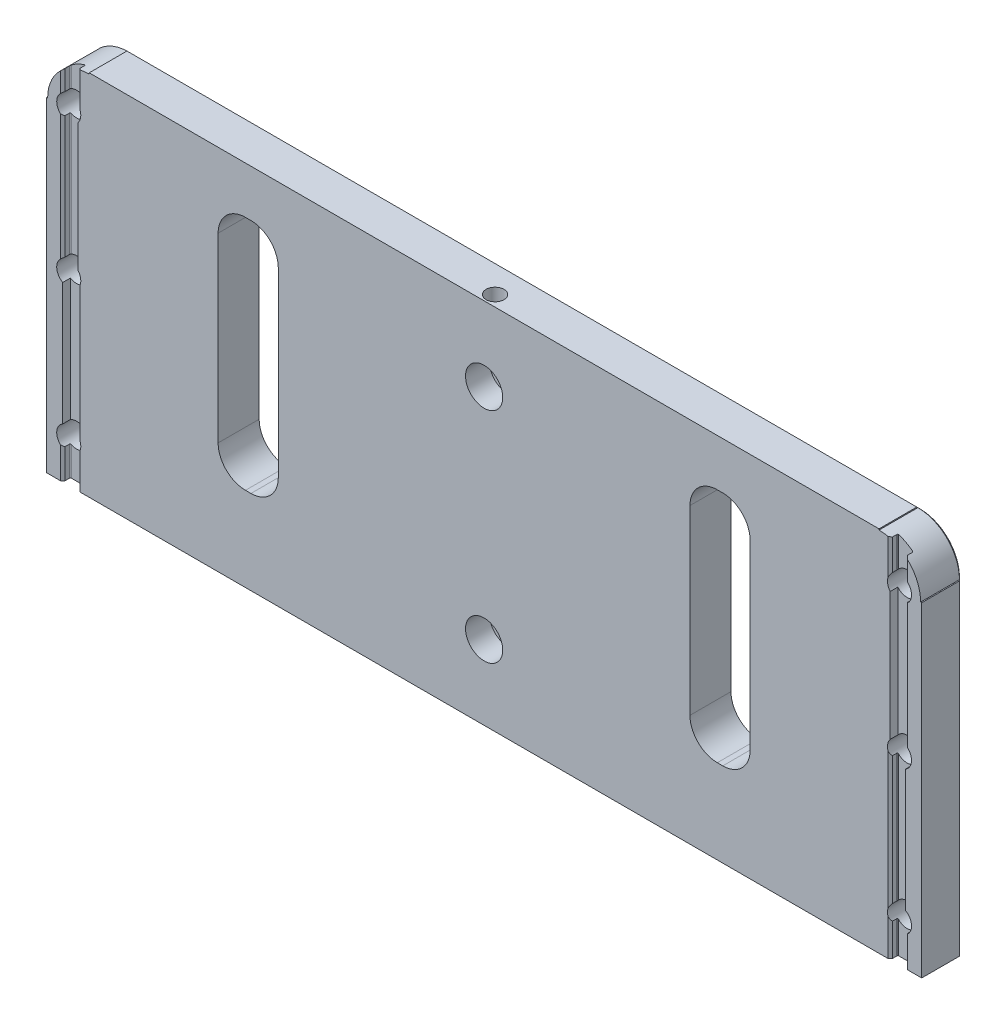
ISO-10303-21;
HEADER;
FILE_DESCRIPTION(('STEP AP214'),'2;1');
FILE_NAME('part.step','',(''),(''),'','','');
FILE_SCHEMA(('AUTOMOTIVE_DESIGN { 1 0 10303 214 1 1 1 1 }'));
ENDSEC;
DATA;
#1=APPLICATION_CONTEXT('core data for automotive mechanical design processes');
#2=APPLICATION_PROTOCOL_DEFINITION('international standard','automotive_design',2000,#1);
#3=PRODUCT_CONTEXT('',#1,'mechanical');
#4=PRODUCT('Part','Part','',(#3));
#5=PRODUCT_RELATED_PRODUCT_CATEGORY('part','',(#4));
#6=PRODUCT_DEFINITION_FORMATION('','',#4);
#7=PRODUCT_DEFINITION_CONTEXT('part definition',#1,'design');
#8=PRODUCT_DEFINITION('design','',#6,#7);
#9=PRODUCT_DEFINITION_SHAPE('','',#8);
#10=(LENGTH_UNIT() NAMED_UNIT(*) SI_UNIT(.MILLI.,.METRE.));
#11=(NAMED_UNIT(*) PLANE_ANGLE_UNIT() SI_UNIT($,.RADIAN.));
#12=(NAMED_UNIT(*) SI_UNIT($,.STERADIAN.) SOLID_ANGLE_UNIT());
#13=UNCERTAINTY_MEASURE_WITH_UNIT(LENGTH_MEASURE(1.E-05),#10,'distance_accuracy_value','');
#14=(GEOMETRIC_REPRESENTATION_CONTEXT(3) GLOBAL_UNCERTAINTY_ASSIGNED_CONTEXT((#13)) GLOBAL_UNIT_ASSIGNED_CONTEXT((#10,
#11,#12)) REPRESENTATION_CONTEXT('',''));
#15=CARTESIAN_POINT('',(0.,0.,0.));
#16=DIRECTION('',(0.,0.,1.));
#17=DIRECTION('',(1.,0.,0.));
#18=AXIS2_PLACEMENT_3D('',#15,#16,#17);
#19=CARTESIAN_POINT('',(-101.5746,-42.672,0.));
#20=DIRECTION('',(0.,0.,1.));
#21=DIRECTION('',(1.,0.,0.));
#22=AXIS2_PLACEMENT_3D('',#19,#20,#21);
#23=PLANE('',#22);
#24=CARTESIAN_POINT('',(91.6686,32.766,0.));
#25=DIRECTION('',(0.,0.,-1.));
#26=DIRECTION('',(-1.,0.,0.));
#27=AXIS2_PLACEMENT_3D('',#24,#25,#26);
#28=CIRCLE('',#27,9.652);
#29=CARTESIAN_POINT('',(98.3234,39.7570472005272,0.));
#30=VERTEX_POINT('',#29);
#31=CARTESIAN_POINT('',(101.3206,32.766,0.));
#32=VERTEX_POINT('',#31);
#33=EDGE_CURVE('E647',#30,#32,#28,.T.);
#34=ORIENTED_EDGE('',*,*,#33,.F.);
#35=DIRECTION('',(0.,-1.,0.));
#36=VECTOR('',#35,1.);
#37=CARTESIAN_POINT('',(98.3234,-42.672,0.));
#38=LINE('',#37,#36);
#39=CARTESIAN_POINT('',(98.3234,35.1908715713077,0.));
#40=VERTEX_POINT('',#39);
#41=EDGE_CURVE('E1343',#30,#40,#38,.T.);
#42=ORIENTED_EDGE('',*,*,#41,.T.);
#43=CARTESIAN_POINT('',(96.4184,33.147,0.));
#44=DIRECTION('',(0.,0.,1.));
#45=DIRECTION('',(1.,0.,0.));
#46=AXIS2_PLACEMENT_3D('',#43,#44,#45);
#47=CIRCLE('',#46,2.794);
#48=CARTESIAN_POINT('',(98.3234,31.1031284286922,0.));
#49=VERTEX_POINT('',#48);
#50=EDGE_CURVE('E1272',#49,#40,#47,.T.);
#51=ORIENTED_EDGE('',*,*,#50,.F.);
#52=DIRECTION('',(0.,-1.,0.));
#53=VECTOR('',#52,1.);
#54=CARTESIAN_POINT('',(98.3234,-42.672,0.));
#55=LINE('',#54,#53);
#56=CARTESIAN_POINT('',(98.3234,1.91687157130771,0.));
#57=VERTEX_POINT('',#56);
#58=EDGE_CURVE('E599',#49,#57,#55,.T.);
#59=ORIENTED_EDGE('',*,*,#58,.T.);
#60=CARTESIAN_POINT('',(96.4184,-0.12700000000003,0.));
#61=DIRECTION('',(0.,0.,1.));
#62=DIRECTION('',(1.,0.,0.));
#63=AXIS2_PLACEMENT_3D('',#60,#61,#62);
#64=CIRCLE('',#63,2.794);
#65=CARTESIAN_POINT('',(97.8154,-2.54667497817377,0.));
#66=VERTEX_POINT('',#65);
#67=EDGE_CURVE('E589',#66,#57,#64,.T.);
#68=ORIENTED_EDGE('',*,*,#67,.F.);
#69=DIRECTION('',(0.,-1.,0.));
#70=VECTOR('',#69,1.);
#71=CARTESIAN_POINT('',(97.8154,61.2700628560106,0.));
#72=LINE('',#71,#70);
#73=CARTESIAN_POINT('',(97.8154,-30.9813250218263,0.));
#74=VERTEX_POINT('',#73);
#75=EDGE_CURVE('E570',#66,#74,#72,.T.);
#76=ORIENTED_EDGE('',*,*,#75,.T.);
#77=CARTESIAN_POINT('',(96.4184,-33.401,0.));
#78=DIRECTION('',(0.,0.,1.));
#79=DIRECTION('',(1.,0.,0.));
#80=AXIS2_PLACEMENT_3D('',#77,#78,#79);
#81=CIRCLE('',#80,2.794);
#82=CARTESIAN_POINT('',(98.3234,-35.4448715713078,0.));
#83=VERTEX_POINT('',#82);
#84=EDGE_CURVE('E1292',#83,#74,#81,.T.);
#85=ORIENTED_EDGE('',*,*,#84,.F.);
#86=DIRECTION('',(0.,-1.,0.));
#87=VECTOR('',#86,1.);
#88=CARTESIAN_POINT('',(98.3234,-42.672,0.));
#89=LINE('',#88,#87);
#90=CARTESIAN_POINT('',(98.3234,-42.672,0.));
#91=VERTEX_POINT('',#90);
#92=EDGE_CURVE('E1340',#83,#91,#89,.T.);
#93=ORIENTED_EDGE('',*,*,#92,.T.);
#94=DIRECTION('',(1.,0.,0.));
#95=VECTOR('',#94,1.);
#96=CARTESIAN_POINT('',(-101.5746,-42.672,0.));
#97=LINE('',#96,#95);
#98=CARTESIAN_POINT('',(101.5746,-42.672,0.));
#99=VERTEX_POINT('',#98);
#100=EDGE_CURVE('E665',#91,#99,#97,.T.);
#101=ORIENTED_EDGE('',*,*,#100,.T.);
#102=DIRECTION('',(0.,1.,0.));
#103=VECTOR('',#102,1.);
#104=CARTESIAN_POINT('',(101.5746,42.672,0.));
#105=LINE('',#104,#103);
#106=CARTESIAN_POINT('',(101.5746,32.766,0.));
#107=VERTEX_POINT('',#106);
#108=EDGE_CURVE('E669',#99,#107,#105,.T.);
#109=ORIENTED_EDGE('',*,*,#108,.T.);
#110=DIRECTION('',(1.,0.,0.));
#111=VECTOR('',#110,1.);
#112=CARTESIAN_POINT('',(101.3206,32.766,0.));
#113=LINE('',#112,#111);
#114=EDGE_CURVE('E651',#32,#107,#113,.T.);
#115=ORIENTED_EDGE('',*,*,#114,.F.);
#116=EDGE_LOOP('',(#34,#42,#51,#59,#68,#76,#85,#93,#101,#109,#115));
#117=FACE_BOUND('',#116,.T.);
#118=ADVANCED_FACE('F37',(#117),#23,.T.);
#119=DIRECTION('',(0.,1.,0.));
#120=VECTOR('',#119,1.);
#121=CARTESIAN_POINT('',(47.7774,25.4,0.));
#122=LINE('',#121,#120);
#123=CARTESIAN_POINT('',(47.7774,-16.764,0.));
#124=VERTEX_POINT('',#123);
#125=CARTESIAN_POINT('',(47.7774,25.4,0.));
#126=VERTEX_POINT('',#125);
#127=EDGE_CURVE('E1185',#124,#126,#122,.T.);
#128=ORIENTED_EDGE('',*,*,#127,.T.);
#129=CARTESIAN_POINT('',(54.1274,25.4,0.));
#130=DIRECTION('',(0.,0.,-1.));
#131=DIRECTION('',(-1.,0.,0.));
#132=AXIS2_PLACEMENT_3D('',#129,#130,#131);
#133=CIRCLE('',#132,6.35);
#134=CARTESIAN_POINT('',(54.1274,31.75,0.));
#135=VERTEX_POINT('',#134);
#136=EDGE_CURVE('E1163',#126,#135,#133,.T.);
#137=ORIENTED_EDGE('',*,*,#136,.T.);
#138=DIRECTION('',(1.,0.,0.));
#139=VECTOR('',#138,1.);
#140=CARTESIAN_POINT('',(55.3974,31.75,0.));
#141=LINE('',#140,#139);
#142=CARTESIAN_POINT('',(55.3974,31.75,0.));
#143=VERTEX_POINT('',#142);
#144=EDGE_CURVE('E1167',#135,#143,#141,.T.);
#145=ORIENTED_EDGE('',*,*,#144,.T.);
#146=CARTESIAN_POINT('',(55.3974,25.4,0.));
#147=DIRECTION('',(0.,0.,-1.));
#148=DIRECTION('',(-1.,0.,0.));
#149=AXIS2_PLACEMENT_3D('',#146,#147,#148);
#150=CIRCLE('',#149,6.35);
#151=CARTESIAN_POINT('',(61.7474,25.4,0.));
#152=VERTEX_POINT('',#151);
#153=EDGE_CURVE('E1200',#143,#152,#150,.T.);
#154=ORIENTED_EDGE('',*,*,#153,.T.);
#155=DIRECTION('',(0.,-1.,0.));
#156=VECTOR('',#155,1.);
#157=CARTESIAN_POINT('',(61.7474,25.4,0.));
#158=LINE('',#157,#156);
#159=CARTESIAN_POINT('',(61.7474,-16.764,0.));
#160=VERTEX_POINT('',#159);
#161=EDGE_CURVE('E1197',#152,#160,#158,.T.);
#162=ORIENTED_EDGE('',*,*,#161,.T.);
#163=CARTESIAN_POINT('',(55.3974,-16.764,0.));
#164=DIRECTION('',(0.,0.,-1.));
#165=DIRECTION('',(-1.,0.,0.));
#166=AXIS2_PLACEMENT_3D('',#163,#164,#165);
#167=CIRCLE('',#166,6.35);
#168=CARTESIAN_POINT('',(55.3974,-23.114,0.));
#169=VERTEX_POINT('',#168);
#170=EDGE_CURVE('E1194',#160,#169,#167,.T.);
#171=ORIENTED_EDGE('',*,*,#170,.T.);
#172=DIRECTION('',(-1.,0.,0.));
#173=VECTOR('',#172,1.);
#174=CARTESIAN_POINT('',(55.3974,-23.114,0.));
#175=LINE('',#174,#173);
#176=CARTESIAN_POINT('',(54.1274,-23.114,0.));
#177=VERTEX_POINT('',#176);
#178=EDGE_CURVE('E1191',#169,#177,#175,.T.);
#179=ORIENTED_EDGE('',*,*,#178,.T.);
#180=CARTESIAN_POINT('',(54.1274,-16.764,0.));
#181=DIRECTION('',(0.,0.,-1.));
#182=DIRECTION('',(-1.,0.,0.));
#183=AXIS2_PLACEMENT_3D('',#180,#181,#182);
#184=CIRCLE('',#183,6.35);
#185=EDGE_CURVE('E1188',#177,#124,#184,.T.);
#186=ORIENTED_EDGE('',*,*,#185,.T.);
#187=EDGE_LOOP('',(#128,#137,#145,#154,#162,#171,#179,#186));
#188=FACE_BOUND('',#187,.T.);
#189=CARTESIAN_POINT('',(-54.1274,25.4,0.));
#190=DIRECTION('',(0.,0.,1.));
#191=DIRECTION('',(1.,0.,0.));
#192=AXIS2_PLACEMENT_3D('',#189,#190,#191);
#193=CIRCLE('',#192,6.35);
#194=CARTESIAN_POINT('',(-47.7774,25.4,0.));
#195=VERTEX_POINT('',#194);
#196=CARTESIAN_POINT('',(-54.1274,31.75,0.));
#197=VERTEX_POINT('',#196);
#198=EDGE_CURVE('E1208',#195,#197,#193,.T.);
#199=ORIENTED_EDGE('',*,*,#198,.F.);
#200=DIRECTION('',(0.,1.,0.));
#201=VECTOR('',#200,1.);
#202=CARTESIAN_POINT('',(-47.7774,25.4,0.));
#203=LINE('',#202,#201);
#204=CARTESIAN_POINT('',(-47.7774,-16.764,0.));
#205=VERTEX_POINT('',#204);
#206=EDGE_CURVE('E1227',#205,#195,#203,.T.);
#207=ORIENTED_EDGE('',*,*,#206,.F.);
#208=CARTESIAN_POINT('',(-54.1274,-16.764,0.));
#209=DIRECTION('',(0.,0.,1.));
#210=DIRECTION('',(1.,0.,0.));
#211=AXIS2_PLACEMENT_3D('',#208,#209,#210);
#212=CIRCLE('',#211,6.35);
#213=CARTESIAN_POINT('',(-54.1274,-23.114,0.));
#214=VERTEX_POINT('',#213);
#215=EDGE_CURVE('E1265',#214,#205,#212,.T.);
#216=ORIENTED_EDGE('',*,*,#215,.F.);
#217=DIRECTION('',(1.,0.,0.));
#218=VECTOR('',#217,1.);
#219=CARTESIAN_POINT('',(-55.3974,-23.114,0.));
#220=LINE('',#219,#218);
#221=CARTESIAN_POINT('',(-55.3974,-23.114,0.));
#222=VERTEX_POINT('',#221);
#223=EDGE_CURVE('E1262',#222,#214,#220,.T.);
#224=ORIENTED_EDGE('',*,*,#223,.F.);
#225=CARTESIAN_POINT('',(-55.3974,-16.764,0.));
#226=DIRECTION('',(0.,0.,1.));
#227=DIRECTION('',(1.,0.,0.));
#228=AXIS2_PLACEMENT_3D('',#225,#226,#227);
#229=CIRCLE('',#228,6.35);
#230=CARTESIAN_POINT('',(-61.7474,-16.764,0.));
#231=VERTEX_POINT('',#230);
#232=EDGE_CURVE('E1259',#231,#222,#229,.T.);
#233=ORIENTED_EDGE('',*,*,#232,.F.);
#234=DIRECTION('',(0.,-1.,0.));
#235=VECTOR('',#234,1.);
#236=CARTESIAN_POINT('',(-61.7474,25.4,0.));
#237=LINE('',#236,#235);
#238=CARTESIAN_POINT('',(-61.7474,25.4,0.));
#239=VERTEX_POINT('',#238);
#240=EDGE_CURVE('E1256',#239,#231,#237,.T.);
#241=ORIENTED_EDGE('',*,*,#240,.F.);
#242=CARTESIAN_POINT('',(-55.3974,25.4,0.));
#243=DIRECTION('',(0.,0.,1.));
#244=DIRECTION('',(1.,0.,0.));
#245=AXIS2_PLACEMENT_3D('',#242,#243,#244);
#246=CIRCLE('',#245,6.35);
#247=CARTESIAN_POINT('',(-55.3974,31.75,0.));
#248=VERTEX_POINT('',#247);
#249=EDGE_CURVE('E1253',#248,#239,#246,.T.);
#250=ORIENTED_EDGE('',*,*,#249,.F.);
#251=DIRECTION('',(-1.,0.,0.));
#252=VECTOR('',#251,1.);
#253=CARTESIAN_POINT('',(-55.3974,31.75,0.));
#254=LINE('',#253,#252);
#255=EDGE_CURVE('E1250',#197,#248,#254,.T.);
#256=ORIENTED_EDGE('',*,*,#255,.F.);
#257=EDGE_LOOP('',(#199,#207,#216,#224,#233,#241,#250,#256));
#258=FACE_BOUND('',#257,.T.);
#259=CARTESIAN_POINT('',(0.,-25.4,0.));
#260=DIRECTION('',(0.,0.,1.));
#261=DIRECTION('',(1.,0.,0.));
#262=AXIS2_PLACEMENT_3D('',#259,#260,#261);
#263=CIRCLE('',#262,4.318);
#264=CARTESIAN_POINT('',(4.318,-25.4,0.));
#265=VERTEX_POINT('',#264);
#266=EDGE_CURVE('E1139',#265,#265,#263,.T.);
#267=ORIENTED_EDGE('',*,*,#266,.F.);
#268=EDGE_LOOP('',(#267));
#269=FACE_BOUND('',#268,.T.);
#270=CARTESIAN_POINT('',(0.,25.4,0.));
#271=DIRECTION('',(0.,0.,1.));
#272=DIRECTION('',(1.,0.,0.));
#273=AXIS2_PLACEMENT_3D('',#270,#271,#272);
#274=CIRCLE('',#273,4.318);
#275=CARTESIAN_POINT('',(4.318,25.4,0.));
#276=VERTEX_POINT('',#275);
#277=EDGE_CURVE('E1146',#276,#276,#274,.T.);
#278=ORIENTED_EDGE('',*,*,#277,.F.);
#279=EDGE_LOOP('',(#278));
#280=FACE_BOUND('',#279,.T.);
#281=CARTESIAN_POINT('',(93.7514,33.9797946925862,0.));
#282=VERTEX_POINT('',#281);
#283=CARTESIAN_POINT('',(94.2594,31.3735415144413,0.));
#284=VERTEX_POINT('',#283);
#285=EDGE_CURVE('E1289',#282,#284,#47,.T.);
#286=ORIENTED_EDGE('',*,*,#285,.F.);
#287=DIRECTION('',(0.,1.,0.));
#288=VECTOR('',#287,1.);
#289=CARTESIAN_POINT('',(93.7514,-42.672,0.));
#290=LINE('',#289,#288);
#291=CARTESIAN_POINT('',(93.7514,42.1905980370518,0.));
#292=VERTEX_POINT('',#291);
#293=EDGE_CURVE('E1319',#282,#292,#290,.T.);
#294=ORIENTED_EDGE('',*,*,#293,.T.);
#295=CARTESIAN_POINT('',(91.6686,42.418,0.));
#296=VERTEX_POINT('',#295);
#297=EDGE_CURVE('E648',#296,#292,#28,.T.);
#298=ORIENTED_EDGE('',*,*,#297,.F.);
#299=DIRECTION('',(0.,-1.,0.));
#300=VECTOR('',#299,1.);
#301=CARTESIAN_POINT('',(91.6686,-42.6720000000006,0.));
#302=LINE('',#301,#300);
#303=CARTESIAN_POINT('',(91.6686,42.672,0.));
#304=VERTEX_POINT('',#303);
#305=EDGE_CURVE('E679',#304,#296,#302,.T.);
#306=ORIENTED_EDGE('',*,*,#305,.F.);
#307=DIRECTION('',(-1.,0.,0.));
#308=VECTOR('',#307,1.);
#309=CARTESIAN_POINT('',(-101.5746,42.672,0.));
#310=LINE('',#309,#308);
#311=CARTESIAN_POINT('',(-91.6686,42.672,0.));
#312=VERTEX_POINT('',#311);
#313=EDGE_CURVE('E673',#304,#312,#310,.T.);
#314=ORIENTED_EDGE('',*,*,#313,.T.);
#315=DIRECTION('',(0.,-1.,0.));
#316=VECTOR('',#315,1.);
#317=CARTESIAN_POINT('',(-91.6686,-42.672,0.));
#318=LINE('',#317,#316);
#319=CARTESIAN_POINT('',(-91.6686,42.418,0.));
#320=VERTEX_POINT('',#319);
#321=EDGE_CURVE('E683',#312,#320,#318,.T.);
#322=ORIENTED_EDGE('',*,*,#321,.T.);
#323=CARTESIAN_POINT('',(-91.6686,32.766,0.));
#324=DIRECTION('',(0.,0.,1.));
#325=DIRECTION('',(1.,0.,0.));
#326=AXIS2_PLACEMENT_3D('',#323,#324,#325);
#327=CIRCLE('',#326,9.652);
#328=CARTESIAN_POINT('',(-93.7514,42.1905980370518,0.));
#329=VERTEX_POINT('',#328);
#330=EDGE_CURVE('E635',#320,#329,#327,.T.);
#331=ORIENTED_EDGE('',*,*,#330,.T.);
#332=DIRECTION('',(0.,-1.,0.));
#333=VECTOR('',#332,1.);
#334=CARTESIAN_POINT('',(-93.7514,34.9204584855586,0.));
#335=LINE('',#334,#333);
#336=CARTESIAN_POINT('',(-93.7514,33.9797946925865,0.));
#337=VERTEX_POINT('',#336);
#338=EDGE_CURVE('E1576',#329,#337,#335,.T.);
#339=ORIENTED_EDGE('',*,*,#338,.T.);
#340=CARTESIAN_POINT('',(-96.4184,33.147,0.));
#341=DIRECTION('',(0.,0.,1.));
#342=DIRECTION('',(1.,0.,0.));
#343=AXIS2_PLACEMENT_3D('',#340,#341,#342);
#344=CIRCLE('',#343,2.794);
#345=CARTESIAN_POINT('',(-94.2594,31.3735415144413,0.));
#346=VERTEX_POINT('',#345);
#347=EDGE_CURVE('E611',#346,#337,#344,.T.);
#348=ORIENTED_EDGE('',*,*,#347,.F.);
#349=DIRECTION('',(0.,1.,0.));
#350=VECTOR('',#349,1.);
#351=CARTESIAN_POINT('',(-94.2594,61.2700628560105,0.));
#352=LINE('',#351,#350);
#353=CARTESIAN_POINT('',(-94.2594,1.64645848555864,0.));
#354=VERTEX_POINT('',#353);
#355=EDGE_CURVE('E1544',#354,#346,#352,.T.);
#356=ORIENTED_EDGE('',*,*,#355,.F.);
#357=CARTESIAN_POINT('',(-96.4184,-0.12700000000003,0.));
#358=DIRECTION('',(0.,0.,1.));
#359=DIRECTION('',(1.,0.,0.));
#360=AXIS2_PLACEMENT_3D('',#357,#358,#359);
#361=CIRCLE('',#360,2.794);
#362=CARTESIAN_POINT('',(-93.7514,-0.959794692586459,0.));
#363=VERTEX_POINT('',#362);
#364=EDGE_CURVE('E625',#363,#354,#361,.T.);
#365=ORIENTED_EDGE('',*,*,#364,.F.);
#366=DIRECTION('',(0.,-1.,0.));
#367=VECTOR('',#366,1.);
#368=CARTESIAN_POINT('',(-93.7514,-31.6275415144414,0.));
#369=LINE('',#368,#367);
#370=CARTESIAN_POINT('',(-93.7514,-32.5682053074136,0.));
#371=VERTEX_POINT('',#370);
#372=EDGE_CURVE('E1321',#363,#371,#369,.T.);
#373=ORIENTED_EDGE('',*,*,#372,.T.);
#374=CARTESIAN_POINT('',(-96.4184,-33.401,0.));
#375=DIRECTION('',(0.,0.,1.));
#376=DIRECTION('',(1.,0.,0.));
#377=AXIS2_PLACEMENT_3D('',#374,#375,#376);
#378=CIRCLE('',#377,2.794);
#379=CARTESIAN_POINT('',(-93.7514,-34.2337946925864,0.));
#380=VERTEX_POINT('',#379);
#381=EDGE_CURVE('E618',#380,#371,#378,.T.);
#382=ORIENTED_EDGE('',*,*,#381,.F.);
#383=DIRECTION('',(0.,-1.,0.));
#384=VECTOR('',#383,1.);
#385=CARTESIAN_POINT('',(-93.7514,-42.672,0.));
#386=LINE('',#385,#384);
#387=CARTESIAN_POINT('',(-93.7514,-42.672,0.));
#388=VERTEX_POINT('',#387);
#389=EDGE_CURVE('E1317',#380,#388,#386,.T.);
#390=ORIENTED_EDGE('',*,*,#389,.T.);
#391=CARTESIAN_POINT('',(93.7514,-42.672,0.));
#392=VERTEX_POINT('',#391);
#393=EDGE_CURVE('E670',#388,#392,#97,.T.);
#394=ORIENTED_EDGE('',*,*,#393,.T.);
#395=DIRECTION('',(0.,1.,0.));
#396=VECTOR('',#395,1.);
#397=CARTESIAN_POINT('',(93.7514,-42.672,0.));
#398=LINE('',#397,#396);
#399=CARTESIAN_POINT('',(93.7514,-34.2337946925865,0.));
#400=VERTEX_POINT('',#399);
#401=EDGE_CURVE('E1312',#392,#400,#398,.T.);
#402=ORIENTED_EDGE('',*,*,#401,.T.);
#403=CARTESIAN_POINT('',(93.7514,-32.5682053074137,0.));
#404=VERTEX_POINT('',#403);
#405=EDGE_CURVE('E605',#404,#400,#81,.T.);
#406=ORIENTED_EDGE('',*,*,#405,.F.);
#407=DIRECTION('',(0.,1.,0.));
#408=VECTOR('',#407,1.);
#409=CARTESIAN_POINT('',(93.7514,-42.672,0.));
#410=LINE('',#409,#408);
#411=CARTESIAN_POINT('',(93.7514,-0.959794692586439,0.));
#412=VERTEX_POINT('',#411);
#413=EDGE_CURVE('E1309',#404,#412,#410,.T.);
#414=ORIENTED_EDGE('',*,*,#413,.T.);
#415=CARTESIAN_POINT('',(94.2594,1.64645848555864,0.));
#416=VERTEX_POINT('',#415);
#417=EDGE_CURVE('E600',#416,#412,#64,.T.);
#418=ORIENTED_EDGE('',*,*,#417,.F.);
#419=DIRECTION('',(0.,1.,0.));
#420=VECTOR('',#419,1.);
#421=CARTESIAN_POINT('',(94.2594,61.2700628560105,0.));
#422=LINE('',#421,#420);
#423=EDGE_CURVE('E581',#416,#284,#422,.T.);
#424=ORIENTED_EDGE('',*,*,#423,.T.);
#425=EDGE_LOOP('',(#286,#294,#298,#306,#314,#322,#331,#339,#348,#356,#365,#373,#382,#390,#394,
#402,#406,#414,#418,#424));
#426=FACE_BOUND('',#425,.T.);
#427=ADVANCED_FACE('F1015',(#188,#258,#269,#280,#426),#23,.T.);
#428=CARTESIAN_POINT('',(-101.5746,-42.672,-9.525));
#429=DIRECTION('',(0.,-1.,0.));
#430=DIRECTION('',(0.,0.,-1.));
#431=AXIS2_PLACEMENT_3D('',#428,#429,#430);
#432=PLANE('',#431);
#433=DIRECTION('',(0.,0.,1.));
#434=VECTOR('',#433,1.);
#435=CARTESIAN_POINT('',(-101.5746,-42.672,-9.525));
#436=LINE('',#435,#434);
#437=CARTESIAN_POINT('',(-101.5746,-42.672,-8.763));
#438=VERTEX_POINT('',#437);
#439=CARTESIAN_POINT('',(-101.5746,-42.672,0.));
#440=VERTEX_POINT('',#439);
#441=EDGE_CURVE('E676',#438,#440,#436,.T.);
#442=ORIENTED_EDGE('',*,*,#441,.F.);
#443=DIRECTION('',(1.,0.,0.));
#444=VECTOR('',#443,1.);
#445=CARTESIAN_POINT('',(101.5746,-42.672,-8.763));
#446=LINE('',#445,#444);
#447=CARTESIAN_POINT('',(101.5746,-42.672,-8.763));
#448=VERTEX_POINT('',#447);
#449=EDGE_CURVE('E1113',#438,#448,#446,.T.);
#450=ORIENTED_EDGE('',*,*,#449,.T.);
#451=DIRECTION('',(0.,0.,1.));
#452=VECTOR('',#451,1.);
#453=CARTESIAN_POINT('',(101.5746,-42.672,-9.525));
#454=LINE('',#453,#452);
#455=EDGE_CURVE('E677',#448,#99,#454,.T.);
#456=ORIENTED_EDGE('',*,*,#455,.T.);
#457=ORIENTED_EDGE('',*,*,#100,.F.);
#458=DIRECTION('',(0.707106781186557,0.,0.707106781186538));
#459=VECTOR('',#458,1.);
#460=CARTESIAN_POINT('',(-6.38810000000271,-42.672,-104.7115));
#461=LINE('',#460,#459);
#462=CARTESIAN_POINT('',(97.8154,-42.672,-0.508000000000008));
#463=VERTEX_POINT('',#462);
#464=EDGE_CURVE('E1353',#91,#463,#461,.F.);
#465=ORIENTED_EDGE('',*,*,#464,.T.);
#466=DIRECTION('',(0.,0.,-1.));
#467=VECTOR('',#466,1.);
#468=CARTESIAN_POINT('',(97.8154,-42.672,-9.525));
#469=LINE('',#468,#467);
#470=CARTESIAN_POINT('',(97.8154,-42.672,-1.5748));
#471=VERTEX_POINT('',#470);
#472=EDGE_CURVE('E1538',#463,#471,#469,.T.);
#473=ORIENTED_EDGE('',*,*,#472,.T.);
#474=CARTESIAN_POINT('',(97.6122,-42.672,-1.5748));
#475=DIRECTION('',(0.,-1.,0.));
#476=DIRECTION('',(0.,0.,-1.));
#477=AXIS2_PLACEMENT_3D('',#474,#475,#476);
#478=CIRCLE('',#477,0.2032);
#479=CARTESIAN_POINT('',(97.6122,-42.672,-1.778));
#480=VERTEX_POINT('',#479);
#481=EDGE_CURVE('E778',#471,#480,#478,.F.);
#482=ORIENTED_EDGE('',*,*,#481,.T.);
#483=DIRECTION('',(-1.,0.,0.));
#484=VECTOR('',#483,1.);
#485=CARTESIAN_POINT('',(-101.5746,-42.672,-1.778));
#486=LINE('',#485,#484);
#487=CARTESIAN_POINT('',(94.4626,-42.672,-1.778));
#488=VERTEX_POINT('',#487);
#489=EDGE_CURVE('E1824',#480,#488,#486,.T.);
#490=ORIENTED_EDGE('',*,*,#489,.T.);
#491=CARTESIAN_POINT('',(94.4626,-42.672,-1.5748));
#492=DIRECTION('',(0.,-1.,0.));
#493=DIRECTION('',(0.,0.,-1.));
#494=AXIS2_PLACEMENT_3D('',#491,#492,#493);
#495=CIRCLE('',#494,0.2032);
#496=CARTESIAN_POINT('',(94.2594,-42.672,-1.5748));
#497=VERTEX_POINT('',#496);
#498=EDGE_CURVE('E889',#488,#497,#495,.F.);
#499=ORIENTED_EDGE('',*,*,#498,.T.);
#500=DIRECTION('',(0.,0.,1.));
#501=VECTOR('',#500,1.);
#502=CARTESIAN_POINT('',(94.2594,-42.672,-9.525));
#503=LINE('',#502,#501);
#504=CARTESIAN_POINT('',(94.2594,-42.672,-0.508000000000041));
#505=VERTEX_POINT('',#504);
#506=EDGE_CURVE('E1520',#497,#505,#503,.T.);
#507=ORIENTED_EDGE('',*,*,#506,.T.);
#508=DIRECTION('',(0.707106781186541,0.,-0.707106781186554));
#509=VECTOR('',#508,1.);
#510=CARTESIAN_POINT('',(0.850900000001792,-42.672,92.9005));
#511=LINE('',#510,#509);
#512=EDGE_CURVE('E1351',#505,#392,#511,.F.);
#513=ORIENTED_EDGE('',*,*,#512,.T.);
#514=ORIENTED_EDGE('',*,*,#393,.F.);
#515=DIRECTION('',(-0.707106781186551,0.,-0.707106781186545));
#516=VECTOR('',#515,1.);
#517=CARTESIAN_POINT('',(-102.4255,-42.672,-8.6741));
#518=LINE('',#517,#516);
#519=CARTESIAN_POINT('',(-94.2594,-42.672,-0.508));
#520=VERTEX_POINT('',#519);
#521=EDGE_CURVE('E1348',#388,#520,#518,.T.);
#522=ORIENTED_EDGE('',*,*,#521,.T.);
#523=DIRECTION('',(0.,0.,1.));
#524=VECTOR('',#523,1.);
#525=CARTESIAN_POINT('',(-94.2594,-42.672,-9.525));
#526=LINE('',#525,#524);
#527=CARTESIAN_POINT('',(-94.2594,-42.672,-1.5748));
#528=VERTEX_POINT('',#527);
#529=EDGE_CURVE('E1427',#528,#520,#526,.T.);
#530=ORIENTED_EDGE('',*,*,#529,.F.);
#531=CARTESIAN_POINT('',(-94.4626,-42.672,-1.5748));
#532=DIRECTION('',(0.,-1.,0.));
#533=DIRECTION('',(0.,0.,-1.));
#534=AXIS2_PLACEMENT_3D('',#531,#532,#533);
#535=CIRCLE('',#534,0.2032);
#536=CARTESIAN_POINT('',(-94.4626,-42.672,-1.778));
#537=VERTEX_POINT('',#536);
#538=EDGE_CURVE('E898',#528,#537,#535,.F.);
#539=ORIENTED_EDGE('',*,*,#538,.T.);
#540=DIRECTION('',(-1.,0.,0.));
#541=VECTOR('',#540,1.);
#542=CARTESIAN_POINT('',(-101.5746,-42.672,-1.778));
#543=LINE('',#542,#541);
#544=CARTESIAN_POINT('',(-97.6122,-42.672,-1.778));
#545=VERTEX_POINT('',#544);
#546=EDGE_CURVE('E1407',#537,#545,#543,.T.);
#547=ORIENTED_EDGE('',*,*,#546,.T.);
#548=CARTESIAN_POINT('',(-97.6122,-42.672,-1.5748));
#549=DIRECTION('',(0.,-1.,0.));
#550=DIRECTION('',(0.,0.,-1.));
#551=AXIS2_PLACEMENT_3D('',#548,#549,#550);
#552=CIRCLE('',#551,0.2032);
#553=CARTESIAN_POINT('',(-97.8154,-42.672,-1.5748));
#554=VERTEX_POINT('',#553);
#555=EDGE_CURVE('E961',#545,#554,#552,.F.);
#556=ORIENTED_EDGE('',*,*,#555,.T.);
#557=DIRECTION('',(0.,0.,-1.));
#558=VECTOR('',#557,1.);
#559=CARTESIAN_POINT('',(-97.8154,-42.672,-9.525));
#560=LINE('',#559,#558);
#561=CARTESIAN_POINT('',(-97.8154,-42.672,-0.507999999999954));
#562=VERTEX_POINT('',#561);
#563=EDGE_CURVE('E1442',#562,#554,#560,.T.);
#564=ORIENTED_EDGE('',*,*,#563,.F.);
#565=DIRECTION('',(-0.707106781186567,0.,0.707106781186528));
#566=VECTOR('',#565,1.);
#567=CARTESIAN_POINT('',(-95.1865,-42.672,-3.13689999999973));
#568=LINE('',#567,#566);
#569=CARTESIAN_POINT('',(-98.3234,-42.672,0.));
#570=VERTEX_POINT('',#569);
#571=EDGE_CURVE('E1043',#562,#570,#568,.T.);
#572=ORIENTED_EDGE('',*,*,#571,.T.);
#573=EDGE_CURVE('E666',#440,#570,#97,.T.);
#574=ORIENTED_EDGE('',*,*,#573,.F.);
#575=EDGE_LOOP('',(#442,#450,#456,#457,#465,#473,#482,#490,#499,#507,#513,#514,#522,#530,#539,
#547,#556,#564,#572,#574));
#576=FACE_BOUND('',#575,.T.);
#577=ADVANCED_FACE('F1020',(#576),#432,.T.);
#578=CARTESIAN_POINT('',(91.6686,32.766,-9.525));
#579=DIRECTION('',(0.,0.,1.));
#580=DIRECTION('',(1.,0.,0.));
#581=AXIS2_PLACEMENT_3D('',#578,#579,#580);
#582=CYLINDRICAL_SURFACE('',#581,9.652);
#583=DIRECTION('',(0.,0.,1.));
#584=VECTOR('',#583,1.);
#585=CARTESIAN_POINT('',(101.3206,32.766,-9.525));
#586=LINE('',#585,#584);
#587=CARTESIAN_POINT('',(101.3206,32.766,-9.017));
#588=VERTEX_POINT('',#587);
#589=EDGE_CURVE('E654',#588,#32,#586,.T.);
#590=ORIENTED_EDGE('',*,*,#589,.F.);
#591=CARTESIAN_POINT('',(91.6686,32.766,-9.0170000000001));
#592=DIRECTION('',(0.,0.,1.));
#593=DIRECTION('',(1.,0.,0.));
#594=AXIS2_PLACEMENT_3D('',#591,#592,#593);
#595=CIRCLE('',#594,9.652);
#596=CARTESIAN_POINT('',(91.6686,42.418,-9.017));
#597=VERTEX_POINT('',#596);
#598=EDGE_CURVE('E12',#588,#597,#595,.T.);
#599=ORIENTED_EDGE('',*,*,#598,.T.);
#600=DIRECTION('',(0.,0.,1.));
#601=VECTOR('',#600,1.);
#602=CARTESIAN_POINT('',(91.6686,42.418,-9.525));
#603=LINE('',#602,#601);
#604=EDGE_CURVE('E653',#597,#296,#603,.T.);
#605=ORIENTED_EDGE('',*,*,#604,.T.);
#606=ORIENTED_EDGE('',*,*,#297,.T.);
#607=CARTESIAN_POINT('',(91.6686,32.766,2.08279999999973));
#608=DIRECTION('',(-0.707106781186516,0.,-0.70710678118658));
#609=DIRECTION('',(-0.70710678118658,0.,0.707106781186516));
#610=AXIS2_PLACEMENT_3D('',#607,#608,#609);
#611=ELLIPSE('',#610,13.6499893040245,9.652);
#612=CARTESIAN_POINT('',(94.2594,42.0637878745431,-0.508000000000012));
#613=VERTEX_POINT('',#612);
#614=EDGE_CURVE('E1329',#292,#613,#611,.T.);
#615=ORIENTED_EDGE('',*,*,#614,.T.);
#616=DIRECTION('',(0.,0.,1.));
#617=VECTOR('',#616,1.);
#618=CARTESIAN_POINT('',(94.2594,42.0637878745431,-9.525));
#619=LINE('',#618,#617);
#620=CARTESIAN_POINT('',(94.2594,42.0637878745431,-1.5748));
#621=VERTEX_POINT('',#620);
#622=EDGE_CURVE('E1525',#621,#613,#619,.T.);
#623=ORIENTED_EDGE('',*,*,#622,.F.);
#624=CARTESIAN_POINT('',(94.2594,42.0637878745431,-1.5748));
#625=CARTESIAN_POINT('',(94.2593889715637,42.0637903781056,-1.58592168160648));
#626=CARTESIAN_POINT('',(94.2603123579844,42.0635336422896,-1.59703818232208));
#627=CARTESIAN_POINT('',(94.2639439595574,42.0625208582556,-1.61893295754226));
#628=CARTESIAN_POINT('',(94.2666490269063,42.0617656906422,-1.62971179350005));
#629=CARTESIAN_POINT('',(94.2737610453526,42.0597749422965,-1.65064627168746));
#630=CARTESIAN_POINT('',(94.2781682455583,42.058539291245,-1.66080182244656));
#631=CARTESIAN_POINT('',(94.2885347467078,42.0556218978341,-1.68021618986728));
#632=CARTESIAN_POINT('',(94.294494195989,42.0539401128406,-1.68947492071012));
#633=CARTESIAN_POINT('',(94.3078769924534,42.0501461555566,-1.70699051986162));
#634=CARTESIAN_POINT('',(94.3153208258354,42.048027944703,-1.71523040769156));
#635=CARTESIAN_POINT('',(94.3313873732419,42.0434316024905,-1.73034809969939));
#636=CARTESIAN_POINT('',(94.3400103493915,42.0409533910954,-1.73722560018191));
#637=CARTESIAN_POINT('',(94.358506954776,42.0356062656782,-1.74968147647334));
#638=CARTESIAN_POINT('',(94.3684138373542,42.0327266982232,-1.75520583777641));
#639=CARTESIAN_POINT('',(94.3889441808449,42.0267205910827,-1.76451580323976));
#640=CARTESIAN_POINT('',(94.3995676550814,42.0235940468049,-1.76830137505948));
#641=CARTESIAN_POINT('',(94.4189353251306,42.0178559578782,-1.77344955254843));
#642=CARTESIAN_POINT('',(94.4275994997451,42.0152760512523,-1.77515598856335));
#643=CARTESIAN_POINT('',(94.4450432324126,42.0100549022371,-1.77743122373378));
#644=CARTESIAN_POINT('',(94.4538225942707,42.0074137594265,-1.77800175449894));
#645=CARTESIAN_POINT('',(94.4626,42.0047590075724,-1.778));
#646=B_SPLINE_CURVE_WITH_KNOTS('',3,(#624,#625,#626,#627,#628,#629,#630,#631,#632,#633,#634,
#635,#636,#637,#638,#639,#640,#641,#642,#643,#644,#645),.UNSPECIFIED.,.F.,.F.,(4,2,2,2,2,2,2,2,
2,2,4),(0.,0.0333159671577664,0.0665732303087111,0.0998353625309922,0.133100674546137,
0.16686156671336,0.200629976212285,0.235582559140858,0.270535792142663,0.298066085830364,
0.325554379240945),.UNSPECIFIED.);
#647=CARTESIAN_POINT('',(94.4626,42.0047590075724,-1.778));
#648=VERTEX_POINT('',#647);
#649=EDGE_CURVE('E850',#621,#648,#646,.T.);
#650=ORIENTED_EDGE('',*,*,#649,.T.);
#651=CARTESIAN_POINT('',(91.6686,32.766,-1.778));
#652=DIRECTION('',(0.,0.,1.));
#653=DIRECTION('',(1.,0.,0.));
#654=AXIS2_PLACEMENT_3D('',#651,#652,#653);
#655=CIRCLE('',#654,9.652);
#656=CARTESIAN_POINT('',(97.6122,40.3709144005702,-1.778));
#657=VERTEX_POINT('',#656);
#658=EDGE_CURVE('E1821',#657,#648,#655,.T.);
#659=ORIENTED_EDGE('',*,*,#658,.F.);
#660=CARTESIAN_POINT('',(97.6122,40.3709144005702,-1.778));
#661=CARTESIAN_POINT('',(97.6257198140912,40.3603502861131,-1.77799116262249));
#662=CARTESIAN_POINT('',(97.6392260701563,40.3497342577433,-1.77664930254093));
#663=CARTESIAN_POINT('',(97.6659259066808,40.3286363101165,-1.77124719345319));
#664=CARTESIAN_POINT('',(97.6791170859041,40.3181555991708,-1.76717046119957));
#665=CARTESIAN_POINT('',(97.7031630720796,40.2989517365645,-1.75691287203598));
#666=CARTESIAN_POINT('',(97.7141064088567,40.290170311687,-1.75104999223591));
#667=CARTESIAN_POINT('',(97.7350629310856,40.2732838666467,-1.73713486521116));
#668=CARTESIAN_POINT('',(97.7450782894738,40.2651772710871,-1.72908791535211));
#669=CARTESIAN_POINT('',(97.7617091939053,40.2516671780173,-1.71279031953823));
#670=CARTESIAN_POINT('',(97.7685874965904,40.2460617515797,-1.7049756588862));
#671=CARTESIAN_POINT('',(97.7812698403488,40.2357013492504,-1.68801391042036));
#672=CARTESIAN_POINT('',(97.787074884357,40.2309455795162,-1.67886808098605));
#673=CARTESIAN_POINT('',(97.7964215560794,40.2232741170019,-1.66103228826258));
#674=CARTESIAN_POINT('',(97.8001805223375,40.2201828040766,-1.65253218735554));
#675=CARTESIAN_POINT('',(97.806551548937,40.2149376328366,-1.63484716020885));
#676=CARTESIAN_POINT('',(97.8091657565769,40.2127820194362,-1.62566355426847));
#677=CARTESIAN_POINT('',(97.8125315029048,40.2100051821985,-1.60951253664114));
#678=CARTESIAN_POINT('',(97.8136009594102,40.2091222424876,-1.60265463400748));
#679=CARTESIAN_POINT('',(97.815038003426,40.2079355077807,-1.58880015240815));
#680=CARTESIAN_POINT('',(97.8154039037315,40.2076331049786,-1.58180328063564));
#681=CARTESIAN_POINT('',(97.8154,40.2076364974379,-1.5748));
#682=B_SPLINE_CURVE_WITH_KNOTS('',3,(#660,#661,#662,#663,#664,#665,#666,#667,#668,#669,#670,
#671,#672,#673,#674,#675,#676,#677,#678,#679,#680,#681),.UNSPECIFIED.,.F.,.F.,(4,2,2,2,2,2,2,2,
2,2,4),(0.,0.0514588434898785,0.103230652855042,0.14867634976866,0.194012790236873,
0.229354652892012,0.264663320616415,0.293929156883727,0.323139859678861,0.344072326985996,
0.365054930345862),.UNSPECIFIED.);
#683=CARTESIAN_POINT('',(97.8154,40.2076364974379,-1.5748));
#684=VERTEX_POINT('',#683);
#685=EDGE_CURVE('E1883',#657,#684,#682,.T.);
#686=ORIENTED_EDGE('',*,*,#685,.T.);
#687=DIRECTION('',(0.,0.,1.));
#688=VECTOR('',#687,1.);
#689=CARTESIAN_POINT('',(97.8154,40.2076364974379,-9.525));
#690=LINE('',#689,#688);
#691=CARTESIAN_POINT('',(97.8154,40.2076364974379,-0.50800000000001));
#692=VERTEX_POINT('',#691);
#693=EDGE_CURVE('E592',#692,#684,#690,.F.);
#694=ORIENTED_EDGE('',*,*,#693,.F.);
#695=CARTESIAN_POINT('',(91.6686,32.766,-6.65479999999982));
#696=DIRECTION('',(0.707106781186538,0.,-0.707106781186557));
#697=DIRECTION('',(0.707106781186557,0.,0.707106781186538));
#698=AXIS2_PLACEMENT_3D('',#695,#696,#697);
#699=ELLIPSE('',#698,13.6499893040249,9.652);
#700=EDGE_CURVE('E1327',#692,#30,#699,.T.);
#701=ORIENTED_EDGE('',*,*,#700,.T.);
#702=ORIENTED_EDGE('',*,*,#33,.T.);
#703=EDGE_LOOP('',(#590,#599,#605,#606,#615,#623,#650,#659,#686,#694,#701,#702));
#704=FACE_BOUND('',#703,.T.);
#705=ADVANCED_FACE('F1640',(#704),#582,.T.);
#706=CARTESIAN_POINT('',(96.4184,-0.12700000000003,0.));
#707=DIRECTION('',(0.,0.,1.));
#708=DIRECTION('',(1.,0.,0.));
#709=AXIS2_PLACEMENT_3D('',#706,#707,#708);
#710=CYLINDRICAL_SURFACE('',#709,2.794);
#711=CARTESIAN_POINT('',(96.4184,-0.12700000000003,-9.525));
#712=DIRECTION('',(0.,0.,1.));
#713=DIRECTION('',(1.,0.,0.));
#714=AXIS2_PLACEMENT_3D('',#711,#712,#713);
#715=CIRCLE('',#714,2.794);
#716=CARTESIAN_POINT('',(99.2124,-0.12700000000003,-9.525));
#717=VERTEX_POINT('',#716);
#718=EDGE_CURVE('E603',#717,#717,#715,.T.);
#719=ORIENTED_EDGE('',*,*,#718,.F.);
#720=EDGE_LOOP('',(#719));
#721=FACE_BOUND('',#720,.T.);
#722=ORIENTED_EDGE('',*,*,#417,.T.);
#723=CARTESIAN_POINT('',(96.4184,-0.12700000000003,-2.66700000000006));
#724=DIRECTION('',(-0.707106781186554,0.,-0.707106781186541));
#725=DIRECTION('',(-0.707106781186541,0.,0.707106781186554));
#726=AXIS2_PLACEMENT_3D('',#723,#724,#725);
#727=ELLIPSE('',#726,3.95131269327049,2.794);
#728=CARTESIAN_POINT('',(94.2594,-1.90045848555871,-0.508000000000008));
#729=VERTEX_POINT('',#728);
#730=EDGE_CURVE('E1316',#412,#729,#727,.F.);
#731=ORIENTED_EDGE('',*,*,#730,.T.);
#732=DIRECTION('',(0.,0.,1.));
#733=VECTOR('',#732,1.);
#734=CARTESIAN_POINT('',(94.2594,-1.90045848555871,0.));
#735=LINE('',#734,#733);
#736=CARTESIAN_POINT('',(94.2594,-1.90045848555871,-1.5748));
#737=VERTEX_POINT('',#736);
#738=EDGE_CURVE('E1829',#737,#729,#735,.T.);
#739=ORIENTED_EDGE('',*,*,#738,.F.);
#740=CARTESIAN_POINT('',(94.2594,-1.90045848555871,-1.5748));
#741=CARTESIAN_POINT('',(94.2593841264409,-1.90043711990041,-1.58350103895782));
#742=CARTESIAN_POINT('',(94.2599577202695,-1.90113756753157,-1.59216852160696));
#743=CARTESIAN_POINT('',(94.2621372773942,-1.90378691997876,-1.60907805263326));
#744=CARTESIAN_POINT('',(94.2637312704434,-1.90572134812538,-1.61732385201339));
#745=CARTESIAN_POINT('',(94.267801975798,-1.91064053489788,-1.63320900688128));
#746=CARTESIAN_POINT('',(94.2702747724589,-1.91362063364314,-1.64085087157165));
#747=CARTESIAN_POINT('',(94.2759414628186,-1.92041218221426,-1.65548789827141));
#748=CARTESIAN_POINT('',(94.2791375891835,-1.92422620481,-1.66248096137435));
#749=CARTESIAN_POINT('',(94.287966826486,-1.93469424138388,-1.67932927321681));
#750=CARTESIAN_POINT('',(94.293988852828,-1.94177590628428,-1.68871391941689));
#751=CARTESIAN_POINT('',(94.306990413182,-1.95688686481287,-1.70592052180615));
#752=CARTESIAN_POINT('',(94.3139721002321,-1.96491828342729,-1.7137388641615));
#753=CARTESIAN_POINT('',(94.3320684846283,-1.98547256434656,-1.7312487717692));
#754=CARTESIAN_POINT('',(94.3435910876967,-1.99834189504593,-1.7401109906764));
#755=CARTESIAN_POINT('',(94.3676790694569,-2.0247093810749,-1.75502479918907));
#756=CARTESIAN_POINT('',(94.3802459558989,-2.03820843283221,-1.76107223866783));
#757=CARTESIAN_POINT('',(94.4043448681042,-2.06356386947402,-1.76983280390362));
#758=CARTESIAN_POINT('',(94.4157833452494,-2.07539239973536,-1.7728888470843));
#759=CARTESIAN_POINT('',(94.4389792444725,-2.09895478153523,-1.77696051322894));
#760=CARTESIAN_POINT('',(94.4507345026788,-2.11068879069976,-1.77798755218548));
#761=CARTESIAN_POINT('',(94.4626,-2.12231510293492,-1.778));
#762=B_SPLINE_CURVE_WITH_KNOTS('',3,(#740,#741,#742,#743,#744,#745,#746,#747,#748,#749,#750,
#751,#752,#753,#754,#755,#756,#757,#758,#759,#760,#761),.UNSPECIFIED.,.F.,.F.,(4,2,2,2,2,2,2,2,
2,2,4),(0.,0.0260029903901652,0.051706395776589,0.0772966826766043,0.102967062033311,
0.14237266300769,0.181868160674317,0.239801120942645,0.297819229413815,0.347901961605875,
0.397702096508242),.UNSPECIFIED.);
#763=CARTESIAN_POINT('',(94.4626,-2.12231510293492,-1.778));
#764=VERTEX_POINT('',#763);
#765=EDGE_CURVE('E849',#737,#764,#762,.T.);
#766=ORIENTED_EDGE('',*,*,#765,.T.);
#767=CARTESIAN_POINT('',(96.4184,-0.12700000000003,-1.778));
#768=DIRECTION('',(0.,0.,1.));
#769=DIRECTION('',(1.,0.,0.));
#770=AXIS2_PLACEMENT_3D('',#767,#768,#769);
#771=CIRCLE('',#770,2.794);
#772=CARTESIAN_POINT('',(97.8154,-2.54667497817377,-1.778));
#773=VERTEX_POINT('',#772);
#774=EDGE_CURVE('E591',#773,#764,#771,.F.);
#775=ORIENTED_EDGE('',*,*,#774,.F.);
#776=DIRECTION('',(0.,0.,1.));
#777=VECTOR('',#776,1.);
#778=CARTESIAN_POINT('',(97.8154,-2.54667497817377,0.));
#779=LINE('',#778,#777);
#780=EDGE_CURVE('E574',#66,#773,#779,.F.);
#781=ORIENTED_EDGE('',*,*,#780,.F.);
#782=ORIENTED_EDGE('',*,*,#67,.T.);
#783=CARTESIAN_POINT('',(96.4184,-0.12700000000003,-1.905));
#784=DIRECTION('',(0.707106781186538,0.,-0.707106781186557));
#785=DIRECTION('',(0.707106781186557,0.,0.707106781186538));
#786=AXIS2_PLACEMENT_3D('',#783,#784,#785);
#787=ELLIPSE('',#786,3.9513126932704,2.794);
#788=CARTESIAN_POINT('',(97.8154,2.29267497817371,-0.508000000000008));
#789=VERTEX_POINT('',#788);
#790=EDGE_CURVE('E1363',#57,#789,#787,.F.);
#791=ORIENTED_EDGE('',*,*,#790,.T.);
#792=DIRECTION('',(0.,0.,1.));
#793=VECTOR('',#792,1.);
#794=CARTESIAN_POINT('',(97.8154,2.29267497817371,0.));
#795=LINE('',#794,#793);
#796=CARTESIAN_POINT('',(97.8154,2.29267497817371,-1.5748));
#797=VERTEX_POINT('',#796);
#798=EDGE_CURVE('E593',#797,#789,#795,.T.);
#799=ORIENTED_EDGE('',*,*,#798,.F.);
#800=CARTESIAN_POINT('',(97.8154,2.29267497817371,-1.5748));
#801=CARTESIAN_POINT('',(97.8154133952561,2.29266530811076,-1.58519090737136));
#802=CARTESIAN_POINT('',(97.8146039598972,2.29313458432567,-1.59556871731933));
#803=CARTESIAN_POINT('',(97.8114496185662,2.29495261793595,-1.61596172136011));
#804=CARTESIAN_POINT('',(97.8091118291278,2.29629729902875,-1.62597837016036));
#805=CARTESIAN_POINT('',(97.8030123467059,2.29978720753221,-1.64540390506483));
#806=CARTESIAN_POINT('',(97.7992521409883,2.30193159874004,-1.65481341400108));
#807=CARTESIAN_POINT('',(97.7904698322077,2.30690343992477,-1.67283381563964));
#808=CARTESIAN_POINT('',(97.7854465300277,2.30973153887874,-1.68144393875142));
#809=CARTESIAN_POINT('',(97.7739970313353,2.31612052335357,-1.69817148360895));
#810=CARTESIAN_POINT('',(97.7675070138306,2.31971407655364,-1.70623253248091));
#811=CARTESIAN_POINT('',(97.7535217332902,2.32737356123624,-1.72116657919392));
#812=CARTESIAN_POINT('',(97.7460261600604,2.33143963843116,-1.72803920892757));
#813=CARTESIAN_POINT('',(97.7292182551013,2.34044670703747,-1.74131015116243));
#814=CARTESIAN_POINT('',(97.7197960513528,2.34543330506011,-1.74753843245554));
#815=CARTESIAN_POINT('',(97.7001631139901,2.35566838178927,-1.75831649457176));
#816=CARTESIAN_POINT('',(97.6899518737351,2.3609170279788,-1.7628651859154));
#817=CARTESIAN_POINT('',(97.6686656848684,2.37168304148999,-1.77033188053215));
#818=CARTESIAN_POINT('',(97.6575741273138,2.37720376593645,-1.77319770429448));
#819=CARTESIAN_POINT('',(97.6350683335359,2.38821669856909,-1.77703170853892));
#820=CARTESIAN_POINT('',(97.6236544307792,2.3937089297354,-1.77800178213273));
#821=CARTESIAN_POINT('',(97.6122,2.3991190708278,-1.778));
#822=B_SPLINE_CURVE_WITH_KNOTS('',3,(#800,#801,#802,#803,#804,#805,#806,#807,#808,#809,#810,
#811,#812,#813,#814,#815,#816,#817,#818,#819,#820,#821),.UNSPECIFIED.,.F.,.F.,(4,2,2,2,2,2,2,2,
2,2,4),(0.,0.0311100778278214,0.0620763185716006,0.0930102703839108,0.123973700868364,
0.156708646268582,0.18945371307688,0.226341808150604,0.263253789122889,0.301256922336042,
0.339222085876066),.UNSPECIFIED.);
#823=CARTESIAN_POINT('',(97.6122,2.3991190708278,-1.778));
#824=VERTEX_POINT('',#823);
#825=EDGE_CURVE('E789',#797,#824,#822,.T.);
#826=ORIENTED_EDGE('',*,*,#825,.T.);
#827=CARTESIAN_POINT('',(94.2594,1.64645848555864,-1.778));
#828=VERTEX_POINT('',#827);
#829=EDGE_CURVE('E1819',#828,#824,#771,.F.);
#830=ORIENTED_EDGE('',*,*,#829,.F.);
#831=DIRECTION('',(0.,0.,1.));
#832=VECTOR('',#831,1.);
#833=CARTESIAN_POINT('',(94.2594,1.64645848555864,0.));
#834=LINE('',#833,#832);
#835=EDGE_CURVE('E1530',#416,#828,#834,.F.);
#836=ORIENTED_EDGE('',*,*,#835,.F.);
#837=EDGE_LOOP('',(#722,#731,#739,#766,#775,#781,#782,#791,#799,#826,#830,#836));
#838=FACE_BOUND('',#837,.T.);
#839=ADVANCED_FACE('F588',(#721,#838),#710,.F.);
#840=CARTESIAN_POINT('',(96.4184,-33.401,0.));
#841=DIRECTION('',(0.,0.,1.));
#842=DIRECTION('',(1.,0.,0.));
#843=AXIS2_PLACEMENT_3D('',#840,#841,#842);
#844=CYLINDRICAL_SURFACE('',#843,2.794);
#845=CARTESIAN_POINT('',(96.4184,-33.401,-9.525));
#846=DIRECTION('',(0.,0.,1.));
#847=DIRECTION('',(1.,0.,0.));
#848=AXIS2_PLACEMENT_3D('',#845,#846,#847);
#849=CIRCLE('',#848,2.794);
#850=CARTESIAN_POINT('',(99.2124,-33.401,-9.525));
#851=VERTEX_POINT('',#850);
#852=EDGE_CURVE('E601',#851,#851,#849,.T.);
#853=ORIENTED_EDGE('',*,*,#852,.F.);
#854=EDGE_LOOP('',(#853));
#855=FACE_BOUND('',#854,.T.);
#856=DIRECTION('',(0.,0.,1.));
#857=VECTOR('',#856,1.);
#858=CARTESIAN_POINT('',(97.8154,-35.8206749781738,0.));
#859=LINE('',#858,#857);
#860=CARTESIAN_POINT('',(97.8154,-35.8206749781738,-0.508000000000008));
#861=VERTEX_POINT('',#860);
#862=CARTESIAN_POINT('',(97.8154,-35.8206749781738,-1.5748));
#863=VERTEX_POINT('',#862);
#864=EDGE_CURVE('E1527',#861,#863,#859,.F.);
#865=ORIENTED_EDGE('',*,*,#864,.F.);
#866=CARTESIAN_POINT('',(96.4184,-33.401,-1.905));
#867=DIRECTION('',(0.707106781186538,0.,-0.707106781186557));
#868=DIRECTION('',(0.707106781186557,0.,0.707106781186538));
#869=AXIS2_PLACEMENT_3D('',#866,#867,#868);
#870=ELLIPSE('',#869,3.9513126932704,2.794);
#871=EDGE_CURVE('E1359',#861,#83,#870,.F.);
#872=ORIENTED_EDGE('',*,*,#871,.T.);
#873=ORIENTED_EDGE('',*,*,#84,.T.);
#874=DIRECTION('',(0.,0.,1.));
#875=VECTOR('',#874,1.);
#876=CARTESIAN_POINT('',(97.8154,-30.9813250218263,0.));
#877=LINE('',#876,#875);
#878=CARTESIAN_POINT('',(97.8154,-30.9813250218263,-1.778));
#879=VERTEX_POINT('',#878);
#880=EDGE_CURVE('E577',#879,#74,#877,.T.);
#881=ORIENTED_EDGE('',*,*,#880,.F.);
#882=CARTESIAN_POINT('',(96.4184,-33.401,-1.778));
#883=DIRECTION('',(0.,0.,1.));
#884=DIRECTION('',(1.,0.,0.));
#885=AXIS2_PLACEMENT_3D('',#882,#883,#884);
#886=CIRCLE('',#885,2.794);
#887=CARTESIAN_POINT('',(94.4626,-31.4056848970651,-1.778));
#888=VERTEX_POINT('',#887);
#889=EDGE_CURVE('E1811',#888,#879,#886,.F.);
#890=ORIENTED_EDGE('',*,*,#889,.F.);
#891=CARTESIAN_POINT('',(94.4626,-31.4056848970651,-1.778));
#892=CARTESIAN_POINT('',(94.4464935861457,-31.4214558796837,-1.77795719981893));
#893=CARTESIAN_POINT('',(94.4305726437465,-31.4374593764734,-1.77608135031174));
#894=CARTESIAN_POINT('',(94.3993983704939,-31.4695354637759,-1.76860409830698));
#895=CARTESIAN_POINT('',(94.3841525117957,-31.485607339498,-1.76296864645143));
#896=CARTESIAN_POINT('',(94.3585100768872,-31.5132613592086,-1.74975360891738));
#897=CARTESIAN_POINT('',(94.3478394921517,-31.5249801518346,-1.74298668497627));
#898=CARTESIAN_POINT('',(94.3275064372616,-31.5476708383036,-1.72713461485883));
#899=CARTESIAN_POINT('',(94.3178407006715,-31.5586451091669,-1.71805733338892));
#900=CARTESIAN_POINT('',(94.3030040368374,-31.5757281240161,-1.70089568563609));
#901=CARTESIAN_POINT('',(94.2974283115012,-31.5822149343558,-1.69353808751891));
#902=CARTESIAN_POINT('',(94.2870876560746,-31.5943437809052,-1.67763661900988));
#903=CARTESIAN_POINT('',(94.2823218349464,-31.5999867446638,-1.66909407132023));
#904=CARTESIAN_POINT('',(94.2748625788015,-31.6088758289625,-1.65293254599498));
#905=CARTESIAN_POINT('',(94.2719447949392,-31.6123744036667,-1.64555751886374));
#906=CARTESIAN_POINT('',(94.2669251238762,-31.618415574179,-1.63017744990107));
#907=CARTESIAN_POINT('',(94.2648208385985,-31.6209609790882,-1.62217434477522));
#908=CARTESIAN_POINT('',(94.2619660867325,-31.6244210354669,-1.6076249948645));
#909=CARTESIAN_POINT('',(94.2610140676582,-31.6255778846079,-1.60117594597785));
#910=CARTESIAN_POINT('',(94.2597262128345,-31.6271443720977,-1.58808895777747));
#911=CARTESIAN_POINT('',(94.2593941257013,-31.627549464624,-1.58145011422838));
#912=CARTESIAN_POINT('',(94.2594,-31.6275415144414,-1.5748));
#913=B_SPLINE_CURVE_WITH_KNOTS('',3,(#891,#892,#893,#894,#895,#896,#897,#898,#899,#900,#901,
#902,#903,#904,#905,#906,#907,#908,#909,#910,#911,#912),.UNSPECIFIED.,.F.,.F.,(4,2,2,2,2,2,2,2,
2,2,4),(0.,0.0676107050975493,0.135842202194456,0.187384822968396,0.23875428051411,
0.272509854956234,0.306228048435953,0.332141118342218,0.357977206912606,0.377768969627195,
0.397680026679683),.UNSPECIFIED.);
#914=CARTESIAN_POINT('',(94.2594,-31.6275415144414,-1.5748));
#915=VERTEX_POINT('',#914);
#916=EDGE_CURVE('E876',#888,#915,#913,.T.);
#917=ORIENTED_EDGE('',*,*,#916,.T.);
#918=DIRECTION('',(0.,0.,1.));
#919=VECTOR('',#918,1.);
#920=CARTESIAN_POINT('',(94.2594,-31.6275415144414,0.));
#921=LINE('',#920,#919);
#922=CARTESIAN_POINT('',(94.2594,-31.6275415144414,-0.508));
#923=VERTEX_POINT('',#922);
#924=EDGE_CURVE('E1827',#923,#915,#921,.F.);
#925=ORIENTED_EDGE('',*,*,#924,.F.);
#926=CARTESIAN_POINT('',(96.4184,-33.401,-2.66700000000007));
#927=DIRECTION('',(-0.707106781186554,0.,-0.707106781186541));
#928=DIRECTION('',(-0.707106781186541,0.,0.707106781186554));
#929=AXIS2_PLACEMENT_3D('',#926,#927,#928);
#930=ELLIPSE('',#929,3.95131269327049,2.794);
#931=EDGE_CURVE('E1302',#923,#404,#930,.F.);
#932=ORIENTED_EDGE('',*,*,#931,.T.);
#933=ORIENTED_EDGE('',*,*,#405,.T.);
#934=CARTESIAN_POINT('',(96.4184,-33.401,-2.66700000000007));
#935=DIRECTION('',(-0.707106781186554,0.,-0.707106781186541));
#936=DIRECTION('',(-0.707106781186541,0.,0.707106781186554));
#937=AXIS2_PLACEMENT_3D('',#934,#935,#936);
#938=ELLIPSE('',#937,3.95131269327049,2.794);
#939=CARTESIAN_POINT('',(94.2594,-35.1744584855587,-0.508000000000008));
#940=VERTEX_POINT('',#939);
#941=EDGE_CURVE('E1298',#400,#940,#938,.F.);
#942=ORIENTED_EDGE('',*,*,#941,.T.);
#943=DIRECTION('',(0.,0.,1.));
#944=VECTOR('',#943,1.);
#945=CARTESIAN_POINT('',(94.2594,-35.1744584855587,0.));
#946=LINE('',#945,#944);
#947=CARTESIAN_POINT('',(94.2594,-35.1744584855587,-1.5748));
#948=VERTEX_POINT('',#947);
#949=EDGE_CURVE('E1522',#948,#940,#946,.T.);
#950=ORIENTED_EDGE('',*,*,#949,.F.);
#951=CARTESIAN_POINT('',(94.2594,-35.1744584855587,-1.5748));
#952=CARTESIAN_POINT('',(94.2593841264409,-35.1744371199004,-1.58350103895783));
#953=CARTESIAN_POINT('',(94.2599577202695,-35.1751375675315,-1.59216852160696));
#954=CARTESIAN_POINT('',(94.2621372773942,-35.1777869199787,-1.60907805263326));
#955=CARTESIAN_POINT('',(94.2637312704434,-35.1797213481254,-1.61732385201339));
#956=CARTESIAN_POINT('',(94.267801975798,-35.1846405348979,-1.63320900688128));
#957=CARTESIAN_POINT('',(94.2702747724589,-35.1876206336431,-1.64085087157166));
#958=CARTESIAN_POINT('',(94.2759414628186,-35.1944121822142,-1.65548789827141));
#959=CARTESIAN_POINT('',(94.2791375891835,-35.19822620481,-1.66248096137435));
#960=CARTESIAN_POINT('',(94.287966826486,-35.2086942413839,-1.67932927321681));
#961=CARTESIAN_POINT('',(94.293988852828,-35.2157759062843,-1.68871391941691));
#962=CARTESIAN_POINT('',(94.306990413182,-35.2308868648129,-1.70592052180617));
#963=CARTESIAN_POINT('',(94.3139721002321,-35.2389182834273,-1.71373886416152));
#964=CARTESIAN_POINT('',(94.3320684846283,-35.2594725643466,-1.7312487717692));
#965=CARTESIAN_POINT('',(94.3435910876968,-35.2723418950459,-1.74011099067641));
#966=CARTESIAN_POINT('',(94.367679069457,-35.2987093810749,-1.75502479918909));
#967=CARTESIAN_POINT('',(94.3802459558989,-35.3122084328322,-1.76107223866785));
#968=CARTESIAN_POINT('',(94.4043448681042,-35.337563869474,-1.76983280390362));
#969=CARTESIAN_POINT('',(94.4157833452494,-35.3493923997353,-1.7728888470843));
#970=CARTESIAN_POINT('',(94.4389792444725,-35.3729547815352,-1.77696051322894));
#971=CARTESIAN_POINT('',(94.4507345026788,-35.3846887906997,-1.77798755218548));
#972=CARTESIAN_POINT('',(94.4626,-35.3963151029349,-1.778));
#973=B_SPLINE_CURVE_WITH_KNOTS('',3,(#951,#952,#953,#954,#955,#956,#957,#958,#959,#960,#961,
#962,#963,#964,#965,#966,#967,#968,#969,#970,#971,#972),.UNSPECIFIED.,.F.,.F.,(4,2,2,2,2,2,2,2,
2,2,4),(0.,0.0260029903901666,0.0517063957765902,0.0772966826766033,0.102967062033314,
0.142372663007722,0.181868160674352,0.239801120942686,0.297819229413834,0.347901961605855,
0.397702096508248),.UNSPECIFIED.);
#974=CARTESIAN_POINT('',(94.4626,-35.3963151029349,-1.778));
#975=VERTEX_POINT('',#974);
#976=EDGE_CURVE('E883',#948,#975,#973,.T.);
#977=ORIENTED_EDGE('',*,*,#976,.T.);
#978=CARTESIAN_POINT('',(97.6122,-35.9271190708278,-1.778));
#979=VERTEX_POINT('',#978);
#980=EDGE_CURVE('E1814',#979,#975,#886,.F.);
#981=ORIENTED_EDGE('',*,*,#980,.F.);
#982=CARTESIAN_POINT('',(97.6122,-35.9271190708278,-1.778));
#983=CARTESIAN_POINT('',(97.6248477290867,-35.9211464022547,-1.77800226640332));
#984=CARTESIAN_POINT('',(97.6374448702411,-35.9150727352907,-1.77681944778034));
#985=CARTESIAN_POINT('',(97.6622225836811,-35.9029045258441,-1.77214976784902));
#986=CARTESIAN_POINT('',(97.6744023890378,-35.8968099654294,-1.76865888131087));
#987=CARTESIAN_POINT('',(97.6979910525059,-35.8847994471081,-1.75943669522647));
#988=CARTESIAN_POINT('',(97.7093994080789,-35.8788836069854,-1.75370395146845));
#989=CARTESIAN_POINT('',(97.7310843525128,-35.8674641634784,-1.74008897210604));
#990=CARTESIAN_POINT('',(97.741361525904,-35.8619603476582,-1.7322078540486));
#991=CARTESIAN_POINT('',(97.7600434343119,-35.8518239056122,-1.71476305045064));
#992=CARTESIAN_POINT('',(97.7685045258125,-35.8471661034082,-1.70527477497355));
#993=CARTESIAN_POINT('',(97.78364745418,-35.8387470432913,-1.68461588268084));
#994=CARTESIAN_POINT('',(97.7903303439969,-35.8349852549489,-1.67344626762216));
#995=CARTESIAN_POINT('',(97.8008537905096,-35.8290217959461,-1.65117583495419));
#996=CARTESIAN_POINT('',(97.8049382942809,-35.8266875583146,-1.64022572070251));
#997=CARTESIAN_POINT('',(97.8111771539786,-35.8231108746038,-1.61763310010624));
#998=CARTESIAN_POINT('',(97.813337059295,-35.8218652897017,-1.60599268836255));
#999=CARTESIAN_POINT('',(97.8147785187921,-35.8210336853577,-1.59101253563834));
#1000=CARTESIAN_POINT('',(97.8150115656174,-35.8208991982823,-1.58777369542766));
#1001=CARTESIAN_POINT('',(97.8153220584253,-35.8207199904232,-1.58129045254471));
#1002=CARTESIAN_POINT('',(97.8153997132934,-35.8206751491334,-1.57804606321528));
#1003=CARTESIAN_POINT('',(97.8154,-35.8206749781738,-1.5748));
#1004=B_SPLINE_CURVE_WITH_KNOTS('',3,(#982,#983,#984,#985,#986,#987,#988,#989,#990,#991,#992,
#993,#994,#995,#996,#997,#998,#999,#1000,#1001,#1002,#1003),.UNSPECIFIED.,.F.,.F.,(4,2,2,2,2,2,
2,2,2,2,4),(0.,0.0419087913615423,0.0838908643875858,0.125900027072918,0.167887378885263,
0.208277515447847,0.248643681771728,0.284195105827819,0.319643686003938,0.329390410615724,
0.339124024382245),.UNSPECIFIED.);
#1005=EDGE_CURVE('E780',#979,#863,#1004,.T.);
#1006=ORIENTED_EDGE('',*,*,#1005,.T.);
#1007=EDGE_LOOP('',(#865,#872,#873,#881,#890,#917,#925,#932,#933,#942,#950,#977,#981,#1006));
#1008=FACE_BOUND('',#1007,.T.);
#1009=ADVANCED_FACE('F797',(#855,#1008),#844,.F.);
#1010=CARTESIAN_POINT('',(96.4184,33.147,0.));
#1011=DIRECTION('',(0.,0.,1.));
#1012=DIRECTION('',(1.,0.,0.));
#1013=AXIS2_PLACEMENT_3D('',#1010,#1011,#1012);
#1014=CYLINDRICAL_SURFACE('',#1013,2.794);
#1015=CARTESIAN_POINT('',(96.4184,33.147,-9.525));
#1016=DIRECTION('',(0.,0.,1.));
#1017=DIRECTION('',(1.,0.,0.));
#1018=AXIS2_PLACEMENT_3D('',#1015,#1016,#1017);
#1019=CIRCLE('',#1018,2.794);
#1020=CARTESIAN_POINT('',(99.2124,33.147,-9.525));
#1021=VERTEX_POINT('',#1020);
#1022=EDGE_CURVE('E1290',#1021,#1021,#1019,.T.);
#1023=ORIENTED_EDGE('',*,*,#1022,.F.);
#1024=EDGE_LOOP('',(#1023));
#1025=FACE_BOUND('',#1024,.T.);
#1026=DIRECTION('',(0.,0.,1.));
#1027=VECTOR('',#1026,1.);
#1028=CARTESIAN_POINT('',(94.2594,34.9204584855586,0.));
#1029=LINE('',#1028,#1027);
#1030=CARTESIAN_POINT('',(94.2594,34.9204584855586,-0.508000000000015));
#1031=VERTEX_POINT('',#1030);
#1032=CARTESIAN_POINT('',(94.2594,34.9204584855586,-1.5748));
#1033=VERTEX_POINT('',#1032);
#1034=EDGE_CURVE('E703',#1031,#1033,#1029,.F.);
#1035=ORIENTED_EDGE('',*,*,#1034,.F.);
#1036=CARTESIAN_POINT('',(96.4184,33.147,-2.66699999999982));
#1037=DIRECTION('',(-0.707106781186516,0.,-0.70710678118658));
#1038=DIRECTION('',(-0.70710678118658,0.,0.707106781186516));
#1039=AXIS2_PLACEMENT_3D('',#1036,#1037,#1038);
#1040=ELLIPSE('',#1039,3.95131269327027,2.794);
#1041=EDGE_CURVE('E1337',#1031,#282,#1040,.F.);
#1042=ORIENTED_EDGE('',*,*,#1041,.T.);
#1043=ORIENTED_EDGE('',*,*,#285,.T.);
#1044=DIRECTION('',(0.,0.,1.));
#1045=VECTOR('',#1044,1.);
#1046=CARTESIAN_POINT('',(94.2594,31.3735415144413,0.));
#1047=LINE('',#1046,#1045);
#1048=CARTESIAN_POINT('',(94.2594,31.3735415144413,-1.778));
#1049=VERTEX_POINT('',#1048);
#1050=EDGE_CURVE('E709',#1049,#284,#1047,.T.);
#1051=ORIENTED_EDGE('',*,*,#1050,.F.);
#1052=CARTESIAN_POINT('',(96.4184,33.147,-1.778));
#1053=DIRECTION('',(0.,0.,1.));
#1054=DIRECTION('',(1.,0.,0.));
#1055=AXIS2_PLACEMENT_3D('',#1052,#1053,#1054);
#1056=CIRCLE('',#1055,2.794);
#1057=CARTESIAN_POINT('',(97.6122,30.6208809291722,-1.778));
#1058=VERTEX_POINT('',#1057);
#1059=EDGE_CURVE('E704',#1058,#1049,#1056,.F.);
#1060=ORIENTED_EDGE('',*,*,#1059,.F.);
#1061=CARTESIAN_POINT('',(97.6122,30.6208809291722,-1.778));
#1062=CARTESIAN_POINT('',(97.6248477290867,30.6268535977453,-1.77800226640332));
#1063=CARTESIAN_POINT('',(97.6374448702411,30.6329272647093,-1.77681944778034));
#1064=CARTESIAN_POINT('',(97.6622225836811,30.6450954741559,-1.77214976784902));
#1065=CARTESIAN_POINT('',(97.6744023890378,30.6511900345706,-1.76865888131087));
#1066=CARTESIAN_POINT('',(97.6979910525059,30.6632005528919,-1.75943669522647));
#1067=CARTESIAN_POINT('',(97.7093994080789,30.6691163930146,-1.75370395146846));
#1068=CARTESIAN_POINT('',(97.7310843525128,30.6805358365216,-1.74008897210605));
#1069=CARTESIAN_POINT('',(97.741361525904,30.6860396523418,-1.7322078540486));
#1070=CARTESIAN_POINT('',(97.7600434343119,30.6961760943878,-1.71476305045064));
#1071=CARTESIAN_POINT('',(97.7685045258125,30.7008338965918,-1.70527477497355));
#1072=CARTESIAN_POINT('',(97.78364745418,30.7092529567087,-1.68461588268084));
#1073=CARTESIAN_POINT('',(97.7903303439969,30.7130147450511,-1.67344626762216));
#1074=CARTESIAN_POINT('',(97.8008537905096,30.7189782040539,-1.65117583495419));
#1075=CARTESIAN_POINT('',(97.8049382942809,30.7213124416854,-1.64022572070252));
#1076=CARTESIAN_POINT('',(97.8111771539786,30.7248891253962,-1.61763310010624));
#1077=CARTESIAN_POINT('',(97.813337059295,30.7261347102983,-1.60599268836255));
#1078=CARTESIAN_POINT('',(97.8147785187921,30.7269663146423,-1.59101253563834));
#1079=CARTESIAN_POINT('',(97.8150115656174,30.7271008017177,-1.58777369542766));
#1080=CARTESIAN_POINT('',(97.8153220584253,30.7272800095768,-1.58129045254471));
#1081=CARTESIAN_POINT('',(97.8153997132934,30.7273248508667,-1.57804606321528));
#1082=CARTESIAN_POINT('',(97.8154,30.7273250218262,-1.5748));
#1083=B_SPLINE_CURVE_WITH_KNOTS('',3,(#1061,#1062,#1063,#1064,#1065,#1066,#1067,#1068,#1069,
#1070,#1071,#1072,#1073,#1074,#1075,#1076,#1077,#1078,#1079,#1080,#1081,#1082),.UNSPECIFIED.,
.F.,.F.,(4,2,2,2,2,2,2,2,2,2,4),(0.,0.0419087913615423,0.0838908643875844,0.125900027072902,
0.167887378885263,0.208277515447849,0.248643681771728,0.284195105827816,0.319643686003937,
0.329390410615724,0.339124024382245),.UNSPECIFIED.);
#1084=CARTESIAN_POINT('',(97.8154,30.7273250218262,-1.5748));
#1085=VERTEX_POINT('',#1084);
#1086=EDGE_CURVE('E817',#1058,#1085,#1083,.T.);
#1087=ORIENTED_EDGE('',*,*,#1086,.T.);
#1088=DIRECTION('',(0.,0.,1.));
#1089=VECTOR('',#1088,1.);
#1090=CARTESIAN_POINT('',(97.8154,30.7273250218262,0.));
#1091=LINE('',#1090,#1089);
#1092=CARTESIAN_POINT('',(97.8154,30.7273250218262,-0.508000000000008));
#1093=VERTEX_POINT('',#1092);
#1094=EDGE_CURVE('E712',#1093,#1085,#1091,.F.);
#1095=ORIENTED_EDGE('',*,*,#1094,.F.);
#1096=CARTESIAN_POINT('',(96.4184,33.147,-1.905));
#1097=DIRECTION('',(0.707106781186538,0.,-0.707106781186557));
#1098=DIRECTION('',(0.707106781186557,0.,0.707106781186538));
#1099=AXIS2_PLACEMENT_3D('',#1096,#1097,#1098);
#1100=ELLIPSE('',#1099,3.9513126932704,2.794);
#1101=EDGE_CURVE('E1333',#1093,#49,#1100,.F.);
#1102=ORIENTED_EDGE('',*,*,#1101,.T.);
#1103=ORIENTED_EDGE('',*,*,#50,.T.);
#1104=CARTESIAN_POINT('',(96.4184,33.147,-1.905));
#1105=DIRECTION('',(0.707106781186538,0.,-0.707106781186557));
#1106=DIRECTION('',(0.707106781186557,0.,0.707106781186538));
#1107=AXIS2_PLACEMENT_3D('',#1104,#1105,#1106);
#1108=ELLIPSE('',#1107,3.9513126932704,2.794);
#1109=CARTESIAN_POINT('',(97.8154,35.5666749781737,-0.508000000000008));
#1110=VERTEX_POINT('',#1109);
#1111=EDGE_CURVE('E1335',#40,#1110,#1108,.F.);
#1112=ORIENTED_EDGE('',*,*,#1111,.T.);
#1113=DIRECTION('',(0.,0.,1.));
#1114=VECTOR('',#1113,1.);
#1115=CARTESIAN_POINT('',(97.8154,35.5666749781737,0.));
#1116=LINE('',#1115,#1114);
#1117=CARTESIAN_POINT('',(97.8154,35.5666749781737,-1.5748));
#1118=VERTEX_POINT('',#1117);
#1119=EDGE_CURVE('E706',#1118,#1110,#1116,.T.);
#1120=ORIENTED_EDGE('',*,*,#1119,.F.);
#1121=CARTESIAN_POINT('',(97.8154,35.5666749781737,-1.5748));
#1122=CARTESIAN_POINT('',(97.8154133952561,35.5666653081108,-1.58519090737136));
#1123=CARTESIAN_POINT('',(97.8146039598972,35.5671345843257,-1.59556871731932));
#1124=CARTESIAN_POINT('',(97.8114496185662,35.568952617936,-1.61596172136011));
#1125=CARTESIAN_POINT('',(97.8091118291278,35.5702972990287,-1.62597837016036));
#1126=CARTESIAN_POINT('',(97.8030123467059,35.5737872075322,-1.64540390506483));
#1127=CARTESIAN_POINT('',(97.7992521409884,35.5759315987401,-1.65481341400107));
#1128=CARTESIAN_POINT('',(97.7904698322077,35.5809034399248,-1.67283381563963));
#1129=CARTESIAN_POINT('',(97.7854465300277,35.5837315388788,-1.68144393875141));
#1130=CARTESIAN_POINT('',(97.7739970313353,35.5901205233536,-1.69817148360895));
#1131=CARTESIAN_POINT('',(97.7675070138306,35.5937140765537,-1.7062325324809));
#1132=CARTESIAN_POINT('',(97.7535217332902,35.6013735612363,-1.72116657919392));
#1133=CARTESIAN_POINT('',(97.7460261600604,35.6054396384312,-1.72803920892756));
#1134=CARTESIAN_POINT('',(97.7292182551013,35.6144467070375,-1.74131015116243));
#1135=CARTESIAN_POINT('',(97.7197960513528,35.6194333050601,-1.74753843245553));
#1136=CARTESIAN_POINT('',(97.7001631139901,35.6296683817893,-1.75831649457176));
#1137=CARTESIAN_POINT('',(97.6899518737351,35.6349170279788,-1.7628651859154));
#1138=CARTESIAN_POINT('',(97.6686656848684,35.64568304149,-1.77033188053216));
#1139=CARTESIAN_POINT('',(97.6575741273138,35.6512037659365,-1.77319770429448));
#1140=CARTESIAN_POINT('',(97.6350683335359,35.6622166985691,-1.77703170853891));
#1141=CARTESIAN_POINT('',(97.6236544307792,35.6677089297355,-1.77800178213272));
#1142=CARTESIAN_POINT('',(97.6122,35.6731190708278,-1.778));
#1143=B_SPLINE_CURVE_WITH_KNOTS('',3,(#1121,#1122,#1123,#1124,#1125,#1126,#1127,#1128,#1129,
#1130,#1131,#1132,#1133,#1134,#1135,#1136,#1137,#1138,#1139,#1140,#1141,#1142),.UNSPECIFIED.,
.F.,.F.,(4,2,2,2,2,2,2,2,2,2,4),(0.,0.0311100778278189,0.0620763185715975,0.0930102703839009,
0.123973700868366,0.156708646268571,0.18945371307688,0.226341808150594,0.263253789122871,
0.301256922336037,0.33922208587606),.UNSPECIFIED.);
#1144=CARTESIAN_POINT('',(97.6122,35.6731190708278,-1.778));
#1145=VERTEX_POINT('',#1144);
#1146=EDGE_CURVE('E824',#1118,#1145,#1143,.T.);
#1147=ORIENTED_EDGE('',*,*,#1146,.T.);
#1148=CARTESIAN_POINT('',(94.4626,35.1423151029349,-1.778));
#1149=VERTEX_POINT('',#1148);
#1150=EDGE_CURVE('E700',#1149,#1145,#1056,.F.);
#1151=ORIENTED_EDGE('',*,*,#1150,.F.);
#1152=CARTESIAN_POINT('',(94.4626,35.1423151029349,-1.778));
#1153=CARTESIAN_POINT('',(94.4464935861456,35.1265441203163,-1.77795719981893));
#1154=CARTESIAN_POINT('',(94.4305726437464,35.1105406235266,-1.77608135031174));
#1155=CARTESIAN_POINT('',(94.399398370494,35.0784645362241,-1.76860409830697));
#1156=CARTESIAN_POINT('',(94.3841525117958,35.062392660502,-1.76296864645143));
#1157=CARTESIAN_POINT('',(94.3585100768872,35.0347386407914,-1.74975360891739));
#1158=CARTESIAN_POINT('',(94.3478394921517,35.0230198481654,-1.74298668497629));
#1159=CARTESIAN_POINT('',(94.3275064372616,35.0003291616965,-1.72713461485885));
#1160=CARTESIAN_POINT('',(94.3178407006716,34.9893548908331,-1.71805733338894));
#1161=CARTESIAN_POINT('',(94.3030040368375,34.9722718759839,-1.7008956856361));
#1162=CARTESIAN_POINT('',(94.2974283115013,34.9657850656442,-1.69353808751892));
#1163=CARTESIAN_POINT('',(94.2870876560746,34.9536562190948,-1.6776366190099));
#1164=CARTESIAN_POINT('',(94.2823218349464,34.9480132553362,-1.66909407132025));
#1165=CARTESIAN_POINT('',(94.2748625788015,34.9391241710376,-1.65293254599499));
#1166=CARTESIAN_POINT('',(94.2719447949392,34.9356255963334,-1.64555751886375));
#1167=CARTESIAN_POINT('',(94.2669251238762,34.9295844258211,-1.63017744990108));
#1168=CARTESIAN_POINT('',(94.2648208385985,34.9270390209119,-1.62217434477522));
#1169=CARTESIAN_POINT('',(94.2619660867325,34.9235789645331,-1.6076249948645));
#1170=CARTESIAN_POINT('',(94.2610140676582,34.9224221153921,-1.60117594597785));
#1171=CARTESIAN_POINT('',(94.2597262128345,34.9208556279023,-1.58808895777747));
#1172=CARTESIAN_POINT('',(94.2593941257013,34.920450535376,-1.58145011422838));
#1173=CARTESIAN_POINT('',(94.2594,34.9204584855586,-1.5748));
#1174=B_SPLINE_CURVE_WITH_KNOTS('',3,(#1152,#1153,#1154,#1155,#1156,#1157,#1158,#1159,#1160,
#1161,#1162,#1163,#1164,#1165,#1166,#1167,#1168,#1169,#1170,#1171,#1172,#1173),.UNSPECIFIED.,
.F.,.F.,(4,2,2,2,2,2,2,2,2,2,4),(0.,0.0676107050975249,0.13584220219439,0.187384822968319,
0.238754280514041,0.272509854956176,0.306228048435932,0.332141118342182,0.357977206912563,
0.377768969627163,0.397680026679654),.UNSPECIFIED.);
#1175=EDGE_CURVE('E841',#1149,#1033,#1174,.T.);
#1176=ORIENTED_EDGE('',*,*,#1175,.T.);
#1177=EDGE_LOOP('',(#1035,#1042,#1043,#1051,#1060,#1087,#1095,#1102,#1103,#1112,#1120,#1147,
#1151,#1176));
#1178=FACE_BOUND('',#1177,.T.);
#1179=ADVANCED_FACE('F830',(#1025,#1178),#1014,.F.);
#1180=ORIENTED_EDGE('',*,*,#573,.T.);
#1181=DIRECTION('',(0.,1.,0.));
#1182=VECTOR('',#1181,1.);
#1183=CARTESIAN_POINT('',(-98.3234,-35.8206749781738,0.));
#1184=LINE('',#1183,#1182);
#1185=CARTESIAN_POINT('',(-98.3234,-35.4448715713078,0.));
#1186=VERTEX_POINT('',#1185);
#1187=EDGE_CURVE('E1034',#570,#1186,#1184,.T.);
#1188=ORIENTED_EDGE('',*,*,#1187,.T.);
#1189=CARTESIAN_POINT('',(-97.8154,-30.9813250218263,0.));
#1190=VERTEX_POINT('',#1189);
#1191=EDGE_CURVE('E621',#1190,#1186,#378,.T.);
#1192=ORIENTED_EDGE('',*,*,#1191,.F.);
#1193=DIRECTION('',(0.,-1.,0.));
#1194=VECTOR('',#1193,1.);
#1195=CARTESIAN_POINT('',(-97.8154,61.2700628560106,0.));
#1196=LINE('',#1195,#1194);
#1197=CARTESIAN_POINT('',(-97.8154,-2.54667497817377,0.));
#1198=VERTEX_POINT('',#1197);
#1199=EDGE_CURVE('E1540',#1198,#1190,#1196,.T.);
#1200=ORIENTED_EDGE('',*,*,#1199,.F.);
#1201=CARTESIAN_POINT('',(-98.3234,1.91687157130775,0.));
#1202=VERTEX_POINT('',#1201);
#1203=EDGE_CURVE('E626',#1202,#1198,#361,.T.);
#1204=ORIENTED_EDGE('',*,*,#1203,.F.);
#1205=DIRECTION('',(0.,1.,0.));
#1206=VECTOR('',#1205,1.);
#1207=CARTESIAN_POINT('',(-98.3234,30.7273250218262,0.));
#1208=LINE('',#1207,#1206);
#1209=CARTESIAN_POINT('',(-98.3234,31.1031284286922,0.));
#1210=VERTEX_POINT('',#1209);
#1211=EDGE_CURVE('E1047',#1202,#1210,#1208,.T.);
#1212=ORIENTED_EDGE('',*,*,#1211,.T.);
#1213=CARTESIAN_POINT('',(-98.3234,35.1908715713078,0.));
#1214=VERTEX_POINT('',#1213);
#1215=EDGE_CURVE('E614',#1214,#1210,#344,.T.);
#1216=ORIENTED_EDGE('',*,*,#1215,.F.);
#1217=DIRECTION('',(0.,1.,0.));
#1218=VECTOR('',#1217,1.);
#1219=CARTESIAN_POINT('',(-98.3234,40.2076364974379,0.));
#1220=LINE('',#1219,#1218);
#1221=CARTESIAN_POINT('',(-98.3234,39.7570472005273,0.));
#1222=VERTEX_POINT('',#1221);
#1223=EDGE_CURVE('E1051',#1214,#1222,#1220,.T.);
#1224=ORIENTED_EDGE('',*,*,#1223,.T.);
#1225=CARTESIAN_POINT('',(-101.3206,32.766,0.));
#1226=VERTEX_POINT('',#1225);
#1227=EDGE_CURVE('E634',#1222,#1226,#327,.T.);
#1228=ORIENTED_EDGE('',*,*,#1227,.T.);
#1229=DIRECTION('',(-1.,0.,0.));
#1230=VECTOR('',#1229,1.);
#1231=CARTESIAN_POINT('',(-101.3206,32.766,0.));
#1232=LINE('',#1231,#1230);
#1233=CARTESIAN_POINT('',(-101.5746,32.766,0.));
#1234=VERTEX_POINT('',#1233);
#1235=EDGE_CURVE('E631',#1226,#1234,#1232,.T.);
#1236=ORIENTED_EDGE('',*,*,#1235,.T.);
#1237=DIRECTION('',(0.,-1.,0.));
#1238=VECTOR('',#1237,1.);
#1239=CARTESIAN_POINT('',(-101.5746,42.672,0.));
#1240=LINE('',#1239,#1238);
#1241=EDGE_CURVE('E662',#1234,#440,#1240,.T.);
#1242=ORIENTED_EDGE('',*,*,#1241,.T.);
#1243=EDGE_LOOP('',(#1180,#1188,#1192,#1200,#1204,#1212,#1216,#1224,#1228,#1236,#1242));
#1244=FACE_BOUND('',#1243,.T.);
#1245=ADVANCED_FACE('F834',(#1244),#23,.T.);
#1246=CARTESIAN_POINT('',(-101.5746,-42.672,-9.525));
#1247=DIRECTION('',(0.,0.,1.));
#1248=DIRECTION('',(1.,0.,0.));
#1249=AXIS2_PLACEMENT_3D('',#1246,#1247,#1248);
#1250=PLANE('',#1249);
#1251=DIRECTION('',(0.,1.,0.));
#1252=VECTOR('',#1251,1.);
#1253=CARTESIAN_POINT('',(-100.8126,32.766,-9.525));
#1254=LINE('',#1253,#1252);
#1255=CARTESIAN_POINT('',(-100.8126,-41.91,-9.525));
#1256=VERTEX_POINT('',#1255);
#1257=CARTESIAN_POINT('',(-100.8126,32.766,-9.525));
#1258=VERTEX_POINT('',#1257);
#1259=EDGE_CURVE('E1094',#1256,#1258,#1254,.T.);
#1260=ORIENTED_EDGE('',*,*,#1259,.T.);
#1261=CARTESIAN_POINT('',(-91.6686,32.766,-9.525));
#1262=DIRECTION('',(0.,0.,1.));
#1263=DIRECTION('',(1.,0.,0.));
#1264=AXIS2_PLACEMENT_3D('',#1261,#1262,#1263);
#1265=CIRCLE('',#1264,9.14399999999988);
#1266=CARTESIAN_POINT('',(-91.6686,41.91,-9.525));
#1267=VERTEX_POINT('',#1266);
#1268=EDGE_CURVE('E1127',#1258,#1267,#1265,.F.);
#1269=ORIENTED_EDGE('',*,*,#1268,.T.);
#1270=DIRECTION('',(1.,0.,0.));
#1271=VECTOR('',#1270,1.);
#1272=CARTESIAN_POINT('',(91.6686,41.91,-9.525));
#1273=LINE('',#1272,#1271);
#1274=CARTESIAN_POINT('',(91.6686,41.91,-9.525));
#1275=VERTEX_POINT('',#1274);
#1276=EDGE_CURVE('E1099',#1267,#1275,#1273,.T.);
#1277=ORIENTED_EDGE('',*,*,#1276,.T.);
#1278=CARTESIAN_POINT('',(91.6686,32.766,-9.525));
#1279=DIRECTION('',(0.,0.,1.));
#1280=DIRECTION('',(1.,0.,0.));
#1281=AXIS2_PLACEMENT_3D('',#1278,#1279,#1280);
#1282=CIRCLE('',#1281,9.1440000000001);
#1283=CARTESIAN_POINT('',(100.8126,32.766,-9.525));
#1284=VERTEX_POINT('',#1283);
#1285=EDGE_CURVE('E1125',#1275,#1284,#1282,.F.);
#1286=ORIENTED_EDGE('',*,*,#1285,.T.);
#1287=DIRECTION('',(0.,-1.,0.));
#1288=VECTOR('',#1287,1.);
#1289=CARTESIAN_POINT('',(100.8126,-42.672,-9.525));
#1290=LINE('',#1289,#1288);
#1291=CARTESIAN_POINT('',(100.8126,-41.91,-9.525));
#1292=VERTEX_POINT('',#1291);
#1293=EDGE_CURVE('E1097',#1284,#1292,#1290,.T.);
#1294=ORIENTED_EDGE('',*,*,#1293,.T.);
#1295=DIRECTION('',(-1.,0.,0.));
#1296=VECTOR('',#1295,1.);
#1297=CARTESIAN_POINT('',(-101.5746,-41.91,-9.525));
#1298=LINE('',#1297,#1296);
#1299=EDGE_CURVE('E1092',#1292,#1256,#1298,.T.);
#1300=ORIENTED_EDGE('',*,*,#1299,.T.);
#1301=EDGE_LOOP('',(#1260,#1269,#1277,#1286,#1294,#1300));
#1302=FACE_BOUND('',#1301,.T.);
#1303=CARTESIAN_POINT('',(0.,25.4,-9.525));
#1304=DIRECTION('',(0.,0.,1.));
#1305=DIRECTION('',(1.,0.,0.));
#1306=AXIS2_PLACEMENT_3D('',#1303,#1304,#1305);
#1307=CIRCLE('',#1306,2.7813);
#1308=CARTESIAN_POINT('',(2.7813,25.4,-9.525));
#1309=VERTEX_POINT('',#1308);
#1310=EDGE_CURVE('E1142',#1309,#1309,#1307,.T.);
#1311=ORIENTED_EDGE('',*,*,#1310,.T.);
#1312=EDGE_LOOP('',(#1311));
#1313=FACE_BOUND('',#1312,.T.);
#1314=CARTESIAN_POINT('',(0.,-25.4,-9.525));
#1315=DIRECTION('',(0.,0.,1.));
#1316=DIRECTION('',(1.,0.,0.));
#1317=AXIS2_PLACEMENT_3D('',#1314,#1315,#1316);
#1318=CIRCLE('',#1317,2.7813);
#1319=CARTESIAN_POINT('',(2.7813,-25.4,-9.525));
#1320=VERTEX_POINT('',#1319);
#1321=EDGE_CURVE('E1137',#1320,#1320,#1318,.T.);
#1322=ORIENTED_EDGE('',*,*,#1321,.T.);
#1323=EDGE_LOOP('',(#1322));
#1324=FACE_BOUND('',#1323,.T.);
#1325=CARTESIAN_POINT('',(-96.4184,-0.12700000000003,-9.525));
#1326=DIRECTION('',(0.,0.,1.));
#1327=DIRECTION('',(1.,0.,0.));
#1328=AXIS2_PLACEMENT_3D('',#1325,#1326,#1327);
#1329=CIRCLE('',#1328,2.794);
#1330=CARTESIAN_POINT('',(-93.6244,-0.12700000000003,-9.525));
#1331=VERTEX_POINT('',#1330);
#1332=EDGE_CURVE('E628',#1331,#1331,#1329,.T.);
#1333=ORIENTED_EDGE('',*,*,#1332,.T.);
#1334=EDGE_LOOP('',(#1333));
#1335=FACE_BOUND('',#1334,.T.);
#1336=CARTESIAN_POINT('',(-96.4184,-33.401,-9.525));
#1337=DIRECTION('',(0.,0.,1.));
#1338=DIRECTION('',(1.,0.,0.));
#1339=AXIS2_PLACEMENT_3D('',#1336,#1337,#1338);
#1340=CIRCLE('',#1339,2.794);
#1341=CARTESIAN_POINT('',(-93.6244,-33.401,-9.525));
#1342=VERTEX_POINT('',#1341);
#1343=EDGE_CURVE('E622',#1342,#1342,#1340,.T.);
#1344=ORIENTED_EDGE('',*,*,#1343,.T.);
#1345=EDGE_LOOP('',(#1344));
#1346=FACE_BOUND('',#1345,.T.);
#1347=CARTESIAN_POINT('',(-96.4184,33.147,-9.525));
#1348=DIRECTION('',(0.,0.,1.));
#1349=DIRECTION('',(1.,0.,0.));
#1350=AXIS2_PLACEMENT_3D('',#1347,#1348,#1349);
#1351=CIRCLE('',#1350,2.794);
#1352=CARTESIAN_POINT('',(-93.6244,33.147,-9.525));
#1353=VERTEX_POINT('',#1352);
#1354=EDGE_CURVE('E615',#1353,#1353,#1351,.T.);
#1355=ORIENTED_EDGE('',*,*,#1354,.T.);
#1356=EDGE_LOOP('',(#1355));
#1357=FACE_BOUND('',#1356,.T.);
#1358=ORIENTED_EDGE('',*,*,#718,.T.);
#1359=EDGE_LOOP('',(#1358));
#1360=FACE_BOUND('',#1359,.T.);
#1361=ORIENTED_EDGE('',*,*,#852,.T.);
#1362=EDGE_LOOP('',(#1361));
#1363=FACE_BOUND('',#1362,.T.);
#1364=ORIENTED_EDGE('',*,*,#1022,.T.);
#1365=EDGE_LOOP('',(#1364));
#1366=FACE_BOUND('',#1365,.T.);
#1367=DIRECTION('',(0.,1.,0.));
#1368=VECTOR('',#1367,1.);
#1369=CARTESIAN_POINT('',(-47.7774,25.4,-9.525));
#1370=LINE('',#1369,#1368);
#1371=CARTESIAN_POINT('',(-47.7774,-16.764,-9.525));
#1372=VERTEX_POINT('',#1371);
#1373=CARTESIAN_POINT('',(-47.7774,25.4,-9.525));
#1374=VERTEX_POINT('',#1373);
#1375=EDGE_CURVE('E1245',#1372,#1374,#1370,.T.);
#1376=ORIENTED_EDGE('',*,*,#1375,.T.);
#1377=CARTESIAN_POINT('',(-54.1274,25.4,-9.525));
#1378=DIRECTION('',(0.,0.,1.));
#1379=DIRECTION('',(1.,0.,0.));
#1380=AXIS2_PLACEMENT_3D('',#1377,#1378,#1379);
#1381=CIRCLE('',#1380,6.35);
#1382=CARTESIAN_POINT('',(-54.1274,31.75,-9.525));
#1383=VERTEX_POINT('',#1382);
#1384=EDGE_CURVE('E1223',#1374,#1383,#1381,.T.);
#1385=ORIENTED_EDGE('',*,*,#1384,.T.);
#1386=DIRECTION('',(-1.,0.,0.));
#1387=VECTOR('',#1386,1.);
#1388=CARTESIAN_POINT('',(-55.3974,31.75,-9.525));
#1389=LINE('',#1388,#1387);
#1390=CARTESIAN_POINT('',(-55.3974,31.75,-9.525));
#1391=VERTEX_POINT('',#1390);
#1392=EDGE_CURVE('E1226',#1383,#1391,#1389,.T.);
#1393=ORIENTED_EDGE('',*,*,#1392,.T.);
#1394=CARTESIAN_POINT('',(-55.3974,25.4,-9.525));
#1395=DIRECTION('',(0.,0.,1.));
#1396=DIRECTION('',(1.,0.,0.));
#1397=AXIS2_PLACEMENT_3D('',#1394,#1395,#1396);
#1398=CIRCLE('',#1397,6.35);
#1399=CARTESIAN_POINT('',(-61.7474,25.4,-9.525));
#1400=VERTEX_POINT('',#1399);
#1401=EDGE_CURVE('E1230',#1391,#1400,#1398,.T.);
#1402=ORIENTED_EDGE('',*,*,#1401,.T.);
#1403=DIRECTION('',(0.,-1.,0.));
#1404=VECTOR('',#1403,1.);
#1405=CARTESIAN_POINT('',(-61.7474,25.4,-9.525));
#1406=LINE('',#1405,#1404);
#1407=CARTESIAN_POINT('',(-61.7474,-16.764,-9.525));
#1408=VERTEX_POINT('',#1407);
#1409=EDGE_CURVE('E1233',#1400,#1408,#1406,.T.);
#1410=ORIENTED_EDGE('',*,*,#1409,.T.);
#1411=CARTESIAN_POINT('',(-55.3974,-16.764,-9.525));
#1412=DIRECTION('',(0.,0.,1.));
#1413=DIRECTION('',(1.,0.,0.));
#1414=AXIS2_PLACEMENT_3D('',#1411,#1412,#1413);
#1415=CIRCLE('',#1414,6.35);
#1416=CARTESIAN_POINT('',(-55.3974,-23.114,-9.525));
#1417=VERTEX_POINT('',#1416);
#1418=EDGE_CURVE('E1236',#1408,#1417,#1415,.T.);
#1419=ORIENTED_EDGE('',*,*,#1418,.T.);
#1420=DIRECTION('',(1.,0.,0.));
#1421=VECTOR('',#1420,1.);
#1422=CARTESIAN_POINT('',(-55.3974,-23.114,-9.525));
#1423=LINE('',#1422,#1421);
#1424=CARTESIAN_POINT('',(-54.1274,-23.114,-9.525));
#1425=VERTEX_POINT('',#1424);
#1426=EDGE_CURVE('E1239',#1417,#1425,#1423,.T.);
#1427=ORIENTED_EDGE('',*,*,#1426,.T.);
#1428=CARTESIAN_POINT('',(-54.1274,-16.764,-9.525));
#1429=DIRECTION('',(0.,0.,1.));
#1430=DIRECTION('',(1.,0.,0.));
#1431=AXIS2_PLACEMENT_3D('',#1428,#1429,#1430);
#1432=CIRCLE('',#1431,6.35);
#1433=EDGE_CURVE('E1242',#1425,#1372,#1432,.T.);
#1434=ORIENTED_EDGE('',*,*,#1433,.T.);
#1435=EDGE_LOOP('',(#1376,#1385,#1393,#1402,#1410,#1419,#1427,#1434));
#1436=FACE_BOUND('',#1435,.T.);
#1437=CARTESIAN_POINT('',(54.1274,25.4,-9.525));
#1438=DIRECTION('',(0.,0.,-1.));
#1439=DIRECTION('',(-1.,0.,0.));
#1440=AXIS2_PLACEMENT_3D('',#1437,#1438,#1439);
#1441=CIRCLE('',#1440,6.35);
#1442=CARTESIAN_POINT('',(47.7774,25.4,-9.525));
#1443=VERTEX_POINT('',#1442);
#1444=CARTESIAN_POINT('',(54.1274,31.75,-9.525));
#1445=VERTEX_POINT('',#1444);
#1446=EDGE_CURVE('E1164',#1443,#1445,#1441,.T.);
#1447=ORIENTED_EDGE('',*,*,#1446,.F.);
#1448=DIRECTION('',(0.,1.,0.));
#1449=VECTOR('',#1448,1.);
#1450=CARTESIAN_POINT('',(47.7774,25.4,-9.525));
#1451=LINE('',#1450,#1449);
#1452=CARTESIAN_POINT('',(47.7774,-16.764,-9.525));
#1453=VERTEX_POINT('',#1452);
#1454=EDGE_CURVE('E1166',#1453,#1443,#1451,.T.);
#1455=ORIENTED_EDGE('',*,*,#1454,.F.);
#1456=CARTESIAN_POINT('',(54.1274,-16.764,-9.525));
#1457=DIRECTION('',(0.,0.,-1.));
#1458=DIRECTION('',(-1.,0.,0.));
#1459=AXIS2_PLACEMENT_3D('',#1456,#1457,#1458);
#1460=CIRCLE('',#1459,6.35);
#1461=CARTESIAN_POINT('',(54.1274,-23.114,-9.525));
#1462=VERTEX_POINT('',#1461);
#1463=EDGE_CURVE('E1169',#1462,#1453,#1460,.T.);
#1464=ORIENTED_EDGE('',*,*,#1463,.F.);
#1465=DIRECTION('',(-1.,0.,0.));
#1466=VECTOR('',#1465,1.);
#1467=CARTESIAN_POINT('',(55.3974,-23.114,-9.525));
#1468=LINE('',#1467,#1466);
#1469=CARTESIAN_POINT('',(55.3974,-23.114,-9.525));
#1470=VERTEX_POINT('',#1469);
#1471=EDGE_CURVE('E1172',#1470,#1462,#1468,.T.);
#1472=ORIENTED_EDGE('',*,*,#1471,.F.);
#1473=CARTESIAN_POINT('',(55.3974,-16.764,-9.525));
#1474=DIRECTION('',(0.,0.,-1.));
#1475=DIRECTION('',(-1.,0.,0.));
#1476=AXIS2_PLACEMENT_3D('',#1473,#1474,#1475);
#1477=CIRCLE('',#1476,6.35);
#1478=CARTESIAN_POINT('',(61.7474,-16.764,-9.525));
#1479=VERTEX_POINT('',#1478);
#1480=EDGE_CURVE('E1174',#1479,#1470,#1477,.T.);
#1481=ORIENTED_EDGE('',*,*,#1480,.F.);
#1482=DIRECTION('',(0.,-1.,0.));
#1483=VECTOR('',#1482,1.);
#1484=CARTESIAN_POINT('',(61.7474,25.4,-9.525));
#1485=LINE('',#1484,#1483);
#1486=CARTESIAN_POINT('',(61.7474,25.4,-9.525));
#1487=VERTEX_POINT('',#1486);
#1488=EDGE_CURVE('E1176',#1487,#1479,#1485,.T.);
#1489=ORIENTED_EDGE('',*,*,#1488,.F.);
#1490=CARTESIAN_POINT('',(55.3974,25.4,-9.525));
#1491=DIRECTION('',(0.,0.,-1.));
#1492=DIRECTION('',(-1.,0.,0.));
#1493=AXIS2_PLACEMENT_3D('',#1490,#1491,#1492);
#1494=CIRCLE('',#1493,6.35);
#1495=CARTESIAN_POINT('',(55.3974,31.75,-9.525));
#1496=VERTEX_POINT('',#1495);
#1497=EDGE_CURVE('E1178',#1496,#1487,#1494,.T.);
#1498=ORIENTED_EDGE('',*,*,#1497,.F.);
#1499=DIRECTION('',(1.,0.,0.));
#1500=VECTOR('',#1499,1.);
#1501=CARTESIAN_POINT('',(55.3974,31.75,-9.525));
#1502=LINE('',#1501,#1500);
#1503=EDGE_CURVE('E1180',#1445,#1496,#1502,.T.);
#1504=ORIENTED_EDGE('',*,*,#1503,.F.);
#1505=EDGE_LOOP('',(#1447,#1455,#1464,#1472,#1481,#1489,#1498,#1504));
#1506=FACE_BOUND('',#1505,.T.);
#1507=ADVANCED_FACE('F1025',(#1302,#1313,#1324,#1335,#1346,#1357,#1360,#1363,#1366,#1436,#1506),
#1250,.F.);
#1508=CARTESIAN_POINT('',(-101.5746,42.672,-9.525));
#1509=DIRECTION('',(-1.,0.,0.));
#1510=DIRECTION('',(0.,-1.,0.));
#1511=AXIS2_PLACEMENT_3D('',#1508,#1509,#1510);
#1512=PLANE('',#1511);
#1513=DIRECTION('',(0.,0.,-1.));
#1514=VECTOR('',#1513,1.);
#1515=CARTESIAN_POINT('',(-101.5746,32.766,-9.525));
#1516=LINE('',#1515,#1514);
#1517=CARTESIAN_POINT('',(-101.5746,32.766,-8.763));
#1518=VERTEX_POINT('',#1517);
#1519=EDGE_CURVE('E641',#1234,#1518,#1516,.T.);
#1520=ORIENTED_EDGE('',*,*,#1519,.T.);
#1521=DIRECTION('',(0.,-1.,0.));
#1522=VECTOR('',#1521,1.);
#1523=CARTESIAN_POINT('',(-101.5746,-42.672,-8.763));
#1524=LINE('',#1523,#1522);
#1525=EDGE_CURVE('E1109',#1518,#438,#1524,.T.);
#1526=ORIENTED_EDGE('',*,*,#1525,.T.);
#1527=ORIENTED_EDGE('',*,*,#441,.T.);
#1528=ORIENTED_EDGE('',*,*,#1241,.F.);
#1529=EDGE_LOOP('',(#1520,#1526,#1527,#1528));
#1530=FACE_BOUND('',#1529,.T.);
#1531=ADVANCED_FACE('F807',(#1530),#1512,.T.);
#1532=CARTESIAN_POINT('',(-101.5746,42.672,-9.525));
#1533=DIRECTION('',(0.,1.,0.));
#1534=DIRECTION('',(0.,0.,1.));
#1535=AXIS2_PLACEMENT_3D('',#1532,#1533,#1534);
#1536=PLANE('',#1535);
#1537=CARTESIAN_POINT('',(0.,42.672,-2.54));
#1538=DIRECTION('',(0.,1.,0.));
#1539=DIRECTION('',(0.,0.,1.));
#1540=AXIS2_PLACEMENT_3D('',#1537,#1538,#1539);
#1541=CIRCLE('',#1540,2.0828);
#1542=CARTESIAN_POINT('',(0.,42.672,-0.4572));
#1543=VERTEX_POINT('',#1542);
#1544=EDGE_CURVE('E1148',#1543,#1543,#1541,.T.);
#1545=ORIENTED_EDGE('',*,*,#1544,.F.);
#1546=EDGE_LOOP('',(#1545));
#1547=FACE_BOUND('',#1546,.T.);
#1548=DIRECTION('',(0.,0.,1.));
#1549=VECTOR('',#1548,1.);
#1550=CARTESIAN_POINT('',(91.6686,42.672,-9.525));
#1551=LINE('',#1550,#1549);
#1552=CARTESIAN_POINT('',(91.6686,42.672,-8.763));
#1553=VERTEX_POINT('',#1552);
#1554=EDGE_CURVE('E656',#1553,#304,#1551,.T.);
#1555=ORIENTED_EDGE('',*,*,#1554,.F.);
#1556=DIRECTION('',(-1.,0.,0.));
#1557=VECTOR('',#1556,1.);
#1558=CARTESIAN_POINT('',(-91.6686,42.672,-8.763));
#1559=LINE('',#1558,#1557);
#1560=CARTESIAN_POINT('',(-91.6686,42.672,-8.763));
#1561=VERTEX_POINT('',#1560);
#1562=EDGE_CURVE('E1086',#1553,#1561,#1559,.T.);
#1563=ORIENTED_EDGE('',*,*,#1562,.T.);
#1564=DIRECTION('',(0.,0.,1.));
#1565=VECTOR('',#1564,1.);
#1566=CARTESIAN_POINT('',(-91.6686,42.672,-9.525));
#1567=LINE('',#1566,#1565);
#1568=EDGE_CURVE('E645',#1561,#312,#1567,.T.);
#1569=ORIENTED_EDGE('',*,*,#1568,.T.);
#1570=ORIENTED_EDGE('',*,*,#313,.F.);
#1571=EDGE_LOOP('',(#1555,#1563,#1569,#1570));
#1572=FACE_BOUND('',#1571,.T.);
#1573=ADVANCED_FACE('F1461',(#1547,#1572),#1536,.T.);
#1574=CARTESIAN_POINT('',(101.5746,42.672,-9.525));
#1575=DIRECTION('',(1.,0.,0.));
#1576=DIRECTION('',(0.,1.,0.));
#1577=AXIS2_PLACEMENT_3D('',#1574,#1575,#1576);
#1578=PLANE('',#1577);
#1579=ORIENTED_EDGE('',*,*,#455,.F.);
#1580=DIRECTION('',(0.,1.,0.));
#1581=VECTOR('',#1580,1.);
#1582=CARTESIAN_POINT('',(101.5746,32.766,-8.763));
#1583=LINE('',#1582,#1581);
#1584=CARTESIAN_POINT('',(101.5746,32.766,-8.763));
#1585=VERTEX_POINT('',#1584);
#1586=EDGE_CURVE('E1103',#448,#1585,#1583,.T.);
#1587=ORIENTED_EDGE('',*,*,#1586,.T.);
#1588=DIRECTION('',(0.,0.,-1.));
#1589=VECTOR('',#1588,1.);
#1590=CARTESIAN_POINT('',(101.5746,32.766,-9.525));
#1591=LINE('',#1590,#1589);
#1592=EDGE_CURVE('E659',#107,#1585,#1591,.T.);
#1593=ORIENTED_EDGE('',*,*,#1592,.F.);
#1594=ORIENTED_EDGE('',*,*,#108,.F.);
#1595=EDGE_LOOP('',(#1579,#1587,#1593,#1594));
#1596=FACE_BOUND('',#1595,.T.);
#1597=ADVANCED_FACE('F1464',(#1596),#1578,.T.);
#1598=CARTESIAN_POINT('',(101.3206,32.766,-9.525));
#1599=DIRECTION('',(0.,-1.,0.));
#1600=DIRECTION('',(1.,0.,0.));
#1601=AXIS2_PLACEMENT_3D('',#1598,#1599,#1600);
#1602=PLANE('',#1601);
#1603=ORIENTED_EDGE('',*,*,#1592,.T.);
#1604=DIRECTION('',(-0.707106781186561,0.,-0.707106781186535));
#1605=VECTOR('',#1604,1.);
#1606=CARTESIAN_POINT('',(101.5746,32.766,-8.763));
#1607=LINE('',#1606,#1605);
#1608=EDGE_CURVE('E1106',#1585,#588,#1607,.T.);
#1609=ORIENTED_EDGE('',*,*,#1608,.T.);
#1610=ORIENTED_EDGE('',*,*,#589,.T.);
#1611=ORIENTED_EDGE('',*,*,#114,.T.);
#1612=EDGE_LOOP('',(#1603,#1609,#1610,#1611));
#1613=FACE_BOUND('',#1612,.T.);
#1614=ADVANCED_FACE('F1500',(#1613),#1602,.F.);
#1615=CARTESIAN_POINT('',(91.6686,47.498,-9.525));
#1616=DIRECTION('',(-1.,0.,0.));
#1617=DIRECTION('',(0.,-1.,0.));
#1618=AXIS2_PLACEMENT_3D('',#1615,#1616,#1617);
#1619=PLANE('',#1618);
#1620=ORIENTED_EDGE('',*,*,#604,.F.);
#1621=DIRECTION('',(0.,0.707106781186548,0.707106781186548));
#1622=VECTOR('',#1621,1.);
#1623=CARTESIAN_POINT('',(91.6686,42.672,-8.76300000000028));
#1624=LINE('',#1623,#1622);
#1625=EDGE_CURVE('E1101',#597,#1553,#1624,.T.);
#1626=ORIENTED_EDGE('',*,*,#1625,.T.);
#1627=ORIENTED_EDGE('',*,*,#1554,.T.);
#1628=ORIENTED_EDGE('',*,*,#305,.T.);
#1629=EDGE_LOOP('',(#1620,#1626,#1627,#1628));
#1630=FACE_BOUND('',#1629,.T.);
#1631=ADVANCED_FACE('F1638',(#1630),#1619,.F.);
#1632=CARTESIAN_POINT('',(-91.6686,47.498,-9.525));
#1633=DIRECTION('',(-1.,0.,0.));
#1634=DIRECTION('',(0.,-1.,0.));
#1635=AXIS2_PLACEMENT_3D('',#1632,#1633,#1634);
#1636=PLANE('',#1635);
#1637=ORIENTED_EDGE('',*,*,#1568,.F.);
#1638=DIRECTION('',(0.,-0.707106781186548,-0.707106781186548));
#1639=VECTOR('',#1638,1.);
#1640=CARTESIAN_POINT('',(-91.6686,44.704,-6.731));
#1641=LINE('',#1640,#1639);
#1642=CARTESIAN_POINT('',(-91.6686,42.418,-9.017));
#1643=VERTEX_POINT('',#1642);
#1644=EDGE_CURVE('E1089',#1561,#1643,#1641,.T.);
#1645=ORIENTED_EDGE('',*,*,#1644,.T.);
#1646=DIRECTION('',(0.,0.,1.));
#1647=VECTOR('',#1646,1.);
#1648=CARTESIAN_POINT('',(-91.6686,42.418,-9.525));
#1649=LINE('',#1648,#1647);
#1650=EDGE_CURVE('E639',#1643,#320,#1649,.T.);
#1651=ORIENTED_EDGE('',*,*,#1650,.T.);
#1652=ORIENTED_EDGE('',*,*,#321,.F.);
#1653=EDGE_LOOP('',(#1637,#1645,#1651,#1652));
#1654=FACE_BOUND('',#1653,.T.);
#1655=ADVANCED_FACE('F950',(#1654),#1636,.T.);
#1656=CARTESIAN_POINT('',(-91.6686,32.766,-9.525));
#1657=DIRECTION('',(0.,0.,1.));
#1658=DIRECTION('',(1.,0.,0.));
#1659=AXIS2_PLACEMENT_3D('',#1656,#1657,#1658);
#1660=CYLINDRICAL_SURFACE('',#1659,9.652);
#1661=ORIENTED_EDGE('',*,*,#1650,.F.);
#1662=CARTESIAN_POINT('',(-91.6686,32.766,-9.01699999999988));
#1663=DIRECTION('',(0.,0.,1.));
#1664=DIRECTION('',(1.,0.,0.));
#1665=AXIS2_PLACEMENT_3D('',#1662,#1663,#1664);
#1666=CIRCLE('',#1665,9.652);
#1667=CARTESIAN_POINT('',(-101.3206,32.766,-9.017));
#1668=VERTEX_POINT('',#1667);
#1669=EDGE_CURVE('E1115',#1643,#1668,#1666,.T.);
#1670=ORIENTED_EDGE('',*,*,#1669,.T.);
#1671=DIRECTION('',(0.,0.,1.));
#1672=VECTOR('',#1671,1.);
#1673=CARTESIAN_POINT('',(-101.3206,32.766,-9.525));
#1674=LINE('',#1673,#1672);
#1675=EDGE_CURVE('E638',#1668,#1226,#1674,.T.);
#1676=ORIENTED_EDGE('',*,*,#1675,.T.);
#1677=ORIENTED_EDGE('',*,*,#1227,.F.);
#1678=CARTESIAN_POINT('',(-91.6686,32.766,-6.6547999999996));
#1679=DIRECTION('',(0.707106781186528,0.,0.707106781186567));
#1680=DIRECTION('',(-0.707106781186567,0.,0.707106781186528));
#1681=AXIS2_PLACEMENT_3D('',#1678,#1679,#1680);
#1682=ELLIPSE('',#1681,13.6499893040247,9.652);
#1683=CARTESIAN_POINT('',(-97.8154,40.2076364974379,-0.507999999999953));
#1684=VERTEX_POINT('',#1683);
#1685=EDGE_CURVE('E1081',#1222,#1684,#1682,.F.);
#1686=ORIENTED_EDGE('',*,*,#1685,.T.);
#1687=DIRECTION('',(0.,0.,1.));
#1688=VECTOR('',#1687,1.);
#1689=CARTESIAN_POINT('',(-97.8154,40.2076364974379,-9.525));
#1690=LINE('',#1689,#1688);
#1691=CARTESIAN_POINT('',(-97.8154,40.2076364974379,-1.5748));
#1692=VERTEX_POINT('',#1691);
#1693=EDGE_CURVE('E1389',#1692,#1684,#1690,.T.);
#1694=ORIENTED_EDGE('',*,*,#1693,.F.);
#1695=CARTESIAN_POINT('',(-97.8154,40.2076364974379,-1.5748));
#1696=CARTESIAN_POINT('',(-97.8154148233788,40.2076236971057,-1.58442073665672));
#1697=CARTESIAN_POINT('',(-97.8147178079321,40.2081999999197,-1.5940226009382));
#1698=CARTESIAN_POINT('',(-97.8120265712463,40.2104220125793,-1.61284858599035));
#1699=CARTESIAN_POINT('',(-97.8100415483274,40.2120601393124,-1.62207489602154));
#1700=CARTESIAN_POINT('',(-97.804902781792,40.2162954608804,-1.6399354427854));
#1701=CARTESIAN_POINT('',(-97.8017513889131,40.218890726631,-1.6485708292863));
#1702=CARTESIAN_POINT('',(-97.7944501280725,40.2248931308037,-1.66511631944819));
#1703=CARTESIAN_POINT('',(-97.7902984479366,40.2283017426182,-1.67302507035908));
#1704=CARTESIAN_POINT('',(-97.7796815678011,40.2370003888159,-1.69045243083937));
#1705=CARTESIAN_POINT('',(-97.7729033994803,40.2425415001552,-1.69965520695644));
#1706=CARTESIAN_POINT('',(-97.7582594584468,40.2544738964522,-1.71651093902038));
#1707=CARTESIAN_POINT('',(-97.7503920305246,40.2608664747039,-1.72416149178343));
#1708=CARTESIAN_POINT('',(-97.7316652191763,40.2760282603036,-1.73973424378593));
#1709=CARTESIAN_POINT('',(-97.7205655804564,40.2849782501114,-1.74719077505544));
#1710=CARTESIAN_POINT('',(-97.6975241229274,40.303466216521,-1.75968399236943));
#1711=CARTESIAN_POINT('',(-97.6855813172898,40.3130048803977,-1.76471778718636));
#1712=CARTESIAN_POINT('',(-97.6634007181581,40.3306302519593,-1.77172270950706));
#1713=CARTESIAN_POINT('',(-97.6532440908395,40.3386684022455,-1.77408256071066));
#1714=CARTESIAN_POINT('',(-97.6327965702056,40.3547834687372,-1.77721557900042));
#1715=CARTESIAN_POINT('',(-97.6225065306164,40.3628600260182,-1.77799613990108));
#1716=CARTESIAN_POINT('',(-97.6122,40.3709144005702,-1.778));
#1717=B_SPLINE_CURVE_WITH_KNOTS('',3,(#1695,#1696,#1697,#1698,#1699,#1700,#1701,#1702,#1703,
#1704,#1705,#1706,#1707,#1708,#1709,#1710,#1711,#1712,#1713,#1714,#1715,#1716),.UNSPECIFIED.,
.F.,.F.,(4,2,2,2,2,2,2,2,2,2,4),(0.,0.0287898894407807,0.0573764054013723,0.0859056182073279,
0.114486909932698,0.152386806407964,0.190344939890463,0.238365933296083,0.286444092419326,
0.325847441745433,0.365065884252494),.UNSPECIFIED.);
#1718=CARTESIAN_POINT('',(-97.6122,40.3709144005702,-1.778));
#1719=VERTEX_POINT('',#1718);
#1720=EDGE_CURVE('E955',#1692,#1719,#1717,.T.);
#1721=ORIENTED_EDGE('',*,*,#1720,.T.);
#1722=CARTESIAN_POINT('',(-91.6686,32.766,-1.778));
#1723=DIRECTION('',(0.,0.,1.));
#1724=DIRECTION('',(1.,0.,0.));
#1725=AXIS2_PLACEMENT_3D('',#1722,#1723,#1724);
#1726=CIRCLE('',#1725,9.652);
#1727=CARTESIAN_POINT('',(-94.4626,42.0047590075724,-1.778));
#1728=VERTEX_POINT('',#1727);
#1729=EDGE_CURVE('E1405',#1719,#1728,#1726,.F.);
#1730=ORIENTED_EDGE('',*,*,#1729,.T.);
#1731=CARTESIAN_POINT('',(-94.4626,42.0047590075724,-1.778));
#1732=CARTESIAN_POINT('',(-94.450837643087,42.0083171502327,-1.77800817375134));
#1733=CARTESIAN_POINT('',(-94.4390667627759,42.0118514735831,-1.77697901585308));
#1734=CARTESIAN_POINT('',(-94.4158317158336,42.0187814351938,-1.77289420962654));
#1735=CARTESIAN_POINT('',(-94.4043677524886,42.0221769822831,-1.76983725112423));
#1736=CARTESIAN_POINT('',(-94.3820746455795,42.0287369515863,-1.76174087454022));
#1737=CARTESIAN_POINT('',(-94.3712461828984,42.0319011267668,-1.75669937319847));
#1738=CARTESIAN_POINT('',(-94.3505784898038,42.0379043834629,-1.74475206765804));
#1739=CARTESIAN_POINT('',(-94.3407386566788,42.0407436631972,-1.73784740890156));
#1740=CARTESIAN_POINT('',(-94.322586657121,42.045953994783,-1.72253014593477));
#1741=CARTESIAN_POINT('',(-94.3142437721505,42.0483345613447,-1.71415722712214));
#1742=CARTESIAN_POINT('',(-94.2990884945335,42.0526407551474,-1.69601805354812));
#1743=CARTESIAN_POINT('',(-94.2922762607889,42.0545663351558,-1.68625165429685));
#1744=CARTESIAN_POINT('',(-94.280664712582,42.0578381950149,-1.66601739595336));
#1745=CARTESIAN_POINT('',(-94.2757972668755,42.0592041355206,-1.65559173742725));
#1746=CARTESIAN_POINT('',(-94.2678842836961,42.0614205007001,-1.63402480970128));
#1747=CARTESIAN_POINT('',(-94.2648366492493,42.0622715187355,-1.62288438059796));
#1748=CARTESIAN_POINT('',(-94.2616380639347,42.0631640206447,-1.60550294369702));
#1749=CARTESIAN_POINT('',(-94.2607991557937,42.0633979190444,-1.59939032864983));
#1750=CARTESIAN_POINT('',(-94.2596804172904,42.0637097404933,-1.58711950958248));
#1751=CARTESIAN_POINT('',(-94.2593997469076,42.0637878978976,-1.58096138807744));
#1752=CARTESIAN_POINT('',(-94.2594,42.0637878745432,-1.57480000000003));
#1753=B_SPLINE_CURVE_WITH_KNOTS('',3,(#1731,#1732,#1733,#1734,#1735,#1736,#1737,#1738,#1739,
#1740,#1741,#1742,#1743,#1744,#1745,#1746,#1747,#1748,#1749,#1750,#1751,#1752),.UNSPECIFIED.,
.F.,.F.,(4,2,2,2,2,2,2,2,2,2,4),(0.,0.0368256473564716,0.0736751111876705,0.110563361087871,
0.147428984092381,0.183419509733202,0.219413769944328,0.254004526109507,0.288555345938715,
0.30705406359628,0.325524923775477),.UNSPECIFIED.);
#1754=CARTESIAN_POINT('',(-94.2594,42.0637878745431,-1.5748));
#1755=VERTEX_POINT('',#1754);
#1756=EDGE_CURVE('E930',#1728,#1755,#1753,.T.);
#1757=ORIENTED_EDGE('',*,*,#1756,.T.);
#1758=DIRECTION('',(0.,0.,1.));
#1759=VECTOR('',#1758,1.);
#1760=CARTESIAN_POINT('',(-94.2594,42.0637878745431,-9.525));
#1761=LINE('',#1760,#1759);
#1762=CARTESIAN_POINT('',(-94.2594,42.0637878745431,-0.507999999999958));
#1763=VERTEX_POINT('',#1762);
#1764=EDGE_CURVE('E1404',#1763,#1755,#1761,.F.);
#1765=ORIENTED_EDGE('',*,*,#1764,.F.);
#1766=CARTESIAN_POINT('',(-91.6686,32.766,2.08279999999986));
#1767=DIRECTION('',(-0.707106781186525,0.,0.70710678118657));
#1768=DIRECTION('',(0.70710678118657,0.,0.707106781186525));
#1769=AXIS2_PLACEMENT_3D('',#1766,#1767,#1768);
#1770=ELLIPSE('',#1769,13.6499893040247,9.652);
#1771=EDGE_CURVE('E1079',#1763,#329,#1770,.F.);
#1772=ORIENTED_EDGE('',*,*,#1771,.T.);
#1773=ORIENTED_EDGE('',*,*,#330,.F.);
#1774=EDGE_LOOP('',(#1661,#1670,#1676,#1677,#1686,#1694,#1721,#1730,#1757,#1765,#1772,#1773));
#1775=FACE_BOUND('',#1774,.T.);
#1776=ADVANCED_FACE('F944',(#1775),#1660,.T.);
#1777=CARTESIAN_POINT('',(-101.3206,32.766,-9.525));
#1778=DIRECTION('',(0.,1.,0.));
#1779=DIRECTION('',(-1.,0.,0.));
#1780=AXIS2_PLACEMENT_3D('',#1777,#1778,#1779);
#1781=PLANE('',#1780);
#1782=ORIENTED_EDGE('',*,*,#1675,.F.);
#1783=DIRECTION('',(-0.707106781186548,0.,0.707106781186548));
#1784=VECTOR('',#1783,1.);
#1785=CARTESIAN_POINT('',(-101.0666,32.766,-9.271));
#1786=LINE('',#1785,#1784);
#1787=EDGE_CURVE('E1111',#1668,#1518,#1786,.T.);
#1788=ORIENTED_EDGE('',*,*,#1787,.T.);
#1789=ORIENTED_EDGE('',*,*,#1519,.F.);
#1790=ORIENTED_EDGE('',*,*,#1235,.F.);
#1791=EDGE_LOOP('',(#1782,#1788,#1789,#1790));
#1792=FACE_BOUND('',#1791,.T.);
#1793=ADVANCED_FACE('F949',(#1792),#1781,.T.);
#1794=CARTESIAN_POINT('',(-96.4184,-0.12700000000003,0.));
#1795=DIRECTION('',(0.,0.,1.));
#1796=DIRECTION('',(1.,0.,0.));
#1797=AXIS2_PLACEMENT_3D('',#1794,#1795,#1796);
#1798=CYLINDRICAL_SURFACE('',#1797,2.794);
#1799=DIRECTION('',(0.,0.,1.));
#1800=VECTOR('',#1799,1.);
#1801=CARTESIAN_POINT('',(-94.2594,-1.90045848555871,0.));
#1802=LINE('',#1801,#1800);
#1803=CARTESIAN_POINT('',(-94.2594,-1.90045848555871,-1.5748));
#1804=VERTEX_POINT('',#1803);
#1805=CARTESIAN_POINT('',(-94.2594,-1.90045848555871,-0.507999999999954));
#1806=VERTEX_POINT('',#1805);
#1807=EDGE_CURVE('E1421',#1804,#1806,#1802,.T.);
#1808=ORIENTED_EDGE('',*,*,#1807,.T.);
#1809=CARTESIAN_POINT('',(-96.4184,-0.12700000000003,-2.66699999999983));
#1810=DIRECTION('',(-0.707106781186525,0.,0.70710678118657));
#1811=DIRECTION('',(0.70710678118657,0.,0.707106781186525));
#1812=AXIS2_PLACEMENT_3D('',#1809,#1810,#1811);
#1813=ELLIPSE('',#1812,3.95131269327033,2.794);
#1814=EDGE_CURVE('E1065',#1806,#363,#1813,.T.);
#1815=ORIENTED_EDGE('',*,*,#1814,.T.);
#1816=ORIENTED_EDGE('',*,*,#364,.T.);
#1817=DIRECTION('',(0.,0.,1.));
#1818=VECTOR('',#1817,1.);
#1819=CARTESIAN_POINT('',(-94.2594,1.64645848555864,0.));
#1820=LINE('',#1819,#1818);
#1821=CARTESIAN_POINT('',(-94.2594,1.64645848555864,-1.778));
#1822=VERTEX_POINT('',#1821);
#1823=EDGE_CURVE('E1423',#354,#1822,#1820,.F.);
#1824=ORIENTED_EDGE('',*,*,#1823,.T.);
#1825=CARTESIAN_POINT('',(-96.4184,-0.12700000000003,-1.778));
#1826=DIRECTION('',(0.,0.,1.));
#1827=DIRECTION('',(1.,0.,0.));
#1828=AXIS2_PLACEMENT_3D('',#1825,#1826,#1827);
#1829=CIRCLE('',#1828,2.794);
#1830=CARTESIAN_POINT('',(-97.6122,2.3991190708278,-1.778));
#1831=VERTEX_POINT('',#1830);
#1832=EDGE_CURVE('E1413',#1831,#1822,#1829,.F.);
#1833=ORIENTED_EDGE('',*,*,#1832,.F.);
#1834=CARTESIAN_POINT('',(-97.6122,2.3991190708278,-1.778));
#1835=CARTESIAN_POINT('',(-97.6248477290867,2.39314640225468,-1.77800226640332));
#1836=CARTESIAN_POINT('',(-97.6374448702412,2.38707273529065,-1.77681944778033));
#1837=CARTESIAN_POINT('',(-97.6622225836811,2.374904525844,-1.77214976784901));
#1838=CARTESIAN_POINT('',(-97.6744023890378,2.3688099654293,-1.76865888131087));
#1839=CARTESIAN_POINT('',(-97.6979910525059,2.35679944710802,-1.75943669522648));
#1840=CARTESIAN_POINT('',(-97.7093994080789,2.35088360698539,-1.75370395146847));
#1841=CARTESIAN_POINT('',(-97.7310843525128,2.33946416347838,-1.74008897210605));
#1842=CARTESIAN_POINT('',(-97.7413615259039,2.33396034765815,-1.73220785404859));
#1843=CARTESIAN_POINT('',(-97.7600434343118,2.32382390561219,-1.71476305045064));
#1844=CARTESIAN_POINT('',(-97.7685045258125,2.31916610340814,-1.70527477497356));
#1845=CARTESIAN_POINT('',(-97.7836474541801,2.31074704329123,-1.68461588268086));
#1846=CARTESIAN_POINT('',(-97.7903303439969,2.30698525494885,-1.67344626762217));
#1847=CARTESIAN_POINT('',(-97.8008537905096,2.30102179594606,-1.65117583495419));
#1848=CARTESIAN_POINT('',(-97.8049382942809,2.29868755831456,-1.64022572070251));
#1849=CARTESIAN_POINT('',(-97.8111771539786,2.29511087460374,-1.61763310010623));
#1850=CARTESIAN_POINT('',(-97.813337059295,2.29386528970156,-1.60599268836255));
#1851=CARTESIAN_POINT('',(-97.8147785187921,2.29303368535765,-1.59101253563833));
#1852=CARTESIAN_POINT('',(-97.8150115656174,2.29289919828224,-1.58777369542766));
#1853=CARTESIAN_POINT('',(-97.8153220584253,2.29271999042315,-1.58129045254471));
#1854=CARTESIAN_POINT('',(-97.8153997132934,2.29267514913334,-1.57804606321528));
#1855=CARTESIAN_POINT('',(-97.8154,2.29267497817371,-1.5748));
#1856=B_SPLINE_CURVE_WITH_KNOTS('',3,(#1834,#1835,#1836,#1837,#1838,#1839,#1840,#1841,#1842,
#1843,#1844,#1845,#1846,#1847,#1848,#1849,#1850,#1851,#1852,#1853,#1854,#1855),.UNSPECIFIED.,
.F.,.F.,(4,2,2,2,2,2,2,2,2,2,4),(0.,0.04190879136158,0.0838908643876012,0.125900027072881,
0.167887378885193,0.208277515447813,0.248643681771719,0.284195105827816,0.319643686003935,
0.329390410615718,0.339124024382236),.UNSPECIFIED.);
#1857=CARTESIAN_POINT('',(-97.8154,2.29267497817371,-1.5748));
#1858=VERTEX_POINT('',#1857);
#1859=EDGE_CURVE('E988',#1831,#1858,#1856,.T.);
#1860=ORIENTED_EDGE('',*,*,#1859,.T.);
#1861=DIRECTION('',(0.,0.,1.));
#1862=VECTOR('',#1861,1.);
#1863=CARTESIAN_POINT('',(-97.8154,2.29267497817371,0.));
#1864=LINE('',#1863,#1862);
#1865=CARTESIAN_POINT('',(-97.8154,2.29267497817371,-0.507999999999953));
#1866=VERTEX_POINT('',#1865);
#1867=EDGE_CURVE('E1435',#1858,#1866,#1864,.T.);
#1868=ORIENTED_EDGE('',*,*,#1867,.T.);
#1869=CARTESIAN_POINT('',(-96.4184,-0.12700000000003,-1.90499999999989));
#1870=DIRECTION('',(0.707106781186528,0.,0.707106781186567));
#1871=DIRECTION('',(-0.707106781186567,0.,0.707106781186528));
#1872=AXIS2_PLACEMENT_3D('',#1869,#1870,#1871);
#1873=ELLIPSE('',#1872,3.95131269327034,2.794);
#1874=EDGE_CURVE('E1063',#1866,#1202,#1873,.T.);
#1875=ORIENTED_EDGE('',*,*,#1874,.T.);
#1876=ORIENTED_EDGE('',*,*,#1203,.T.);
#1877=DIRECTION('',(0.,0.,1.));
#1878=VECTOR('',#1877,1.);
#1879=CARTESIAN_POINT('',(-97.8154,-2.54667497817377,0.));
#1880=LINE('',#1879,#1878);
#1881=CARTESIAN_POINT('',(-97.8154,-2.54667497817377,-1.778));
#1882=VERTEX_POINT('',#1881);
#1883=EDGE_CURVE('E1438',#1198,#1882,#1880,.F.);
#1884=ORIENTED_EDGE('',*,*,#1883,.T.);
#1885=CARTESIAN_POINT('',(-94.4626,-2.12231510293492,-1.778));
#1886=VERTEX_POINT('',#1885);
#1887=EDGE_CURVE('E1408',#1886,#1882,#1829,.F.);
#1888=ORIENTED_EDGE('',*,*,#1887,.F.);
#1889=CARTESIAN_POINT('',(-94.4626,-2.12231510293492,-1.778));
#1890=CARTESIAN_POINT('',(-94.4464935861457,-2.10654412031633,-1.77795719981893));
#1891=CARTESIAN_POINT('',(-94.4305726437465,-2.09054062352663,-1.77608135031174));
#1892=CARTESIAN_POINT('',(-94.3993983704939,-2.05846453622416,-1.76860409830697));
#1893=CARTESIAN_POINT('',(-94.3841525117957,-2.04239266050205,-1.76296864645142));
#1894=CARTESIAN_POINT('',(-94.3585100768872,-2.01473864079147,-1.74975360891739));
#1895=CARTESIAN_POINT('',(-94.3478394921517,-2.00301984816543,-1.7429866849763));
#1896=CARTESIAN_POINT('',(-94.3275064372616,-1.98032916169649,-1.72713461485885));
#1897=CARTESIAN_POINT('',(-94.3178407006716,-1.96935489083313,-1.71805733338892));
#1898=CARTESIAN_POINT('',(-94.3030040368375,-1.95227187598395,-1.7008956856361));
#1899=CARTESIAN_POINT('',(-94.2974283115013,-1.94578506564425,-1.69353808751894));
#1900=CARTESIAN_POINT('',(-94.2870876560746,-1.93365621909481,-1.67763661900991));
#1901=CARTESIAN_POINT('',(-94.2823218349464,-1.92801325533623,-1.66909407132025));
#1902=CARTESIAN_POINT('',(-94.2748625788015,-1.9191241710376,-1.65293254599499));
#1903=CARTESIAN_POINT('',(-94.2719447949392,-1.91562559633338,-1.64555751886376));
#1904=CARTESIAN_POINT('',(-94.2669251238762,-1.90958442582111,-1.63017744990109));
#1905=CARTESIAN_POINT('',(-94.2648208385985,-1.90703902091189,-1.62217434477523));
#1906=CARTESIAN_POINT('',(-94.2619660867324,-1.90357896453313,-1.60762499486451));
#1907=CARTESIAN_POINT('',(-94.2610140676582,-1.90242211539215,-1.60117594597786));
#1908=CARTESIAN_POINT('',(-94.2597262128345,-1.90085562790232,-1.58808895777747));
#1909=CARTESIAN_POINT('',(-94.2593941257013,-1.90045053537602,-1.58145011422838));
#1910=CARTESIAN_POINT('',(-94.2594,-1.90045848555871,-1.5748));
#1911=B_SPLINE_CURVE_WITH_KNOTS('',3,(#1889,#1890,#1891,#1892,#1893,#1894,#1895,#1896,#1897,
#1898,#1899,#1900,#1901,#1902,#1903,#1904,#1905,#1906,#1907,#1908,#1909,#1910),.UNSPECIFIED.,
.F.,.F.,(4,2,2,2,2,2,2,2,2,2,4),(0.,0.0676107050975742,0.13584220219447,0.187384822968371,
0.238754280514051,0.272509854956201,0.306228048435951,0.332141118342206,0.357977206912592,
0.377768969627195,0.39768002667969),.UNSPECIFIED.);
#1912=EDGE_CURVE('E918',#1886,#1804,#1911,.T.);
#1913=ORIENTED_EDGE('',*,*,#1912,.T.);
#1914=EDGE_LOOP('',(#1808,#1815,#1816,#1824,#1833,#1860,#1868,#1875,#1876,#1884,#1888,#1913));
#1915=FACE_BOUND('',#1914,.T.);
#1916=ORIENTED_EDGE('',*,*,#1332,.F.);
#1917=EDGE_LOOP('',(#1916));
#1918=FACE_BOUND('',#1917,.T.);
#1919=ADVANCED_FACE('F1000',(#1915,#1918),#1798,.F.);
#1920=CARTESIAN_POINT('',(-96.4184,-33.401,0.));
#1921=DIRECTION('',(0.,0.,1.));
#1922=DIRECTION('',(1.,0.,0.));
#1923=AXIS2_PLACEMENT_3D('',#1920,#1921,#1922);
#1924=CYLINDRICAL_SURFACE('',#1923,2.794);
#1925=ORIENTED_EDGE('',*,*,#1191,.T.);
#1926=CARTESIAN_POINT('',(-96.4184,-33.401,-1.90499999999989));
#1927=DIRECTION('',(0.707106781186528,0.,0.707106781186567));
#1928=DIRECTION('',(-0.707106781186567,0.,0.707106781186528));
#1929=AXIS2_PLACEMENT_3D('',#1926,#1927,#1928);
#1930=ELLIPSE('',#1929,3.95131269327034,2.794);
#1931=CARTESIAN_POINT('',(-97.8154,-35.8206749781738,-0.507999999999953));
#1932=VERTEX_POINT('',#1931);
#1933=EDGE_CURVE('E1045',#1186,#1932,#1930,.T.);
#1934=ORIENTED_EDGE('',*,*,#1933,.T.);
#1935=DIRECTION('',(0.,0.,1.));
#1936=VECTOR('',#1935,1.);
#1937=CARTESIAN_POINT('',(-97.8154,-35.8206749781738,0.));
#1938=LINE('',#1937,#1936);
#1939=CARTESIAN_POINT('',(-97.8154,-35.8206749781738,-1.5748));
#1940=VERTEX_POINT('',#1939);
#1941=EDGE_CURVE('E1433',#1932,#1940,#1938,.F.);
#1942=ORIENTED_EDGE('',*,*,#1941,.T.);
#1943=CARTESIAN_POINT('',(-97.8154,-35.8206749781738,-1.5748));
#1944=CARTESIAN_POINT('',(-97.8154133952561,-35.8206653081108,-1.58519090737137));
#1945=CARTESIAN_POINT('',(-97.8146039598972,-35.8211345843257,-1.59556871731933));
#1946=CARTESIAN_POINT('',(-97.8114496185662,-35.822952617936,-1.61596172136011));
#1947=CARTESIAN_POINT('',(-97.8091118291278,-35.8242972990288,-1.62597837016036));
#1948=CARTESIAN_POINT('',(-97.8030123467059,-35.8277872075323,-1.64540390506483));
#1949=CARTESIAN_POINT('',(-97.7992521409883,-35.8299315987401,-1.65481341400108));
#1950=CARTESIAN_POINT('',(-97.7904698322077,-35.8349034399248,-1.67283381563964));
#1951=CARTESIAN_POINT('',(-97.7854465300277,-35.8377315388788,-1.68144393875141));
#1952=CARTESIAN_POINT('',(-97.7739970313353,-35.8441205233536,-1.69817148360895));
#1953=CARTESIAN_POINT('',(-97.7675070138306,-35.8477140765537,-1.70623253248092));
#1954=CARTESIAN_POINT('',(-97.7535217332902,-35.8553735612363,-1.72116657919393));
#1955=CARTESIAN_POINT('',(-97.7460261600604,-35.8594396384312,-1.72803920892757));
#1956=CARTESIAN_POINT('',(-97.7292182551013,-35.8684467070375,-1.74131015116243));
#1957=CARTESIAN_POINT('',(-97.7197960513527,-35.8734333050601,-1.74753843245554));
#1958=CARTESIAN_POINT('',(-97.7001631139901,-35.8836683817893,-1.75831649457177));
#1959=CARTESIAN_POINT('',(-97.6899518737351,-35.8889170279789,-1.7628651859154));
#1960=CARTESIAN_POINT('',(-97.6686656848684,-35.8996830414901,-1.77033188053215));
#1961=CARTESIAN_POINT('',(-97.6575741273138,-35.9052037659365,-1.77319770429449));
#1962=CARTESIAN_POINT('',(-97.6350683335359,-35.9162166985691,-1.77703170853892));
#1963=CARTESIAN_POINT('',(-97.6236544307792,-35.9217089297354,-1.77800178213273));
#1964=CARTESIAN_POINT('',(-97.6122,-35.9271190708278,-1.778));
#1965=B_SPLINE_CURVE_WITH_KNOTS('',3,(#1943,#1944,#1945,#1946,#1947,#1948,#1949,#1950,#1951,
#1952,#1953,#1954,#1955,#1956,#1957,#1958,#1959,#1960,#1961,#1962,#1963,#1964),.UNSPECIFIED.,
.F.,.F.,(4,2,2,2,2,2,2,2,2,2,4),(0.,0.0311100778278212,0.0620763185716,0.093010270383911,
0.123973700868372,0.156708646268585,0.189453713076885,0.226341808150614,0.263253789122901,
0.30125692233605,0.339222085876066),.UNSPECIFIED.);
#1966=CARTESIAN_POINT('',(-97.6122,-35.9271190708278,-1.778));
#1967=VERTEX_POINT('',#1966);
#1968=EDGE_CURVE('E982',#1940,#1967,#1965,.T.);
#1969=ORIENTED_EDGE('',*,*,#1968,.T.);
#1970=CARTESIAN_POINT('',(-96.4184,-33.401,-1.778));
#1971=DIRECTION('',(0.,0.,1.));
#1972=DIRECTION('',(1.,0.,0.));
#1973=AXIS2_PLACEMENT_3D('',#1970,#1971,#1972);
#1974=CIRCLE('',#1973,2.794);
#1975=CARTESIAN_POINT('',(-94.4626,-35.3963151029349,-1.778));
#1976=VERTEX_POINT('',#1975);
#1977=EDGE_CURVE('E1549',#1976,#1967,#1974,.F.);
#1978=ORIENTED_EDGE('',*,*,#1977,.F.);
#1979=CARTESIAN_POINT('',(-94.4626,-35.3963151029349,-1.778));
#1980=CARTESIAN_POINT('',(-94.4464935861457,-35.3805441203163,-1.77795719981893));
#1981=CARTESIAN_POINT('',(-94.4305726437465,-35.3645406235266,-1.77608135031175));
#1982=CARTESIAN_POINT('',(-94.399398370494,-35.3324645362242,-1.76860409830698));
#1983=CARTESIAN_POINT('',(-94.3841525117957,-35.3163926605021,-1.76296864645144));
#1984=CARTESIAN_POINT('',(-94.3585100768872,-35.2887386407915,-1.74975360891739));
#1985=CARTESIAN_POINT('',(-94.3478394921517,-35.2770198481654,-1.74298668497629));
#1986=CARTESIAN_POINT('',(-94.3275064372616,-35.2543291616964,-1.72713461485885));
#1987=CARTESIAN_POINT('',(-94.3178407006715,-35.2433548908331,-1.71805733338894));
#1988=CARTESIAN_POINT('',(-94.3030040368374,-35.2262718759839,-1.70089568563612));
#1989=CARTESIAN_POINT('',(-94.2974283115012,-35.2197850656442,-1.69353808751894));
#1990=CARTESIAN_POINT('',(-94.2870876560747,-35.2076562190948,-1.67763661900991));
#1991=CARTESIAN_POINT('',(-94.2823218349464,-35.2020132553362,-1.66909407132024));
#1992=CARTESIAN_POINT('',(-94.2748625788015,-35.1931241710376,-1.65293254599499));
#1993=CARTESIAN_POINT('',(-94.2719447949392,-35.1896255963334,-1.64555751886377));
#1994=CARTESIAN_POINT('',(-94.2669251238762,-35.1835844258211,-1.6301774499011));
#1995=CARTESIAN_POINT('',(-94.2648208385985,-35.1810390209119,-1.62217434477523));
#1996=CARTESIAN_POINT('',(-94.2619660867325,-35.1775789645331,-1.60762499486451));
#1997=CARTESIAN_POINT('',(-94.2610140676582,-35.1764221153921,-1.60117594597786));
#1998=CARTESIAN_POINT('',(-94.2597262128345,-35.1748556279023,-1.58808895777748));
#1999=CARTESIAN_POINT('',(-94.2593941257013,-35.174450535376,-1.58145011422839));
#2000=CARTESIAN_POINT('',(-94.2594,-35.1744584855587,-1.5748));
#2001=B_SPLINE_CURVE_WITH_KNOTS('',3,(#1979,#1980,#1981,#1982,#1983,#1984,#1985,#1986,#1987,
#1988,#1989,#1990,#1991,#1992,#1993,#1994,#1995,#1996,#1997,#1998,#1999,#2000),.UNSPECIFIED.,
.F.,.F.,(4,2,2,2,2,2,2,2,2,2,4),(0.,0.0676107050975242,0.135842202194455,0.187384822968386,
0.238754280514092,0.272509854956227,0.306228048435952,0.332141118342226,0.35797720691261,
0.377768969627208,0.397680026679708),.UNSPECIFIED.);
#2002=CARTESIAN_POINT('',(-94.2594,-35.1744584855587,-1.5748));
#2003=VERTEX_POINT('',#2002);
#2004=EDGE_CURVE('E891',#1976,#2003,#2001,.T.);
#2005=ORIENTED_EDGE('',*,*,#2004,.T.);
#2006=DIRECTION('',(0.,0.,1.));
#2007=VECTOR('',#2006,1.);
#2008=CARTESIAN_POINT('',(-94.2594,-35.1744584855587,0.));
#2009=LINE('',#2008,#2007);
#2010=CARTESIAN_POINT('',(-94.2594,-35.1744584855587,-0.508));
#2011=VERTEX_POINT('',#2010);
#2012=EDGE_CURVE('E1411',#2003,#2011,#2009,.T.);
#2013=ORIENTED_EDGE('',*,*,#2012,.T.);
#2014=CARTESIAN_POINT('',(-96.4184,-33.401,-2.667));
#2015=DIRECTION('',(-0.707106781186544,0.,0.707106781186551));
#2016=DIRECTION('',(0.707106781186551,0.,0.707106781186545));
#2017=AXIS2_PLACEMENT_3D('',#2014,#2015,#2016);
#2018=ELLIPSE('',#2017,3.95131269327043,2.794);
#2019=EDGE_CURVE('E1049',#2011,#380,#2018,.T.);
#2020=ORIENTED_EDGE('',*,*,#2019,.T.);
#2021=ORIENTED_EDGE('',*,*,#381,.T.);
#2022=CARTESIAN_POINT('',(-96.4184,-33.401,-2.66699999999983));
#2023=DIRECTION('',(-0.707106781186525,0.,0.70710678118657));
#2024=DIRECTION('',(0.70710678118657,0.,0.707106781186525));
#2025=AXIS2_PLACEMENT_3D('',#2022,#2023,#2024);
#2026=ELLIPSE('',#2025,3.95131269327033,2.794);
#2027=CARTESIAN_POINT('',(-94.2594,-31.6275415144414,-0.507999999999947));
#2028=VERTEX_POINT('',#2027);
#2029=EDGE_CURVE('E1046',#371,#2028,#2026,.T.);
#2030=ORIENTED_EDGE('',*,*,#2029,.T.);
#2031=DIRECTION('',(0.,0.,1.));
#2032=VECTOR('',#2031,1.);
#2033=CARTESIAN_POINT('',(-94.2594,-31.6275415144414,0.));
#2034=LINE('',#2033,#2032);
#2035=CARTESIAN_POINT('',(-94.2594,-31.6275415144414,-1.5748));
#2036=VERTEX_POINT('',#2035);
#2037=EDGE_CURVE('E1419',#2028,#2036,#2034,.F.);
#2038=ORIENTED_EDGE('',*,*,#2037,.T.);
#2039=CARTESIAN_POINT('',(-94.2594,-31.6275415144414,-1.5748));
#2040=CARTESIAN_POINT('',(-94.2593841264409,-31.6275628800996,-1.58350103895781));
#2041=CARTESIAN_POINT('',(-94.2599577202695,-31.6268624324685,-1.59216852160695));
#2042=CARTESIAN_POINT('',(-94.2621372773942,-31.6242130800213,-1.60907805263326));
#2043=CARTESIAN_POINT('',(-94.2637312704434,-31.6222786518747,-1.61732385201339));
#2044=CARTESIAN_POINT('',(-94.267801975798,-31.6173594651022,-1.63320900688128));
#2045=CARTESIAN_POINT('',(-94.2702747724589,-31.6143793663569,-1.64085087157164));
#2046=CARTESIAN_POINT('',(-94.2759414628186,-31.6075878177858,-1.65548789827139));
#2047=CARTESIAN_POINT('',(-94.2791375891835,-31.6037737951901,-1.66248096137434));
#2048=CARTESIAN_POINT('',(-94.287966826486,-31.5933057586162,-1.6793292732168));
#2049=CARTESIAN_POINT('',(-94.293988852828,-31.5862240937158,-1.68871391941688));
#2050=CARTESIAN_POINT('',(-94.306990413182,-31.5711131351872,-1.70592052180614));
#2051=CARTESIAN_POINT('',(-94.3139721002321,-31.5630817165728,-1.7137388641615));
#2052=CARTESIAN_POINT('',(-94.3320684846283,-31.5425274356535,-1.73124877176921));
#2053=CARTESIAN_POINT('',(-94.3435910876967,-31.5296581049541,-1.74011099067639));
#2054=CARTESIAN_POINT('',(-94.3676790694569,-31.5032906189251,-1.75502479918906));
#2055=CARTESIAN_POINT('',(-94.3802459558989,-31.4897915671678,-1.76107223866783));
#2056=CARTESIAN_POINT('',(-94.4043448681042,-31.464436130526,-1.76983280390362));
#2057=CARTESIAN_POINT('',(-94.4157833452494,-31.4526076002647,-1.7728888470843));
#2058=CARTESIAN_POINT('',(-94.4389792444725,-31.4290452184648,-1.77696051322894));
#2059=CARTESIAN_POINT('',(-94.4507345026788,-31.4173112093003,-1.77798755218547));
#2060=CARTESIAN_POINT('',(-94.4626,-31.4056848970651,-1.778));
#2061=B_SPLINE_CURVE_WITH_KNOTS('',3,(#2039,#2040,#2041,#2042,#2043,#2044,#2045,#2046,#2047,
#2048,#2049,#2050,#2051,#2052,#2053,#2054,#2055,#2056,#2057,#2058,#2059,#2060),.UNSPECIFIED.,
.F.,.F.,(4,2,2,2,2,2,2,2,2,2,4),(0.,0.0260029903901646,0.0517063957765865,0.0772966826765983,
0.102967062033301,0.142372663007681,0.181868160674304,0.239801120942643,0.297819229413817,
0.347901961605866,0.397702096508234),.UNSPECIFIED.);
#2062=CARTESIAN_POINT('',(-94.4626,-31.4056848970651,-1.778));
#2063=VERTEX_POINT('',#2062);
#2064=EDGE_CURVE('E924',#2036,#2063,#2061,.T.);
#2065=ORIENTED_EDGE('',*,*,#2064,.T.);
#2066=CARTESIAN_POINT('',(-97.8154,-30.9813250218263,-1.778));
#2067=VERTEX_POINT('',#2066);
#2068=EDGE_CURVE('E1546',#2067,#2063,#1974,.F.);
#2069=ORIENTED_EDGE('',*,*,#2068,.F.);
#2070=DIRECTION('',(0.,0.,1.));
#2071=VECTOR('',#2070,1.);
#2072=CARTESIAN_POINT('',(-97.8154,-30.9813250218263,0.));
#2073=LINE('',#2072,#2071);
#2074=EDGE_CURVE('E1430',#2067,#1190,#2073,.T.);
#2075=ORIENTED_EDGE('',*,*,#2074,.T.);
#2076=EDGE_LOOP('',(#1925,#1934,#1942,#1969,#1978,#2005,#2013,#2020,#2021,#2030,#2038,#2065,
#2069,#2075));
#2077=FACE_BOUND('',#2076,.T.);
#2078=ORIENTED_EDGE('',*,*,#1343,.F.);
#2079=EDGE_LOOP('',(#2078));
#2080=FACE_BOUND('',#2079,.T.);
#2081=ADVANCED_FACE('F900',(#2077,#2080),#1924,.F.);
#2082=CARTESIAN_POINT('',(-96.4184,33.147,0.));
#2083=DIRECTION('',(0.,0.,1.));
#2084=DIRECTION('',(1.,0.,0.));
#2085=AXIS2_PLACEMENT_3D('',#2082,#2083,#2084);
#2086=CYLINDRICAL_SURFACE('',#2085,2.794);
#2087=ORIENTED_EDGE('',*,*,#1215,.T.);
#2088=CARTESIAN_POINT('',(-96.4184,33.147,-1.90499999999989));
#2089=DIRECTION('',(0.707106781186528,0.,0.707106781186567));
#2090=DIRECTION('',(-0.707106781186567,0.,0.707106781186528));
#2091=AXIS2_PLACEMENT_3D('',#2088,#2089,#2090);
#2092=ELLIPSE('',#2091,3.95131269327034,2.794);
#2093=CARTESIAN_POINT('',(-97.8154,30.7273250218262,-0.507999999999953));
#2094=VERTEX_POINT('',#2093);
#2095=EDGE_CURVE('E1074',#1210,#2094,#2092,.T.);
#2096=ORIENTED_EDGE('',*,*,#2095,.T.);
#2097=DIRECTION('',(0.,0.,1.));
#2098=VECTOR('',#2097,1.);
#2099=CARTESIAN_POINT('',(-97.8154,30.7273250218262,0.));
#2100=LINE('',#2099,#2098);
#2101=CARTESIAN_POINT('',(-97.8154,30.7273250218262,-1.5748));
#2102=VERTEX_POINT('',#2101);
#2103=EDGE_CURVE('E698',#2094,#2102,#2100,.F.);
#2104=ORIENTED_EDGE('',*,*,#2103,.T.);
#2105=CARTESIAN_POINT('',(-97.8154,30.7273250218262,-1.5748));
#2106=CARTESIAN_POINT('',(-97.8154133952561,30.7273346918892,-1.58519090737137));
#2107=CARTESIAN_POINT('',(-97.8146039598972,30.7268654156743,-1.59556871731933));
#2108=CARTESIAN_POINT('',(-97.8114496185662,30.725047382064,-1.61596172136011));
#2109=CARTESIAN_POINT('',(-97.8091118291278,30.7237027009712,-1.62597837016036));
#2110=CARTESIAN_POINT('',(-97.8030123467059,30.7202127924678,-1.64540390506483));
#2111=CARTESIAN_POINT('',(-97.7992521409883,30.7180684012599,-1.65481341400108));
#2112=CARTESIAN_POINT('',(-97.7904698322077,30.7130965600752,-1.67283381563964));
#2113=CARTESIAN_POINT('',(-97.7854465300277,30.7102684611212,-1.68144393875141));
#2114=CARTESIAN_POINT('',(-97.7739970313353,30.7038794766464,-1.69817148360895));
#2115=CARTESIAN_POINT('',(-97.7675070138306,30.7002859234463,-1.70623253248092));
#2116=CARTESIAN_POINT('',(-97.7535217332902,30.6926264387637,-1.72116657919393));
#2117=CARTESIAN_POINT('',(-97.7460261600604,30.6885603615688,-1.72803920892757));
#2118=CARTESIAN_POINT('',(-97.7292182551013,30.6795532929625,-1.74131015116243));
#2119=CARTESIAN_POINT('',(-97.7197960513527,30.6745666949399,-1.74753843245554));
#2120=CARTESIAN_POINT('',(-97.7001631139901,30.6643316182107,-1.75831649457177));
#2121=CARTESIAN_POINT('',(-97.6899518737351,30.6590829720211,-1.7628651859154));
#2122=CARTESIAN_POINT('',(-97.6686656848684,30.6483169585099,-1.77033188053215));
#2123=CARTESIAN_POINT('',(-97.6575741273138,30.6427962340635,-1.77319770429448));
#2124=CARTESIAN_POINT('',(-97.6350683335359,30.6317833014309,-1.77703170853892));
#2125=CARTESIAN_POINT('',(-97.6236544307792,30.6262910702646,-1.77800178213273));
#2126=CARTESIAN_POINT('',(-97.6122,30.6208809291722,-1.778));
#2127=B_SPLINE_CURVE_WITH_KNOTS('',3,(#2105,#2106,#2107,#2108,#2109,#2110,#2111,#2112,#2113,
#2114,#2115,#2116,#2117,#2118,#2119,#2120,#2121,#2122,#2123,#2124,#2125,#2126),.UNSPECIFIED.,
.F.,.F.,(4,2,2,2,2,2,2,2,2,2,4),(0.,0.0311100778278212,0.0620763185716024,0.0930102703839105,
0.123973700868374,0.156708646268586,0.189453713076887,0.226341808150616,0.263253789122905,
0.301256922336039,0.339222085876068),.UNSPECIFIED.);
#2128=CARTESIAN_POINT('',(-97.6122,30.6208809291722,-1.778));
#2129=VERTEX_POINT('',#2128);
#2130=EDGE_CURVE('E994',#2102,#2129,#2127,.T.);
#2131=ORIENTED_EDGE('',*,*,#2130,.T.);
#2132=CARTESIAN_POINT('',(-96.4184,33.147,-1.778));
#2133=DIRECTION('',(0.,0.,1.));
#2134=DIRECTION('',(1.,0.,0.));
#2135=AXIS2_PLACEMENT_3D('',#2132,#2133,#2134);
#2136=CIRCLE('',#2135,2.794);
#2137=CARTESIAN_POINT('',(-94.2594,31.3735415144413,-1.778));
#2138=VERTEX_POINT('',#2137);
#2139=EDGE_CURVE('E690',#2138,#2129,#2136,.F.);
#2140=ORIENTED_EDGE('',*,*,#2139,.F.);
#2141=DIRECTION('',(0.,0.,1.));
#2142=VECTOR('',#2141,1.);
#2143=CARTESIAN_POINT('',(-94.2594,31.3735415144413,0.));
#2144=LINE('',#2143,#2142);
#2145=EDGE_CURVE('E695',#2138,#346,#2144,.T.);
#2146=ORIENTED_EDGE('',*,*,#2145,.T.);
#2147=ORIENTED_EDGE('',*,*,#347,.T.);
#2148=CARTESIAN_POINT('',(-96.4184,33.147,-2.66699999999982));
#2149=DIRECTION('',(-0.707106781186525,0.,0.70710678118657));
#2150=DIRECTION('',(0.70710678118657,0.,0.707106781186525));
#2151=AXIS2_PLACEMENT_3D('',#2148,#2149,#2150);
#2152=ELLIPSE('',#2151,3.95131269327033,2.794);
#2153=CARTESIAN_POINT('',(-94.2594,34.9204584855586,-0.507999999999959));
#2154=VERTEX_POINT('',#2153);
#2155=EDGE_CURVE('E1070',#337,#2154,#2152,.T.);
#2156=ORIENTED_EDGE('',*,*,#2155,.T.);
#2157=DIRECTION('',(0.,0.,1.));
#2158=VECTOR('',#2157,1.);
#2159=CARTESIAN_POINT('',(-94.2594,34.9204584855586,0.));
#2160=LINE('',#2159,#2158);
#2161=CARTESIAN_POINT('',(-94.2594,34.9204584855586,-1.5748));
#2162=VERTEX_POINT('',#2161);
#2163=EDGE_CURVE('E689',#2154,#2162,#2160,.F.);
#2164=ORIENTED_EDGE('',*,*,#2163,.T.);
#2165=CARTESIAN_POINT('',(-94.2594,34.9204584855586,-1.5748));
#2166=CARTESIAN_POINT('',(-94.2593841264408,34.9204371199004,-1.58350103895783));
#2167=CARTESIAN_POINT('',(-94.2599577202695,34.9211375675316,-1.59216852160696));
#2168=CARTESIAN_POINT('',(-94.2621372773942,34.9237869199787,-1.60907805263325));
#2169=CARTESIAN_POINT('',(-94.2637312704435,34.9257213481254,-1.61732385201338));
#2170=CARTESIAN_POINT('',(-94.2678019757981,34.9306405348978,-1.63320900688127));
#2171=CARTESIAN_POINT('',(-94.270274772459,34.9336206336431,-1.64085087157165));
#2172=CARTESIAN_POINT('',(-94.2759414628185,34.9404121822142,-1.65548789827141));
#2173=CARTESIAN_POINT('',(-94.2791375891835,34.94422620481,-1.66248096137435));
#2174=CARTESIAN_POINT('',(-94.287966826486,34.9546942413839,-1.6793292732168));
#2175=CARTESIAN_POINT('',(-94.293988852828,34.9617759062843,-1.68871391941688));
#2176=CARTESIAN_POINT('',(-94.306990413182,34.9768868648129,-1.70592052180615));
#2177=CARTESIAN_POINT('',(-94.3139721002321,34.9849182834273,-1.7137388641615));
#2178=CARTESIAN_POINT('',(-94.3320684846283,35.0054725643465,-1.73124877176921));
#2179=CARTESIAN_POINT('',(-94.3435910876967,35.0183418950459,-1.74011099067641));
#2180=CARTESIAN_POINT('',(-94.367679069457,35.0447093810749,-1.75502479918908));
#2181=CARTESIAN_POINT('',(-94.380245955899,35.0582084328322,-1.76107223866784));
#2182=CARTESIAN_POINT('',(-94.4043448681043,35.083563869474,-1.76983280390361));
#2183=CARTESIAN_POINT('',(-94.4157833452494,35.0953923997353,-1.7728888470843));
#2184=CARTESIAN_POINT('',(-94.4389792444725,35.1189547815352,-1.77696051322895));
#2185=CARTESIAN_POINT('',(-94.4507345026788,35.1306887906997,-1.77798755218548));
#2186=CARTESIAN_POINT('',(-94.4626,35.1423151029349,-1.778));
#2187=B_SPLINE_CURVE_WITH_KNOTS('',3,(#2165,#2166,#2167,#2168,#2169,#2170,#2171,#2172,#2173,
#2174,#2175,#2176,#2177,#2178,#2179,#2180,#2181,#2182,#2183,#2184,#2185,#2186),.UNSPECIFIED.,
.F.,.F.,(4,2,2,2,2,2,2,2,2,2,4),(0.,0.0260029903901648,0.0517063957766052,0.0772966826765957,
0.102967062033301,0.142372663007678,0.181868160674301,0.239801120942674,0.297819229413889,
0.34790196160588,0.397702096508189),.UNSPECIFIED.);
#2188=CARTESIAN_POINT('',(-94.4626,35.1423151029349,-1.778));
#2189=VERTEX_POINT('',#2188);
#2190=EDGE_CURVE('E938',#2162,#2189,#2187,.T.);
#2191=ORIENTED_EDGE('',*,*,#2190,.T.);
#2192=CARTESIAN_POINT('',(-97.6122,35.6731190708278,-1.778));
#2193=VERTEX_POINT('',#2192);
#2194=EDGE_CURVE('E686',#2193,#2189,#2136,.F.);
#2195=ORIENTED_EDGE('',*,*,#2194,.F.);
#2196=CARTESIAN_POINT('',(-97.6122,35.6731190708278,-1.778));
#2197=CARTESIAN_POINT('',(-97.6248477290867,35.6671464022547,-1.77800226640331));
#2198=CARTESIAN_POINT('',(-97.6374448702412,35.6610727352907,-1.77681944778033));
#2199=CARTESIAN_POINT('',(-97.6622225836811,35.648904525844,-1.77214976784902));
#2200=CARTESIAN_POINT('',(-97.6744023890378,35.6428099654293,-1.76865888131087));
#2201=CARTESIAN_POINT('',(-97.6979910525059,35.630799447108,-1.75943669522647));
#2202=CARTESIAN_POINT('',(-97.7093994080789,35.6248836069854,-1.75370395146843));
#2203=CARTESIAN_POINT('',(-97.7310843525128,35.6134641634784,-1.74008897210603));
#2204=CARTESIAN_POINT('',(-97.741361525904,35.6079603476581,-1.7322078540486));
#2205=CARTESIAN_POINT('',(-97.7600434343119,35.5978239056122,-1.71476305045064));
#2206=CARTESIAN_POINT('',(-97.7685045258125,35.5931661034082,-1.70527477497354));
#2207=CARTESIAN_POINT('',(-97.7836474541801,35.5847470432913,-1.68461588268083));
#2208=CARTESIAN_POINT('',(-97.7903303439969,35.5809852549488,-1.67344626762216));
#2209=CARTESIAN_POINT('',(-97.8008537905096,35.5750217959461,-1.65117583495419));
#2210=CARTESIAN_POINT('',(-97.8049382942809,35.5726875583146,-1.6402257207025));
#2211=CARTESIAN_POINT('',(-97.8111771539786,35.5691108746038,-1.61763310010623));
#2212=CARTESIAN_POINT('',(-97.813337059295,35.5678652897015,-1.60599268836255));
#2213=CARTESIAN_POINT('',(-97.8147785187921,35.5670336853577,-1.59101253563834));
#2214=CARTESIAN_POINT('',(-97.8150115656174,35.5668991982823,-1.58777369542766));
#2215=CARTESIAN_POINT('',(-97.8153220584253,35.5667199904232,-1.58129045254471));
#2216=CARTESIAN_POINT('',(-97.8153997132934,35.5666751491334,-1.57804606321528));
#2217=CARTESIAN_POINT('',(-97.8154,35.5666749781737,-1.5748));
#2218=B_SPLINE_CURVE_WITH_KNOTS('',3,(#2196,#2197,#2198,#2199,#2200,#2201,#2202,#2203,#2204,
#2205,#2206,#2207,#2208,#2209,#2210,#2211,#2212,#2213,#2214,#2215,#2216,#2217),.UNSPECIFIED.,
.F.,.F.,(4,2,2,2,2,2,2,2,2,2,4),(0.,0.0419087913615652,0.0838908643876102,0.125900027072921,
0.167887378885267,0.208277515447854,0.248643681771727,0.284195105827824,0.319643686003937,
0.329390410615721,0.339124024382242),.UNSPECIFIED.);
#2219=CARTESIAN_POINT('',(-97.8154,35.5666749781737,-1.5748));
#2220=VERTEX_POINT('',#2219);
#2221=EDGE_CURVE('E962',#2193,#2220,#2218,.T.);
#2222=ORIENTED_EDGE('',*,*,#2221,.T.);
#2223=DIRECTION('',(0.,0.,1.));
#2224=VECTOR('',#2223,1.);
#2225=CARTESIAN_POINT('',(-97.8154,35.5666749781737,0.));
#2226=LINE('',#2225,#2224);
#2227=CARTESIAN_POINT('',(-97.8154,35.5666749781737,-0.507999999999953));
#2228=VERTEX_POINT('',#2227);
#2229=EDGE_CURVE('E692',#2220,#2228,#2226,.T.);
#2230=ORIENTED_EDGE('',*,*,#2229,.T.);
#2231=CARTESIAN_POINT('',(-96.4184,33.147,-1.90499999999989));
#2232=DIRECTION('',(0.707106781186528,0.,0.707106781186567));
#2233=DIRECTION('',(-0.707106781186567,0.,0.707106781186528));
#2234=AXIS2_PLACEMENT_3D('',#2231,#2232,#2233);
#2235=ELLIPSE('',#2234,3.95131269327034,2.794);
#2236=EDGE_CURVE('E1072',#2228,#1214,#2235,.T.);
#2237=ORIENTED_EDGE('',*,*,#2236,.T.);
#2238=EDGE_LOOP('',(#2087,#2096,#2104,#2131,#2140,#2146,#2147,#2156,#2164,#2191,#2195,#2222,
#2230,#2237));
#2239=FACE_BOUND('',#2238,.T.);
#2240=ORIENTED_EDGE('',*,*,#1354,.F.);
#2241=EDGE_LOOP('',(#2240));
#2242=FACE_BOUND('',#2241,.T.);
#2243=ADVANCED_FACE('F1008',(#2239,#2242),#2086,.F.);
#2244=CARTESIAN_POINT('',(-54.1274,25.4,-9.525));
#2245=DIRECTION('',(0.,0.,1.));
#2246=DIRECTION('',(1.,0.,0.));
#2247=AXIS2_PLACEMENT_3D('',#2244,#2245,#2246);
#2248=CYLINDRICAL_SURFACE('',#2247,6.35);
#2249=ORIENTED_EDGE('',*,*,#198,.T.);
#2250=DIRECTION('',(0.,0.,1.));
#2251=VECTOR('',#2250,1.);
#2252=CARTESIAN_POINT('',(-54.1274,31.75,-9.525));
#2253=LINE('',#2252,#2251);
#2254=EDGE_CURVE('E1248',#1383,#197,#2253,.T.);
#2255=ORIENTED_EDGE('',*,*,#2254,.F.);
#2256=ORIENTED_EDGE('',*,*,#1384,.F.);
#2257=DIRECTION('',(0.,0.,1.));
#2258=VECTOR('',#2257,1.);
#2259=CARTESIAN_POINT('',(-47.7774,25.4,-9.525));
#2260=LINE('',#2259,#2258);
#2261=EDGE_CURVE('E1270',#1374,#195,#2260,.T.);
#2262=ORIENTED_EDGE('',*,*,#2261,.T.);
#2263=EDGE_LOOP('',(#2249,#2255,#2256,#2262));
#2264=FACE_BOUND('',#2263,.T.);
#2265=ADVANCED_FACE('F836',(#2264),#2248,.F.);
#2266=CARTESIAN_POINT('',(-47.7774,25.4,-9.525));
#2267=DIRECTION('',(1.,0.,0.));
#2268=DIRECTION('',(0.,1.,0.));
#2269=AXIS2_PLACEMENT_3D('',#2266,#2267,#2268);
#2270=PLANE('',#2269);
#2271=ORIENTED_EDGE('',*,*,#206,.T.);
#2272=ORIENTED_EDGE('',*,*,#2261,.F.);
#2273=ORIENTED_EDGE('',*,*,#1375,.F.);
#2274=DIRECTION('',(0.,0.,1.));
#2275=VECTOR('',#2274,1.);
#2276=CARTESIAN_POINT('',(-47.7774,-16.764,-9.525));
#2277=LINE('',#2276,#2275);
#2278=EDGE_CURVE('E1273',#1372,#205,#2277,.T.);
#2279=ORIENTED_EDGE('',*,*,#2278,.T.);
#2280=EDGE_LOOP('',(#2271,#2272,#2273,#2279));
#2281=FACE_BOUND('',#2280,.T.);
#2282=ADVANCED_FACE('F1716',(#2281),#2270,.F.);
#2283=CARTESIAN_POINT('',(-54.1274,-16.764,-9.525));
#2284=DIRECTION('',(0.,0.,1.));
#2285=DIRECTION('',(1.,0.,0.));
#2286=AXIS2_PLACEMENT_3D('',#2283,#2284,#2285);
#2287=CYLINDRICAL_SURFACE('',#2286,6.35);
#2288=ORIENTED_EDGE('',*,*,#215,.T.);
#2289=ORIENTED_EDGE('',*,*,#2278,.F.);
#2290=ORIENTED_EDGE('',*,*,#1433,.F.);
#2291=DIRECTION('',(0.,0.,1.));
#2292=VECTOR('',#2291,1.);
#2293=CARTESIAN_POINT('',(-54.1274,-23.114,-9.525));
#2294=LINE('',#2293,#2292);
#2295=EDGE_CURVE('E1275',#1425,#214,#2294,.T.);
#2296=ORIENTED_EDGE('',*,*,#2295,.T.);
#2297=EDGE_LOOP('',(#2288,#2289,#2290,#2296));
#2298=FACE_BOUND('',#2297,.T.);
#2299=ADVANCED_FACE('F1719',(#2298),#2287,.F.);
#2300=CARTESIAN_POINT('',(-55.3974,-23.114,-9.525));
#2301=DIRECTION('',(0.,-1.,0.));
#2302=DIRECTION('',(0.,0.,-1.));
#2303=AXIS2_PLACEMENT_3D('',#2300,#2301,#2302);
#2304=PLANE('',#2303);
#2305=ORIENTED_EDGE('',*,*,#223,.T.);
#2306=ORIENTED_EDGE('',*,*,#2295,.F.);
#2307=ORIENTED_EDGE('',*,*,#1426,.F.);
#2308=DIRECTION('',(0.,0.,1.));
#2309=VECTOR('',#2308,1.);
#2310=CARTESIAN_POINT('',(-55.3974,-23.114,-9.525));
#2311=LINE('',#2310,#2309);
#2312=EDGE_CURVE('E1277',#1417,#222,#2311,.T.);
#2313=ORIENTED_EDGE('',*,*,#2312,.T.);
#2314=EDGE_LOOP('',(#2305,#2306,#2307,#2313));
#2315=FACE_BOUND('',#2314,.T.);
#2316=ADVANCED_FACE('F1723',(#2315),#2304,.F.);
#2317=CARTESIAN_POINT('',(-55.3974,-16.764,-9.525));
#2318=DIRECTION('',(0.,0.,1.));
#2319=DIRECTION('',(1.,0.,0.));
#2320=AXIS2_PLACEMENT_3D('',#2317,#2318,#2319);
#2321=CYLINDRICAL_SURFACE('',#2320,6.35);
#2322=ORIENTED_EDGE('',*,*,#232,.T.);
#2323=ORIENTED_EDGE('',*,*,#2312,.F.);
#2324=ORIENTED_EDGE('',*,*,#1418,.F.);
#2325=DIRECTION('',(0.,0.,1.));
#2326=VECTOR('',#2325,1.);
#2327=CARTESIAN_POINT('',(-61.7474,-16.764,-9.525));
#2328=LINE('',#2327,#2326);
#2329=EDGE_CURVE('E1279',#1408,#231,#2328,.T.);
#2330=ORIENTED_EDGE('',*,*,#2329,.T.);
#2331=EDGE_LOOP('',(#2322,#2323,#2324,#2330));
#2332=FACE_BOUND('',#2331,.T.);
#2333=ADVANCED_FACE('F1727',(#2332),#2321,.F.);
#2334=CARTESIAN_POINT('',(-61.7474,25.4,-9.525));
#2335=DIRECTION('',(-1.,0.,0.));
#2336=DIRECTION('',(0.,-1.,0.));
#2337=AXIS2_PLACEMENT_3D('',#2334,#2335,#2336);
#2338=PLANE('',#2337);
#2339=ORIENTED_EDGE('',*,*,#240,.T.);
#2340=ORIENTED_EDGE('',*,*,#2329,.F.);
#2341=ORIENTED_EDGE('',*,*,#1409,.F.);
#2342=DIRECTION('',(0.,0.,1.));
#2343=VECTOR('',#2342,1.);
#2344=CARTESIAN_POINT('',(-61.7474,25.4,-9.525));
#2345=LINE('',#2344,#2343);
#2346=EDGE_CURVE('E1281',#1400,#239,#2345,.T.);
#2347=ORIENTED_EDGE('',*,*,#2346,.T.);
#2348=EDGE_LOOP('',(#2339,#2340,#2341,#2347));
#2349=FACE_BOUND('',#2348,.T.);
#2350=ADVANCED_FACE('F1731',(#2349),#2338,.F.);
#2351=CARTESIAN_POINT('',(-55.3974,25.4,-9.525));
#2352=DIRECTION('',(0.,0.,1.));
#2353=DIRECTION('',(1.,0.,0.));
#2354=AXIS2_PLACEMENT_3D('',#2351,#2352,#2353);
#2355=CYLINDRICAL_SURFACE('',#2354,6.35);
#2356=ORIENTED_EDGE('',*,*,#249,.T.);
#2357=ORIENTED_EDGE('',*,*,#2346,.F.);
#2358=ORIENTED_EDGE('',*,*,#1401,.F.);
#2359=DIRECTION('',(0.,0.,1.));
#2360=VECTOR('',#2359,1.);
#2361=CARTESIAN_POINT('',(-55.3974,31.75,-9.525));
#2362=LINE('',#2361,#2360);
#2363=EDGE_CURVE('E1283',#1391,#248,#2362,.T.);
#2364=ORIENTED_EDGE('',*,*,#2363,.T.);
#2365=EDGE_LOOP('',(#2356,#2357,#2358,#2364));
#2366=FACE_BOUND('',#2365,.T.);
#2367=ADVANCED_FACE('F1735',(#2366),#2355,.F.);
#2368=CARTESIAN_POINT('',(-55.3974,31.75,-9.525));
#2369=DIRECTION('',(0.,1.,0.));
#2370=DIRECTION('',(0.,0.,1.));
#2371=AXIS2_PLACEMENT_3D('',#2368,#2369,#2370);
#2372=PLANE('',#2371);
#2373=ORIENTED_EDGE('',*,*,#255,.T.);
#2374=ORIENTED_EDGE('',*,*,#2363,.F.);
#2375=ORIENTED_EDGE('',*,*,#1392,.F.);
#2376=ORIENTED_EDGE('',*,*,#2254,.T.);
#2377=EDGE_LOOP('',(#2373,#2374,#2375,#2376));
#2378=FACE_BOUND('',#2377,.T.);
#2379=ADVANCED_FACE('F1714',(#2378),#2372,.F.);
#2380=CARTESIAN_POINT('',(54.1274,25.4,-9.525));
#2381=DIRECTION('',(0.,0.,1.));
#2382=DIRECTION('',(1.,0.,0.));
#2383=AXIS2_PLACEMENT_3D('',#2380,#2381,#2382);
#2384=CYLINDRICAL_SURFACE('',#2383,6.35);
#2385=ORIENTED_EDGE('',*,*,#136,.F.);
#2386=DIRECTION('',(0.,0.,1.));
#2387=VECTOR('',#2386,1.);
#2388=CARTESIAN_POINT('',(47.7774,25.4,-9.525));
#2389=LINE('',#2388,#2387);
#2390=EDGE_CURVE('E1182',#1443,#126,#2389,.T.);
#2391=ORIENTED_EDGE('',*,*,#2390,.F.);
#2392=ORIENTED_EDGE('',*,*,#1446,.T.);
#2393=DIRECTION('',(0.,0.,1.));
#2394=VECTOR('',#2393,1.);
#2395=CARTESIAN_POINT('',(54.1274,31.75,-9.525));
#2396=LINE('',#2395,#2394);
#2397=EDGE_CURVE('E1205',#1445,#135,#2396,.T.);
#2398=ORIENTED_EDGE('',*,*,#2397,.T.);
#2399=EDGE_LOOP('',(#2385,#2391,#2392,#2398));
#2400=FACE_BOUND('',#2399,.T.);
#2401=ADVANCED_FACE('F1688',(#2400),#2384,.F.);
#2402=CARTESIAN_POINT('',(55.3974,31.75,-9.525));
#2403=DIRECTION('',(0.,-1.,0.));
#2404=DIRECTION('',(0.,0.,-1.));
#2405=AXIS2_PLACEMENT_3D('',#2402,#2403,#2404);
#2406=PLANE('',#2405);
#2407=ORIENTED_EDGE('',*,*,#144,.F.);
#2408=ORIENTED_EDGE('',*,*,#2397,.F.);
#2409=ORIENTED_EDGE('',*,*,#1503,.T.);
#2410=DIRECTION('',(0.,0.,1.));
#2411=VECTOR('',#2410,1.);
#2412=CARTESIAN_POINT('',(55.3974,31.75,-9.525));
#2413=LINE('',#2412,#2411);
#2414=EDGE_CURVE('E1209',#1496,#143,#2413,.T.);
#2415=ORIENTED_EDGE('',*,*,#2414,.T.);
#2416=EDGE_LOOP('',(#2407,#2408,#2409,#2415));
#2417=FACE_BOUND('',#2416,.T.);
#2418=ADVANCED_FACE('F1684',(#2417),#2406,.T.);
#2419=CARTESIAN_POINT('',(55.3974,25.4,-9.525));
#2420=DIRECTION('',(0.,0.,1.));
#2421=DIRECTION('',(1.,0.,0.));
#2422=AXIS2_PLACEMENT_3D('',#2419,#2420,#2421);
#2423=CYLINDRICAL_SURFACE('',#2422,6.35);
#2424=ORIENTED_EDGE('',*,*,#153,.F.);
#2425=ORIENTED_EDGE('',*,*,#2414,.F.);
#2426=ORIENTED_EDGE('',*,*,#1497,.T.);
#2427=DIRECTION('',(0.,0.,1.));
#2428=VECTOR('',#2427,1.);
#2429=CARTESIAN_POINT('',(61.7474,25.4,-9.525));
#2430=LINE('',#2429,#2428);
#2431=EDGE_CURVE('E1211',#1487,#152,#2430,.T.);
#2432=ORIENTED_EDGE('',*,*,#2431,.T.);
#2433=EDGE_LOOP('',(#2424,#2425,#2426,#2432));
#2434=FACE_BOUND('',#2433,.T.);
#2435=ADVANCED_FACE('F1687',(#2434),#2423,.F.);
#2436=CARTESIAN_POINT('',(61.7474,25.4,-9.525));
#2437=DIRECTION('',(-1.,0.,0.));
#2438=DIRECTION('',(0.,-1.,0.));
#2439=AXIS2_PLACEMENT_3D('',#2436,#2437,#2438);
#2440=PLANE('',#2439);
#2441=ORIENTED_EDGE('',*,*,#161,.F.);
#2442=ORIENTED_EDGE('',*,*,#2431,.F.);
#2443=ORIENTED_EDGE('',*,*,#1488,.T.);
#2444=DIRECTION('',(0.,0.,1.));
#2445=VECTOR('',#2444,1.);
#2446=CARTESIAN_POINT('',(61.7474,-16.764,-9.525));
#2447=LINE('',#2446,#2445);
#2448=EDGE_CURVE('E1213',#1479,#160,#2447,.T.);
#2449=ORIENTED_EDGE('',*,*,#2448,.T.);
#2450=EDGE_LOOP('',(#2441,#2442,#2443,#2449));
#2451=FACE_BOUND('',#2450,.T.);
#2452=ADVANCED_FACE('F1692',(#2451),#2440,.T.);
#2453=CARTESIAN_POINT('',(55.3974,-16.764,-9.525));
#2454=DIRECTION('',(0.,0.,1.));
#2455=DIRECTION('',(1.,0.,0.));
#2456=AXIS2_PLACEMENT_3D('',#2453,#2454,#2455);
#2457=CYLINDRICAL_SURFACE('',#2456,6.35);
#2458=ORIENTED_EDGE('',*,*,#170,.F.);
#2459=ORIENTED_EDGE('',*,*,#2448,.F.);
#2460=ORIENTED_EDGE('',*,*,#1480,.T.);
#2461=DIRECTION('',(0.,0.,1.));
#2462=VECTOR('',#2461,1.);
#2463=CARTESIAN_POINT('',(55.3974,-23.114,-9.525));
#2464=LINE('',#2463,#2462);
#2465=EDGE_CURVE('E1215',#1470,#169,#2464,.T.);
#2466=ORIENTED_EDGE('',*,*,#2465,.T.);
#2467=EDGE_LOOP('',(#2458,#2459,#2460,#2466));
#2468=FACE_BOUND('',#2467,.T.);
#2469=ADVANCED_FACE('F1696',(#2468),#2457,.F.);
#2470=CARTESIAN_POINT('',(55.3974,-23.114,-9.525));
#2471=DIRECTION('',(0.,1.,0.));
#2472=DIRECTION('',(0.,0.,1.));
#2473=AXIS2_PLACEMENT_3D('',#2470,#2471,#2472);
#2474=PLANE('',#2473);
#2475=ORIENTED_EDGE('',*,*,#178,.F.);
#2476=ORIENTED_EDGE('',*,*,#2465,.F.);
#2477=ORIENTED_EDGE('',*,*,#1471,.T.);
#2478=DIRECTION('',(0.,0.,1.));
#2479=VECTOR('',#2478,1.);
#2480=CARTESIAN_POINT('',(54.1274,-23.114,-9.525));
#2481=LINE('',#2480,#2479);
#2482=EDGE_CURVE('E1217',#1462,#177,#2481,.T.);
#2483=ORIENTED_EDGE('',*,*,#2482,.T.);
#2484=EDGE_LOOP('',(#2475,#2476,#2477,#2483));
#2485=FACE_BOUND('',#2484,.T.);
#2486=ADVANCED_FACE('F1700',(#2485),#2474,.T.);
#2487=CARTESIAN_POINT('',(54.1274,-16.764,-9.525));
#2488=DIRECTION('',(0.,0.,1.));
#2489=DIRECTION('',(1.,0.,0.));
#2490=AXIS2_PLACEMENT_3D('',#2487,#2488,#2489);
#2491=CYLINDRICAL_SURFACE('',#2490,6.35);
#2492=ORIENTED_EDGE('',*,*,#185,.F.);
#2493=ORIENTED_EDGE('',*,*,#2482,.F.);
#2494=ORIENTED_EDGE('',*,*,#1463,.T.);
#2495=DIRECTION('',(0.,0.,1.));
#2496=VECTOR('',#2495,1.);
#2497=CARTESIAN_POINT('',(47.7774,-16.764,-9.525));
#2498=LINE('',#2497,#2496);
#2499=EDGE_CURVE('E1219',#1453,#124,#2498,.T.);
#2500=ORIENTED_EDGE('',*,*,#2499,.T.);
#2501=EDGE_LOOP('',(#2492,#2493,#2494,#2500));
#2502=FACE_BOUND('',#2501,.T.);
#2503=ADVANCED_FACE('F1704',(#2502),#2491,.F.);
#2504=CARTESIAN_POINT('',(47.7774,25.4,-9.525));
#2505=DIRECTION('',(1.,0.,0.));
#2506=DIRECTION('',(0.,1.,0.));
#2507=AXIS2_PLACEMENT_3D('',#2504,#2505,#2506);
#2508=PLANE('',#2507);
#2509=ORIENTED_EDGE('',*,*,#127,.F.);
#2510=ORIENTED_EDGE('',*,*,#2499,.F.);
#2511=ORIENTED_EDGE('',*,*,#1454,.T.);
#2512=ORIENTED_EDGE('',*,*,#2390,.T.);
#2513=EDGE_LOOP('',(#2509,#2510,#2511,#2512));
#2514=FACE_BOUND('',#2513,.T.);
#2515=ADVANCED_FACE('F1662',(#2514),#2508,.T.);
#2516=CARTESIAN_POINT('',(0.,-25.4,0.));
#2517=DIRECTION('',(0.,0.,1.));
#2518=DIRECTION('',(1.,0.,0.));
#2519=AXIS2_PLACEMENT_3D('',#2516,#2517,#2518);
#2520=CYLINDRICAL_SURFACE('',#2519,4.318);
#2521=CARTESIAN_POINT('',(0.,-25.4,-5.588));
#2522=DIRECTION('',(0.,0.,1.));
#2523=DIRECTION('',(1.,0.,0.));
#2524=AXIS2_PLACEMENT_3D('',#2521,#2522,#2523);
#2525=CIRCLE('',#2524,4.318);
#2526=CARTESIAN_POINT('',(4.318,-25.4,-5.588));
#2527=VERTEX_POINT('',#2526);
#2528=EDGE_CURVE('E1136',#2527,#2527,#2525,.T.);
#2529=ORIENTED_EDGE('',*,*,#2528,.F.);
#2530=EDGE_LOOP('',(#2529));
#2531=FACE_BOUND('',#2530,.T.);
#2532=ORIENTED_EDGE('',*,*,#266,.T.);
#2533=EDGE_LOOP('',(#2532));
#2534=FACE_BOUND('',#2533,.T.);
#2535=ADVANCED_FACE('F1653',(#2531,#2534),#2520,.F.);
#2536=CARTESIAN_POINT('',(2.7813,-25.4,-5.588));
#2537=DIRECTION('',(0.,0.,-1.));
#2538=DIRECTION('',(-1.,0.,0.));
#2539=AXIS2_PLACEMENT_3D('',#2536,#2537,#2538);
#2540=PLANE('',#2539);
#2541=CARTESIAN_POINT('',(0.,-25.4,-5.588));
#2542=DIRECTION('',(0.,0.,1.));
#2543=DIRECTION('',(1.,0.,0.));
#2544=AXIS2_PLACEMENT_3D('',#2541,#2542,#2543);
#2545=CIRCLE('',#2544,2.7813);
#2546=CARTESIAN_POINT('',(2.7813,-25.4,-5.588));
#2547=VERTEX_POINT('',#2546);
#2548=EDGE_CURVE('E1133',#2547,#2547,#2545,.T.);
#2549=ORIENTED_EDGE('',*,*,#2548,.F.);
#2550=EDGE_LOOP('',(#2549));
#2551=FACE_BOUND('',#2550,.T.);
#2552=ORIENTED_EDGE('',*,*,#2528,.T.);
#2553=EDGE_LOOP('',(#2552));
#2554=FACE_BOUND('',#2553,.T.);
#2555=ADVANCED_FACE('F1650',(#2551,#2554),#2540,.F.);
#2556=CARTESIAN_POINT('',(0.,-25.4,0.));
#2557=DIRECTION('',(0.,0.,1.));
#2558=DIRECTION('',(1.,0.,0.));
#2559=AXIS2_PLACEMENT_3D('',#2556,#2557,#2558);
#2560=CYLINDRICAL_SURFACE('',#2559,2.7813);
#2561=ORIENTED_EDGE('',*,*,#1321,.F.);
#2562=EDGE_LOOP('',(#2561));
#2563=FACE_BOUND('',#2562,.T.);
#2564=ORIENTED_EDGE('',*,*,#2548,.T.);
#2565=EDGE_LOOP('',(#2564));
#2566=FACE_BOUND('',#2565,.T.);
#2567=ADVANCED_FACE('F1652',(#2563,#2566),#2560,.F.);
#2568=CARTESIAN_POINT('',(0.,25.4,0.));
#2569=DIRECTION('',(0.,0.,1.));
#2570=DIRECTION('',(1.,0.,0.));
#2571=AXIS2_PLACEMENT_3D('',#2568,#2569,#2570);
#2572=CYLINDRICAL_SURFACE('',#2571,4.318);
#2573=CARTESIAN_POINT('',(0.,25.4,-5.588));
#2574=DIRECTION('',(0.,0.,1.));
#2575=DIRECTION('',(1.,0.,0.));
#2576=AXIS2_PLACEMENT_3D('',#2573,#2574,#2575);
#2577=CIRCLE('',#2576,4.318);
#2578=CARTESIAN_POINT('',(4.318,25.4,-5.588));
#2579=VERTEX_POINT('',#2578);
#2580=EDGE_CURVE('E41',#2579,#2579,#2577,.T.);
#2581=ORIENTED_EDGE('',*,*,#2580,.F.);
#2582=EDGE_LOOP('',(#2581));
#2583=FACE_BOUND('',#2582,.T.);
#2584=ORIENTED_EDGE('',*,*,#277,.T.);
#2585=EDGE_LOOP('',(#2584));
#2586=FACE_BOUND('',#2585,.T.);
#2587=ADVANCED_FACE('F1659',(#2583,#2586),#2572,.F.);
#2588=CARTESIAN_POINT('',(2.7813,25.4,-5.588));
#2589=DIRECTION('',(0.,0.,-1.));
#2590=DIRECTION('',(-1.,0.,0.));
#2591=AXIS2_PLACEMENT_3D('',#2588,#2589,#2590);
#2592=PLANE('',#2591);
#2593=CARTESIAN_POINT('',(0.,25.4,-5.588));
#2594=DIRECTION('',(0.,0.,1.));
#2595=DIRECTION('',(1.,0.,0.));
#2596=AXIS2_PLACEMENT_3D('',#2593,#2594,#2595);
#2597=CIRCLE('',#2596,2.7813);
#2598=CARTESIAN_POINT('',(2.7813,25.4,-5.588));
#2599=VERTEX_POINT('',#2598);
#2600=EDGE_CURVE('E1140',#2599,#2599,#2597,.T.);
#2601=ORIENTED_EDGE('',*,*,#2600,.F.);
#2602=EDGE_LOOP('',(#2601));
#2603=FACE_BOUND('',#2602,.T.);
#2604=ORIENTED_EDGE('',*,*,#2580,.T.);
#2605=EDGE_LOOP('',(#2604));
#2606=FACE_BOUND('',#2605,.T.);
#2607=ADVANCED_FACE('F39',(#2603,#2606),#2592,.F.);
#2608=CARTESIAN_POINT('',(0.,25.4,0.));
#2609=DIRECTION('',(0.,0.,1.));
#2610=DIRECTION('',(1.,0.,0.));
#2611=AXIS2_PLACEMENT_3D('',#2608,#2609,#2610);
#2612=CYLINDRICAL_SURFACE('',#2611,2.7813);
#2613=ORIENTED_EDGE('',*,*,#1310,.F.);
#2614=EDGE_LOOP('',(#2613));
#2615=FACE_BOUND('',#2614,.T.);
#2616=ORIENTED_EDGE('',*,*,#2600,.T.);
#2617=EDGE_LOOP('',(#2616));
#2618=FACE_BOUND('',#2617,.T.);
#2619=ADVANCED_FACE('F1457',(#2615,#2618),#2612,.F.);
#2620=CARTESIAN_POINT('',(0.,42.672,-2.54));
#2621=DIRECTION('',(0.,1.,0.));
#2622=DIRECTION('',(0.,0.,1.));
#2623=AXIS2_PLACEMENT_3D('',#2620,#2621,#2622);
#2624=CYLINDRICAL_SURFACE('',#2623,2.0828);
#2625=CARTESIAN_POINT('',(0.,33.782,-2.54));
#2626=DIRECTION('',(0.,1.,0.));
#2627=DIRECTION('',(0.,0.,1.));
#2628=AXIS2_PLACEMENT_3D('',#2625,#2626,#2627);
#2629=CIRCLE('',#2628,2.0828);
#2630=CARTESIAN_POINT('',(0.,33.782,-0.4572));
#2631=VERTEX_POINT('',#2630);
#2632=EDGE_CURVE('E1153',#2631,#2631,#2629,.T.);
#2633=ORIENTED_EDGE('',*,*,#2632,.F.);
#2634=EDGE_LOOP('',(#2633));
#2635=FACE_BOUND('',#2634,.T.);
#2636=ORIENTED_EDGE('',*,*,#1544,.T.);
#2637=EDGE_LOOP('',(#2636));
#2638=FACE_BOUND('',#2637,.T.);
#2639=ADVANCED_FACE('F1454',(#2635,#2638),#2624,.F.);
#2640=CARTESIAN_POINT('',(1.7272,33.782,-2.54));
#2641=DIRECTION('',(0.,-1.,0.));
#2642=DIRECTION('',(0.,0.,-1.));
#2643=AXIS2_PLACEMENT_3D('',#2640,#2641,#2642);
#2644=PLANE('',#2643);
#2645=CARTESIAN_POINT('',(0.,33.782,-2.54));
#2646=DIRECTION('',(0.,1.,0.));
#2647=DIRECTION('',(0.,0.,1.));
#2648=AXIS2_PLACEMENT_3D('',#2645,#2646,#2647);
#2649=CIRCLE('',#2648,1.7272);
#2650=CARTESIAN_POINT('',(0.,33.782,-0.8128));
#2651=VERTEX_POINT('',#2650);
#2652=EDGE_CURVE('E1447',#2651,#2651,#2649,.T.);
#2653=ORIENTED_EDGE('',*,*,#2652,.F.);
#2654=EDGE_LOOP('',(#2653));
#2655=FACE_BOUND('',#2654,.T.);
#2656=ORIENTED_EDGE('',*,*,#2632,.T.);
#2657=EDGE_LOOP('',(#2656));
#2658=FACE_BOUND('',#2657,.T.);
#2659=ADVANCED_FACE('F1452',(#2655,#2658),#2644,.F.);
#2660=CARTESIAN_POINT('',(0.,42.672,-2.54));
#2661=DIRECTION('',(0.,1.,0.));
#2662=DIRECTION('',(0.,0.,1.));
#2663=AXIS2_PLACEMENT_3D('',#2660,#2661,#2662);
#2664=CYLINDRICAL_SURFACE('',#2663,1.7272);
#2665=CARTESIAN_POINT('',(0.,31.40456,-2.54));
#2666=DIRECTION('',(0.,1.,0.));
#2667=DIRECTION('',(0.,0.,1.));
#2668=AXIS2_PLACEMENT_3D('',#2665,#2666,#2667);
#2669=CIRCLE('',#2668,1.7272);
#2670=CARTESIAN_POINT('',(0.,31.40456,-0.8128));
#2671=VERTEX_POINT('',#2670);
#2672=EDGE_CURVE('E1444',#2671,#2671,#2669,.T.);
#2673=ORIENTED_EDGE('',*,*,#2672,.F.);
#2674=EDGE_LOOP('',(#2673));
#2675=FACE_BOUND('',#2674,.T.);
#2676=ORIENTED_EDGE('',*,*,#2652,.T.);
#2677=EDGE_LOOP('',(#2676));
#2678=FACE_BOUND('',#2677,.T.);
#2679=ADVANCED_FACE('F2064',(#2675,#2678),#2664,.F.);
#2680=CARTESIAN_POINT('',(0.,31.40456,-2.54));
#2681=DIRECTION('',(0.,1.,0.));
#2682=DIRECTION('',(0.,0.,1.));
#2683=AXIS2_PLACEMENT_3D('',#2680,#2681,#2682);
#2684=CONICAL_SURFACE('',#2683,1.7272,1.02974425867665);
#2685=CARTESIAN_POINT('',(0.,30.3667535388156,-2.54));
#2686=VERTEX_POINT('',#2685);
#2687=VERTEX_LOOP('',#2686);
#2688=FACE_BOUND('',#2687,.T.);
#2689=ORIENTED_EDGE('',*,*,#2672,.T.);
#2690=EDGE_LOOP('',(#2689));
#2691=FACE_BOUND('',#2690,.T.);
#2692=ADVANCED_FACE('F1631',(#2688,#2691),#2684,.F.);
#2693=CARTESIAN_POINT('',(-97.8154,61.2700628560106,-1.778));
#2694=DIRECTION('',(0.,0.,1.));
#2695=DIRECTION('',(1.,0.,0.));
#2696=AXIS2_PLACEMENT_3D('',#2693,#2694,#2695);
#2697=PLANE('',#2696);
#2698=ORIENTED_EDGE('',*,*,#2194,.T.);
#2699=DIRECTION('',(0.,1.,0.));
#2700=VECTOR('',#2699,1.);
#2701=CARTESIAN_POINT('',(-94.4626,61.2700628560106,-1.778));
#2702=LINE('',#2701,#2700);
#2703=EDGE_CURVE('E761',#2189,#1728,#2702,.T.);
#2704=ORIENTED_EDGE('',*,*,#2703,.T.);
#2705=ORIENTED_EDGE('',*,*,#1729,.F.);
#2706=DIRECTION('',(0.,-1.,0.));
#2707=VECTOR('',#2706,1.);
#2708=CARTESIAN_POINT('',(-97.6122,61.2700628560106,-1.778));
#2709=LINE('',#2708,#2707);
#2710=EDGE_CURVE('E758',#1719,#2193,#2709,.T.);
#2711=ORIENTED_EDGE('',*,*,#2710,.T.);
#2712=EDGE_LOOP('',(#2698,#2704,#2705,#2711));
#2713=FACE_BOUND('',#2712,.T.);
#2714=ADVANCED_FACE('F1400',(#2713),#2697,.T.);
#2715=CARTESIAN_POINT('',(-94.2594,61.2700628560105,-1.778));
#2716=DIRECTION('',(1.,0.,0.));
#2717=DIRECTION('',(0.,1.,0.));
#2718=AXIS2_PLACEMENT_3D('',#2715,#2716,#2717);
#2719=PLANE('',#2718);
#2720=ORIENTED_EDGE('',*,*,#2163,.F.);
#2721=DIRECTION('',(0.,1.,0.));
#2722=VECTOR('',#2721,1.);
#2723=CARTESIAN_POINT('',(-94.2594,42.0637878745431,-0.507999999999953));
#2724=LINE('',#2723,#2722);
#2725=EDGE_CURVE('E1083',#2154,#1763,#2724,.T.);
#2726=ORIENTED_EDGE('',*,*,#2725,.T.);
#2727=ORIENTED_EDGE('',*,*,#1764,.T.);
#2728=DIRECTION('',(0.,1.,0.));
#2729=VECTOR('',#2728,1.);
#2730=CARTESIAN_POINT('',(-94.2594,61.2700628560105,-1.5748));
#2731=LINE('',#2730,#2729);
#2732=EDGE_CURVE('E764',#1755,#2162,#2731,.F.);
#2733=ORIENTED_EDGE('',*,*,#2732,.T.);
#2734=EDGE_LOOP('',(#2720,#2726,#2727,#2733));
#2735=FACE_BOUND('',#2734,.T.);
#2736=ADVANCED_FACE('F1619',(#2735),#2719,.F.);
#2737=CARTESIAN_POINT('',(-97.8154,61.2700628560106,-1.778));
#2738=DIRECTION('',(-1.,0.,0.));
#2739=DIRECTION('',(0.,0.,1.));
#2740=AXIS2_PLACEMENT_3D('',#2737,#2738,#2739);
#2741=PLANE('',#2740);
#2742=ORIENTED_EDGE('',*,*,#1693,.T.);
#2743=DIRECTION('',(0.,-1.,0.));
#2744=VECTOR('',#2743,1.);
#2745=CARTESIAN_POINT('',(-97.8154,35.5666749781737,-0.507999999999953));
#2746=LINE('',#2745,#2744);
#2747=EDGE_CURVE('E1076',#1684,#2228,#2746,.T.);
#2748=ORIENTED_EDGE('',*,*,#2747,.T.);
#2749=ORIENTED_EDGE('',*,*,#2229,.F.);
#2750=DIRECTION('',(0.,-1.,0.));
#2751=VECTOR('',#2750,1.);
#2752=CARTESIAN_POINT('',(-97.8154,61.2700628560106,-1.5748));
#2753=LINE('',#2752,#2751);
#2754=EDGE_CURVE('E767',#2220,#1692,#2753,.F.);
#2755=ORIENTED_EDGE('',*,*,#2754,.T.);
#2756=EDGE_LOOP('',(#2742,#2748,#2749,#2755));
#2757=FACE_BOUND('',#2756,.T.);
#2758=ADVANCED_FACE('F1387',(#2757),#2741,.F.);
#2759=ORIENTED_EDGE('',*,*,#2139,.T.);
#2760=DIRECTION('',(0.,-1.,0.));
#2761=VECTOR('',#2760,1.);
#2762=CARTESIAN_POINT('',(-97.6122,61.2700628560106,-1.778));
#2763=LINE('',#2762,#2761);
#2764=EDGE_CURVE('E772',#2129,#1831,#2763,.T.);
#2765=ORIENTED_EDGE('',*,*,#2764,.T.);
#2766=ORIENTED_EDGE('',*,*,#1832,.T.);
#2767=DIRECTION('',(0.,1.,0.));
#2768=VECTOR('',#2767,1.);
#2769=CARTESIAN_POINT('',(-94.2594,61.2700628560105,-1.778));
#2770=LINE('',#2769,#2768);
#2771=EDGE_CURVE('E1543',#1822,#2138,#2770,.T.);
#2772=ORIENTED_EDGE('',*,*,#2771,.T.);
#2773=EDGE_LOOP('',(#2759,#2765,#2766,#2772));
#2774=FACE_BOUND('',#2773,.T.);
#2775=ADVANCED_FACE('F1561',(#2774),#2697,.T.);
#2776=ORIENTED_EDGE('',*,*,#355,.T.);
#2777=ORIENTED_EDGE('',*,*,#2145,.F.);
#2778=ORIENTED_EDGE('',*,*,#2771,.F.);
#2779=ORIENTED_EDGE('',*,*,#1823,.F.);
#2780=EDGE_LOOP('',(#2776,#2777,#2778,#2779));
#2781=FACE_BOUND('',#2780,.T.);
#2782=ADVANCED_FACE('F1566',(#2781),#2719,.F.);
#2783=ORIENTED_EDGE('',*,*,#2103,.F.);
#2784=DIRECTION('',(0.,-1.,0.));
#2785=VECTOR('',#2784,1.);
#2786=CARTESIAN_POINT('',(-97.8154,2.29267497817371,-0.507999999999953));
#2787=LINE('',#2786,#2785);
#2788=EDGE_CURVE('E1067',#2094,#1866,#2787,.T.);
#2789=ORIENTED_EDGE('',*,*,#2788,.T.);
#2790=ORIENTED_EDGE('',*,*,#1867,.F.);
#2791=DIRECTION('',(0.,-1.,0.));
#2792=VECTOR('',#2791,1.);
#2793=CARTESIAN_POINT('',(-97.8154,61.2700628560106,-1.5748));
#2794=LINE('',#2793,#2792);
#2795=EDGE_CURVE('E775',#1858,#2102,#2794,.F.);
#2796=ORIENTED_EDGE('',*,*,#2795,.T.);
#2797=EDGE_LOOP('',(#2783,#2789,#2790,#2796));
#2798=FACE_BOUND('',#2797,.T.);
#2799=ADVANCED_FACE('F1584',(#2798),#2741,.F.);
#2800=ORIENTED_EDGE('',*,*,#2068,.T.);
#2801=DIRECTION('',(0.,1.,0.));
#2802=VECTOR('',#2801,1.);
#2803=CARTESIAN_POINT('',(-94.4626,61.2700628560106,-1.778));
#2804=LINE('',#2803,#2802);
#2805=EDGE_CURVE('E752',#2063,#1886,#2804,.T.);
#2806=ORIENTED_EDGE('',*,*,#2805,.T.);
#2807=ORIENTED_EDGE('',*,*,#1887,.T.);
#2808=DIRECTION('',(0.,-1.,0.));
#2809=VECTOR('',#2808,1.);
#2810=CARTESIAN_POINT('',(-97.8154,61.2700628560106,-1.778));
#2811=LINE('',#2810,#2809);
#2812=EDGE_CURVE('E1541',#1882,#2067,#2811,.T.);
#2813=ORIENTED_EDGE('',*,*,#2812,.T.);
#2814=EDGE_LOOP('',(#2800,#2806,#2807,#2813));
#2815=FACE_BOUND('',#2814,.T.);
#2816=ADVANCED_FACE('F1602',(#2815),#2697,.T.);
#2817=ORIENTED_EDGE('',*,*,#2037,.F.);
#2818=DIRECTION('',(0.,1.,0.));
#2819=VECTOR('',#2818,1.);
#2820=CARTESIAN_POINT('',(-94.2594,-1.90045848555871,-0.507999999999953));
#2821=LINE('',#2820,#2819);
#2822=EDGE_CURVE('E1060',#2028,#1806,#2821,.T.);
#2823=ORIENTED_EDGE('',*,*,#2822,.T.);
#2824=ORIENTED_EDGE('',*,*,#1807,.F.);
#2825=DIRECTION('',(0.,1.,0.));
#2826=VECTOR('',#2825,1.);
#2827=CARTESIAN_POINT('',(-94.2594,61.2700628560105,-1.5748));
#2828=LINE('',#2827,#2826);
#2829=EDGE_CURVE('E755',#1804,#2036,#2828,.F.);
#2830=ORIENTED_EDGE('',*,*,#2829,.T.);
#2831=EDGE_LOOP('',(#2817,#2823,#2824,#2830));
#2832=FACE_BOUND('',#2831,.T.);
#2833=ADVANCED_FACE('F1605',(#2832),#2719,.F.);
#2834=ORIENTED_EDGE('',*,*,#1199,.T.);
#2835=ORIENTED_EDGE('',*,*,#2074,.F.);
#2836=ORIENTED_EDGE('',*,*,#2812,.F.);
#2837=ORIENTED_EDGE('',*,*,#1883,.F.);
#2838=EDGE_LOOP('',(#2834,#2835,#2836,#2837));
#2839=FACE_BOUND('',#2838,.T.);
#2840=ADVANCED_FACE('F1595',(#2839),#2741,.F.);
#2841=ORIENTED_EDGE('',*,*,#1941,.F.);
#2842=DIRECTION('',(0.,-1.,0.));
#2843=VECTOR('',#2842,1.);
#2844=CARTESIAN_POINT('',(-97.8154,-42.672,-0.507999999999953));
#2845=LINE('',#2844,#2843);
#2846=EDGE_CURVE('E1370',#1932,#562,#2845,.T.);
#2847=ORIENTED_EDGE('',*,*,#2846,.T.);
#2848=ORIENTED_EDGE('',*,*,#563,.T.);
#2849=DIRECTION('',(0.,-1.,0.));
#2850=VECTOR('',#2849,1.);
#2851=CARTESIAN_POINT('',(-97.8154,61.2700628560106,-1.5748));
#2852=LINE('',#2851,#2850);
#2853=EDGE_CURVE('E769',#554,#1940,#2852,.F.);
#2854=ORIENTED_EDGE('',*,*,#2853,.T.);
#2855=EDGE_LOOP('',(#2841,#2847,#2848,#2854));
#2856=FACE_BOUND('',#2855,.T.);
#2857=ADVANCED_FACE('F1613',(#2856),#2741,.F.);
#2858=ORIENTED_EDGE('',*,*,#529,.T.);
#2859=DIRECTION('',(0.,1.,0.));
#2860=VECTOR('',#2859,1.);
#2861=CARTESIAN_POINT('',(-94.2594,-35.1744584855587,-0.508000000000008));
#2862=LINE('',#2861,#2860);
#2863=EDGE_CURVE('E1057',#520,#2011,#2862,.T.);
#2864=ORIENTED_EDGE('',*,*,#2863,.T.);
#2865=ORIENTED_EDGE('',*,*,#2012,.F.);
#2866=DIRECTION('',(0.,1.,0.));
#2867=VECTOR('',#2866,1.);
#2868=CARTESIAN_POINT('',(-94.2594,61.2700628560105,-1.5748));
#2869=LINE('',#2868,#2867);
#2870=EDGE_CURVE('E750',#2003,#528,#2869,.F.);
#2871=ORIENTED_EDGE('',*,*,#2870,.T.);
#2872=EDGE_LOOP('',(#2858,#2864,#2865,#2871));
#2873=FACE_BOUND('',#2872,.T.);
#2874=ADVANCED_FACE('F1608',(#2873),#2719,.F.);
#2875=ORIENTED_EDGE('',*,*,#546,.F.);
#2876=DIRECTION('',(0.,1.,0.));
#2877=VECTOR('',#2876,1.);
#2878=CARTESIAN_POINT('',(-94.4626,61.2700628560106,-1.778));
#2879=LINE('',#2878,#2877);
#2880=EDGE_CURVE('E747',#537,#1976,#2879,.T.);
#2881=ORIENTED_EDGE('',*,*,#2880,.T.);
#2882=ORIENTED_EDGE('',*,*,#1977,.T.);
#2883=DIRECTION('',(0.,-1.,0.));
#2884=VECTOR('',#2883,1.);
#2885=CARTESIAN_POINT('',(-97.6122,61.2700628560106,-1.778));
#2886=LINE('',#2885,#2884);
#2887=EDGE_CURVE('E744',#1967,#545,#2886,.T.);
#2888=ORIENTED_EDGE('',*,*,#2887,.T.);
#2889=EDGE_LOOP('',(#2875,#2881,#2882,#2888));
#2890=FACE_BOUND('',#2889,.T.);
#2891=ADVANCED_FACE('F1617',(#2890),#2697,.T.);
#2892=CARTESIAN_POINT('',(97.8154,61.2700628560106,-1.778));
#2893=DIRECTION('',(0.,0.,1.));
#2894=DIRECTION('',(-1.,0.,0.));
#2895=AXIS2_PLACEMENT_3D('',#2892,#2893,#2894);
#2896=PLANE('',#2895);
#2897=ORIENTED_EDGE('',*,*,#1150,.T.);
#2898=DIRECTION('',(0.,-1.,0.));
#2899=VECTOR('',#2898,1.);
#2900=CARTESIAN_POINT('',(97.6122,40.2076364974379,-1.778));
#2901=LINE('',#2900,#2899);
#2902=EDGE_CURVE('E731',#1145,#657,#2901,.F.);
#2903=ORIENTED_EDGE('',*,*,#2902,.T.);
#2904=ORIENTED_EDGE('',*,*,#658,.T.);
#2905=DIRECTION('',(0.,1.,0.));
#2906=VECTOR('',#2905,1.);
#2907=CARTESIAN_POINT('',(94.4626,34.9204584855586,-1.778));
#2908=LINE('',#2907,#2906);
#2909=EDGE_CURVE('E729',#648,#1149,#2908,.F.);
#2910=ORIENTED_EDGE('',*,*,#2909,.T.);
#2911=EDGE_LOOP('',(#2897,#2903,#2904,#2910));
#2912=FACE_BOUND('',#2911,.T.);
#2913=ADVANCED_FACE('F1857',(#2912),#2896,.T.);
#2914=CARTESIAN_POINT('',(94.2594,61.2700628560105,-1.778));
#2915=DIRECTION('',(1.,0.,0.));
#2916=DIRECTION('',(0.,1.,0.));
#2917=AXIS2_PLACEMENT_3D('',#2914,#2915,#2916);
#2918=PLANE('',#2917);
#2919=ORIENTED_EDGE('',*,*,#622,.T.);
#2920=DIRECTION('',(0.,-1.,0.));
#2921=VECTOR('',#2920,1.);
#2922=CARTESIAN_POINT('',(94.2594,61.2700628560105,-0.508000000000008));
#2923=LINE('',#2922,#2921);
#2924=EDGE_CURVE('E1331',#613,#1031,#2923,.T.);
#2925=ORIENTED_EDGE('',*,*,#2924,.T.);
#2926=ORIENTED_EDGE('',*,*,#1034,.T.);
#2927=DIRECTION('',(0.,1.,0.));
#2928=VECTOR('',#2927,1.);
#2929=CARTESIAN_POINT('',(94.2594,42.0637878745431,-1.5748));
#2930=LINE('',#2929,#2928);
#2931=EDGE_CURVE('E733',#1033,#621,#2930,.T.);
#2932=ORIENTED_EDGE('',*,*,#2931,.T.);
#2933=EDGE_LOOP('',(#2919,#2925,#2926,#2932));
#2934=FACE_BOUND('',#2933,.T.);
#2935=ADVANCED_FACE('F1859',(#2934),#2918,.T.);
#2936=CARTESIAN_POINT('',(97.8154,61.2700628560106,-1.778));
#2937=DIRECTION('',(-1.,0.,0.));
#2938=DIRECTION('',(0.,0.,1.));
#2939=AXIS2_PLACEMENT_3D('',#2936,#2937,#2938);
#2940=PLANE('',#2939);
#2941=ORIENTED_EDGE('',*,*,#1119,.T.);
#2942=DIRECTION('',(0.,1.,0.));
#2943=VECTOR('',#2942,1.);
#2944=CARTESIAN_POINT('',(97.8154,61.2700628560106,-0.508000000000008));
#2945=LINE('',#2944,#2943);
#2946=EDGE_CURVE('E1346',#1110,#692,#2945,.T.);
#2947=ORIENTED_EDGE('',*,*,#2946,.T.);
#2948=ORIENTED_EDGE('',*,*,#693,.T.);
#2949=DIRECTION('',(0.,-1.,0.));
#2950=VECTOR('',#2949,1.);
#2951=CARTESIAN_POINT('',(97.8154,35.5666749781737,-1.5748));
#2952=LINE('',#2951,#2950);
#2953=EDGE_CURVE('E726',#684,#1118,#2952,.T.);
#2954=ORIENTED_EDGE('',*,*,#2953,.T.);
#2955=EDGE_LOOP('',(#2941,#2947,#2948,#2954));
#2956=FACE_BOUND('',#2955,.T.);
#2957=ADVANCED_FACE('F1860',(#2956),#2940,.T.);
#2958=ORIENTED_EDGE('',*,*,#829,.T.);
#2959=DIRECTION('',(0.,-1.,0.));
#2960=VECTOR('',#2959,1.);
#2961=CARTESIAN_POINT('',(97.6122,30.7273250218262,-1.778));
#2962=LINE('',#2961,#2960);
#2963=EDGE_CURVE('E724',#824,#1058,#2962,.F.);
#2964=ORIENTED_EDGE('',*,*,#2963,.T.);
#2965=ORIENTED_EDGE('',*,*,#1059,.T.);
#2966=DIRECTION('',(0.,1.,0.));
#2967=VECTOR('',#2966,1.);
#2968=CARTESIAN_POINT('',(94.2594,61.2700628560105,-1.778));
#2969=LINE('',#2968,#2967);
#2970=EDGE_CURVE('E1807',#828,#1049,#2969,.T.);
#2971=ORIENTED_EDGE('',*,*,#2970,.F.);
#2972=EDGE_LOOP('',(#2958,#2964,#2965,#2971));
#2973=FACE_BOUND('',#2972,.T.);
#2974=ADVANCED_FACE('F1837',(#2973),#2896,.T.);
#2975=ORIENTED_EDGE('',*,*,#835,.T.);
#2976=ORIENTED_EDGE('',*,*,#2970,.T.);
#2977=ORIENTED_EDGE('',*,*,#1050,.T.);
#2978=ORIENTED_EDGE('',*,*,#423,.F.);
#2979=EDGE_LOOP('',(#2975,#2976,#2977,#2978));
#2980=FACE_BOUND('',#2979,.T.);
#2981=ADVANCED_FACE('F1804',(#2980),#2918,.T.);
#2982=ORIENTED_EDGE('',*,*,#798,.T.);
#2983=DIRECTION('',(0.,1.,0.));
#2984=VECTOR('',#2983,1.);
#2985=CARTESIAN_POINT('',(97.8154,61.2700628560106,-0.508000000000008));
#2986=LINE('',#2985,#2984);
#2987=EDGE_CURVE('E1368',#789,#1093,#2986,.T.);
#2988=ORIENTED_EDGE('',*,*,#2987,.T.);
#2989=ORIENTED_EDGE('',*,*,#1094,.T.);
#2990=DIRECTION('',(0.,-1.,0.));
#2991=VECTOR('',#2990,1.);
#2992=CARTESIAN_POINT('',(97.8154,2.29267497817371,-1.5748));
#2993=LINE('',#2992,#2991);
#2994=EDGE_CURVE('E721',#1085,#797,#2993,.T.);
#2995=ORIENTED_EDGE('',*,*,#2994,.T.);
#2996=EDGE_LOOP('',(#2982,#2988,#2989,#2995));
#2997=FACE_BOUND('',#2996,.T.);
#2998=ADVANCED_FACE('F1846',(#2997),#2940,.T.);
#2999=ORIENTED_EDGE('',*,*,#774,.T.);
#3000=DIRECTION('',(0.,1.,0.));
#3001=VECTOR('',#3000,1.);
#3002=CARTESIAN_POINT('',(94.4626,-31.6275415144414,-1.778));
#3003=LINE('',#3002,#3001);
#3004=EDGE_CURVE('E739',#764,#888,#3003,.F.);
#3005=ORIENTED_EDGE('',*,*,#3004,.T.);
#3006=ORIENTED_EDGE('',*,*,#889,.T.);
#3007=DIRECTION('',(0.,-1.,0.));
#3008=VECTOR('',#3007,1.);
#3009=CARTESIAN_POINT('',(97.8154,61.2700628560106,-1.778));
#3010=LINE('',#3009,#3008);
#3011=EDGE_CURVE('E1812',#773,#879,#3010,.T.);
#3012=ORIENTED_EDGE('',*,*,#3011,.F.);
#3013=EDGE_LOOP('',(#2999,#3005,#3006,#3012));
#3014=FACE_BOUND('',#3013,.T.);
#3015=ADVANCED_FACE('F1848',(#3014),#2896,.T.);
#3016=ORIENTED_EDGE('',*,*,#738,.T.);
#3017=DIRECTION('',(0.,-1.,0.));
#3018=VECTOR('',#3017,1.);
#3019=CARTESIAN_POINT('',(94.2594,61.2700628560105,-0.508000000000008));
#3020=LINE('',#3019,#3018);
#3021=EDGE_CURVE('E1366',#729,#923,#3020,.T.);
#3022=ORIENTED_EDGE('',*,*,#3021,.T.);
#3023=ORIENTED_EDGE('',*,*,#924,.T.);
#3024=DIRECTION('',(0.,1.,0.));
#3025=VECTOR('',#3024,1.);
#3026=CARTESIAN_POINT('',(94.2594,-1.9004584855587,-1.5748));
#3027=LINE('',#3026,#3025);
#3028=EDGE_CURVE('E736',#915,#737,#3027,.T.);
#3029=ORIENTED_EDGE('',*,*,#3028,.T.);
#3030=EDGE_LOOP('',(#3016,#3022,#3023,#3029));
#3031=FACE_BOUND('',#3030,.T.);
#3032=ADVANCED_FACE('F1833',(#3031),#2918,.T.);
#3033=ORIENTED_EDGE('',*,*,#780,.T.);
#3034=ORIENTED_EDGE('',*,*,#3011,.T.);
#3035=ORIENTED_EDGE('',*,*,#880,.T.);
#3036=ORIENTED_EDGE('',*,*,#75,.F.);
#3037=EDGE_LOOP('',(#3033,#3034,#3035,#3036));
#3038=FACE_BOUND('',#3037,.T.);
#3039=ADVANCED_FACE('F572',(#3038),#2940,.T.);
#3040=ORIENTED_EDGE('',*,*,#472,.F.);
#3041=DIRECTION('',(0.,1.,0.));
#3042=VECTOR('',#3041,1.);
#3043=CARTESIAN_POINT('',(97.8154,61.2700628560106,-0.508000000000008));
#3044=LINE('',#3043,#3042);
#3045=EDGE_CURVE('E1355',#463,#861,#3044,.T.);
#3046=ORIENTED_EDGE('',*,*,#3045,.T.);
#3047=ORIENTED_EDGE('',*,*,#864,.T.);
#3048=DIRECTION('',(0.,-1.,0.));
#3049=VECTOR('',#3048,1.);
#3050=CARTESIAN_POINT('',(97.8154,-42.672,-1.5748));
#3051=LINE('',#3050,#3049);
#3052=EDGE_CURVE('E714',#863,#471,#3051,.T.);
#3053=ORIENTED_EDGE('',*,*,#3052,.T.);
#3054=EDGE_LOOP('',(#3040,#3046,#3047,#3053));
#3055=FACE_BOUND('',#3054,.T.);
#3056=ADVANCED_FACE('F1850',(#3055),#2940,.T.);
#3057=ORIENTED_EDGE('',*,*,#949,.T.);
#3058=DIRECTION('',(0.,-1.,0.));
#3059=VECTOR('',#3058,1.);
#3060=CARTESIAN_POINT('',(94.2594,61.2700628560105,-0.508000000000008));
#3061=LINE('',#3060,#3059);
#3062=EDGE_CURVE('E1361',#940,#505,#3061,.T.);
#3063=ORIENTED_EDGE('',*,*,#3062,.T.);
#3064=ORIENTED_EDGE('',*,*,#506,.F.);
#3065=DIRECTION('',(0.,1.,0.));
#3066=VECTOR('',#3065,1.);
#3067=CARTESIAN_POINT('',(94.2594,-35.1744584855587,-1.5748));
#3068=LINE('',#3067,#3066);
#3069=EDGE_CURVE('E741',#497,#948,#3068,.T.);
#3070=ORIENTED_EDGE('',*,*,#3069,.T.);
#3071=EDGE_LOOP('',(#3057,#3063,#3064,#3070));
#3072=FACE_BOUND('',#3071,.T.);
#3073=ADVANCED_FACE('F1519',(#3072),#2918,.T.);
#3074=ORIENTED_EDGE('',*,*,#489,.F.);
#3075=DIRECTION('',(0.,-1.,0.));
#3076=VECTOR('',#3075,1.);
#3077=CARTESIAN_POINT('',(97.6122,-35.8206749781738,-1.778));
#3078=LINE('',#3077,#3076);
#3079=EDGE_CURVE('E719',#480,#979,#3078,.F.);
#3080=ORIENTED_EDGE('',*,*,#3079,.T.);
#3081=ORIENTED_EDGE('',*,*,#980,.T.);
#3082=DIRECTION('',(0.,1.,0.));
#3083=VECTOR('',#3082,1.);
#3084=CARTESIAN_POINT('',(94.4626,-42.672,-1.778));
#3085=LINE('',#3084,#3083);
#3086=EDGE_CURVE('E717',#975,#488,#3085,.F.);
#3087=ORIENTED_EDGE('',*,*,#3086,.T.);
#3088=EDGE_LOOP('',(#3074,#3080,#3081,#3087));
#3089=FACE_BOUND('',#3088,.T.);
#3090=ADVANCED_FACE('F805',(#3089),#2896,.T.);
#3091=CARTESIAN_POINT('',(97.6122,61.2700628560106,-1.5748));
#3092=DIRECTION('',(0.,1.,0.));
#3093=DIRECTION('',(0.,0.,1.));
#3094=AXIS2_PLACEMENT_3D('',#3091,#3092,#3093);
#3095=CYLINDRICAL_SURFACE('',#3094,0.2032);
#3096=ORIENTED_EDGE('',*,*,#1005,.F.);
#3097=ORIENTED_EDGE('',*,*,#3079,.F.);
#3098=ORIENTED_EDGE('',*,*,#481,.F.);
#3099=ORIENTED_EDGE('',*,*,#3052,.F.);
#3100=EDGE_LOOP('',(#3096,#3097,#3098,#3099));
#3101=FACE_BOUND('',#3100,.T.);
#3102=ADVANCED_FACE('F800',(#3101),#3095,.F.);
#3103=CARTESIAN_POINT('',(97.6122,61.2700628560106,-1.5748));
#3104=DIRECTION('',(0.,1.,0.));
#3105=DIRECTION('',(0.,0.,1.));
#3106=AXIS2_PLACEMENT_3D('',#3103,#3104,#3105);
#3107=CYLINDRICAL_SURFACE('',#3106,0.2032);
#3108=ORIENTED_EDGE('',*,*,#1086,.F.);
#3109=ORIENTED_EDGE('',*,*,#2963,.F.);
#3110=ORIENTED_EDGE('',*,*,#825,.F.);
#3111=ORIENTED_EDGE('',*,*,#2994,.F.);
#3112=EDGE_LOOP('',(#3108,#3109,#3110,#3111));
#3113=FACE_BOUND('',#3112,.T.);
#3114=ADVANCED_FACE('F804',(#3113),#3107,.F.);
#3115=CARTESIAN_POINT('',(97.6122,61.2700628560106,-1.5748));
#3116=DIRECTION('',(0.,1.,0.));
#3117=DIRECTION('',(0.,0.,1.));
#3118=AXIS2_PLACEMENT_3D('',#3115,#3116,#3117);
#3119=CYLINDRICAL_SURFACE('',#3118,0.2032);
#3120=ORIENTED_EDGE('',*,*,#685,.F.);
#3121=ORIENTED_EDGE('',*,*,#2902,.F.);
#3122=ORIENTED_EDGE('',*,*,#1146,.F.);
#3123=ORIENTED_EDGE('',*,*,#2953,.F.);
#3124=EDGE_LOOP('',(#3120,#3121,#3122,#3123));
#3125=FACE_BOUND('',#3124,.T.);
#3126=ADVANCED_FACE('F812',(#3125),#3119,.F.);
#3127=CARTESIAN_POINT('',(94.4626,61.2700628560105,-1.5748));
#3128=DIRECTION('',(0.,-1.,0.));
#3129=DIRECTION('',(1.,0.,0.));
#3130=AXIS2_PLACEMENT_3D('',#3127,#3128,#3129);
#3131=CYLINDRICAL_SURFACE('',#3130,0.2032);
#3132=ORIENTED_EDGE('',*,*,#1175,.F.);
#3133=ORIENTED_EDGE('',*,*,#2909,.F.);
#3134=ORIENTED_EDGE('',*,*,#649,.F.);
#3135=ORIENTED_EDGE('',*,*,#2931,.F.);
#3136=EDGE_LOOP('',(#3132,#3133,#3134,#3135));
#3137=FACE_BOUND('',#3136,.T.);
#3138=ADVANCED_FACE('F862',(#3137),#3131,.F.);
#3139=CARTESIAN_POINT('',(94.4626,61.2700628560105,-1.5748));
#3140=DIRECTION('',(0.,-1.,0.));
#3141=DIRECTION('',(1.,0.,0.));
#3142=AXIS2_PLACEMENT_3D('',#3139,#3140,#3141);
#3143=CYLINDRICAL_SURFACE('',#3142,0.2032);
#3144=ORIENTED_EDGE('',*,*,#916,.F.);
#3145=ORIENTED_EDGE('',*,*,#3004,.F.);
#3146=ORIENTED_EDGE('',*,*,#765,.F.);
#3147=ORIENTED_EDGE('',*,*,#3028,.F.);
#3148=EDGE_LOOP('',(#3144,#3145,#3146,#3147));
#3149=FACE_BOUND('',#3148,.T.);
#3150=ADVANCED_FACE('F865',(#3149),#3143,.F.);
#3151=CARTESIAN_POINT('',(94.4626,61.2700628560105,-1.5748));
#3152=DIRECTION('',(0.,-1.,0.));
#3153=DIRECTION('',(1.,0.,0.));
#3154=AXIS2_PLACEMENT_3D('',#3151,#3152,#3153);
#3155=CYLINDRICAL_SURFACE('',#3154,0.2032);
#3156=ORIENTED_EDGE('',*,*,#498,.F.);
#3157=ORIENTED_EDGE('',*,*,#3086,.F.);
#3158=ORIENTED_EDGE('',*,*,#976,.F.);
#3159=ORIENTED_EDGE('',*,*,#3069,.F.);
#3160=EDGE_LOOP('',(#3156,#3157,#3158,#3159));
#3161=FACE_BOUND('',#3160,.T.);
#3162=ADVANCED_FACE('F871',(#3161),#3155,.F.);
#3163=CARTESIAN_POINT('',(-94.4626,61.2700628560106,-1.5748));
#3164=DIRECTION('',(0.,1.,0.));
#3165=DIRECTION('',(-1.,0.,0.));
#3166=AXIS2_PLACEMENT_3D('',#3163,#3164,#3165);
#3167=CYLINDRICAL_SURFACE('',#3166,0.2032);
#3168=ORIENTED_EDGE('',*,*,#538,.F.);
#3169=ORIENTED_EDGE('',*,*,#2870,.F.);
#3170=ORIENTED_EDGE('',*,*,#2004,.F.);
#3171=ORIENTED_EDGE('',*,*,#2880,.F.);
#3172=EDGE_LOOP('',(#3168,#3169,#3170,#3171));
#3173=FACE_BOUND('',#3172,.T.);
#3174=ADVANCED_FACE('F904',(#3173),#3167,.F.);
#3175=CARTESIAN_POINT('',(-94.4626,61.2700628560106,-1.5748));
#3176=DIRECTION('',(0.,1.,0.));
#3177=DIRECTION('',(-1.,0.,0.));
#3178=AXIS2_PLACEMENT_3D('',#3175,#3176,#3177);
#3179=CYLINDRICAL_SURFACE('',#3178,0.2032);
#3180=ORIENTED_EDGE('',*,*,#2064,.F.);
#3181=ORIENTED_EDGE('',*,*,#2829,.F.);
#3182=ORIENTED_EDGE('',*,*,#1912,.F.);
#3183=ORIENTED_EDGE('',*,*,#2805,.F.);
#3184=EDGE_LOOP('',(#3180,#3181,#3182,#3183));
#3185=FACE_BOUND('',#3184,.T.);
#3186=ADVANCED_FACE('F908',(#3185),#3179,.F.);
#3187=CARTESIAN_POINT('',(-94.4626,61.2700628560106,-1.5748));
#3188=DIRECTION('',(0.,1.,0.));
#3189=DIRECTION('',(-1.,0.,0.));
#3190=AXIS2_PLACEMENT_3D('',#3187,#3188,#3189);
#3191=CYLINDRICAL_SURFACE('',#3190,0.2032);
#3192=ORIENTED_EDGE('',*,*,#2190,.F.);
#3193=ORIENTED_EDGE('',*,*,#2732,.F.);
#3194=ORIENTED_EDGE('',*,*,#1756,.F.);
#3195=ORIENTED_EDGE('',*,*,#2703,.F.);
#3196=EDGE_LOOP('',(#3192,#3193,#3194,#3195));
#3197=FACE_BOUND('',#3196,.T.);
#3198=ADVANCED_FACE('F913',(#3197),#3191,.F.);
#3199=CARTESIAN_POINT('',(-97.6122,61.2700628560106,-1.5748));
#3200=DIRECTION('',(0.,-1.,0.));
#3201=DIRECTION('',(0.,0.,-1.));
#3202=AXIS2_PLACEMENT_3D('',#3199,#3200,#3201);
#3203=CYLINDRICAL_SURFACE('',#3202,0.2032);
#3204=ORIENTED_EDGE('',*,*,#1720,.F.);
#3205=ORIENTED_EDGE('',*,*,#2754,.F.);
#3206=ORIENTED_EDGE('',*,*,#2221,.F.);
#3207=ORIENTED_EDGE('',*,*,#2710,.F.);
#3208=EDGE_LOOP('',(#3204,#3205,#3206,#3207));
#3209=FACE_BOUND('',#3208,.T.);
#3210=ADVANCED_FACE('F968',(#3209),#3203,.F.);
#3211=CARTESIAN_POINT('',(-97.6122,61.2700628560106,-1.5748));
#3212=DIRECTION('',(0.,-1.,0.));
#3213=DIRECTION('',(0.,0.,-1.));
#3214=AXIS2_PLACEMENT_3D('',#3211,#3212,#3213);
#3215=CYLINDRICAL_SURFACE('',#3214,0.2032);
#3216=ORIENTED_EDGE('',*,*,#1968,.F.);
#3217=ORIENTED_EDGE('',*,*,#2853,.F.);
#3218=ORIENTED_EDGE('',*,*,#555,.F.);
#3219=ORIENTED_EDGE('',*,*,#2887,.F.);
#3220=EDGE_LOOP('',(#3216,#3217,#3218,#3219));
#3221=FACE_BOUND('',#3220,.T.);
#3222=ADVANCED_FACE('F972',(#3221),#3215,.F.);
#3223=CARTESIAN_POINT('',(-97.6122,61.2700628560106,-1.5748));
#3224=DIRECTION('',(0.,-1.,0.));
#3225=DIRECTION('',(0.,0.,-1.));
#3226=AXIS2_PLACEMENT_3D('',#3223,#3224,#3225);
#3227=CYLINDRICAL_SURFACE('',#3226,0.2032);
#3228=ORIENTED_EDGE('',*,*,#2130,.F.);
#3229=ORIENTED_EDGE('',*,*,#2795,.F.);
#3230=ORIENTED_EDGE('',*,*,#1859,.F.);
#3231=ORIENTED_EDGE('',*,*,#2764,.F.);
#3232=EDGE_LOOP('',(#3228,#3229,#3230,#3231));
#3233=FACE_BOUND('',#3232,.T.);
#3234=ADVANCED_FACE('F978',(#3233),#3227,.F.);
#3235=CARTESIAN_POINT('',(93.7514,-42.672,0.));
#3236=DIRECTION('',(-0.707106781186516,0.,-0.70710678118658));
#3237=DIRECTION('',(-0.70710678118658,0.,0.707106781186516));
#3238=AXIS2_PLACEMENT_3D('',#3235,#3236,#3237);
#3239=PLANE('',#3238);
#3240=ORIENTED_EDGE('',*,*,#1041,.F.);
#3241=ORIENTED_EDGE('',*,*,#2924,.F.);
#3242=ORIENTED_EDGE('',*,*,#614,.F.);
#3243=ORIENTED_EDGE('',*,*,#293,.F.);
#3244=EDGE_LOOP('',(#3240,#3241,#3242,#3243));
#3245=FACE_BOUND('',#3244,.T.);
#3246=ADVANCED_FACE('F1798',(#3245),#3239,.F.);
#3247=CARTESIAN_POINT('',(98.3234,-42.672,0.));
#3248=DIRECTION('',(0.707106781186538,0.,-0.707106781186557));
#3249=DIRECTION('',(-0.707106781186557,0.,-0.707106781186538));
#3250=AXIS2_PLACEMENT_3D('',#3247,#3248,#3249);
#3251=PLANE('',#3250);
#3252=ORIENTED_EDGE('',*,*,#700,.F.);
#3253=ORIENTED_EDGE('',*,*,#2946,.F.);
#3254=ORIENTED_EDGE('',*,*,#1111,.F.);
#3255=ORIENTED_EDGE('',*,*,#41,.F.);
#3256=EDGE_LOOP('',(#3252,#3253,#3254,#3255));
#3257=FACE_BOUND('',#3256,.T.);
#3258=ADVANCED_FACE('F1879',(#3257),#3251,.F.);
#3259=CARTESIAN_POINT('',(98.3234,-42.672,0.));
#3260=DIRECTION('',(0.707106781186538,0.,-0.707106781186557));
#3261=DIRECTION('',(-0.707106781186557,0.,-0.707106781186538));
#3262=AXIS2_PLACEMENT_3D('',#3259,#3260,#3261);
#3263=PLANE('',#3262);
#3264=ORIENTED_EDGE('',*,*,#871,.F.);
#3265=ORIENTED_EDGE('',*,*,#3045,.F.);
#3266=ORIENTED_EDGE('',*,*,#464,.F.);
#3267=ORIENTED_EDGE('',*,*,#92,.F.);
#3268=EDGE_LOOP('',(#3264,#3265,#3266,#3267));
#3269=FACE_BOUND('',#3268,.T.);
#3270=ADVANCED_FACE('F2494',(#3269),#3263,.F.);
#3271=CARTESIAN_POINT('',(93.7514,-42.672,0.));
#3272=DIRECTION('',(-0.707106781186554,0.,-0.707106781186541));
#3273=DIRECTION('',(-0.707106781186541,0.,0.707106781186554));
#3274=AXIS2_PLACEMENT_3D('',#3271,#3272,#3273);
#3275=PLANE('',#3274);
#3276=ORIENTED_EDGE('',*,*,#512,.F.);
#3277=ORIENTED_EDGE('',*,*,#3062,.F.);
#3278=ORIENTED_EDGE('',*,*,#941,.F.);
#3279=ORIENTED_EDGE('',*,*,#401,.F.);
#3280=EDGE_LOOP('',(#3276,#3277,#3278,#3279));
#3281=FACE_BOUND('',#3280,.T.);
#3282=ADVANCED_FACE('F1514',(#3281),#3275,.F.);
#3283=CARTESIAN_POINT('',(93.7514,-42.672,0.));
#3284=DIRECTION('',(-0.707106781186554,0.,-0.707106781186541));
#3285=DIRECTION('',(-0.707106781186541,0.,0.707106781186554));
#3286=AXIS2_PLACEMENT_3D('',#3283,#3284,#3285);
#3287=PLANE('',#3286);
#3288=ORIENTED_EDGE('',*,*,#931,.F.);
#3289=ORIENTED_EDGE('',*,*,#3021,.F.);
#3290=ORIENTED_EDGE('',*,*,#730,.F.);
#3291=ORIENTED_EDGE('',*,*,#413,.F.);
#3292=EDGE_LOOP('',(#3288,#3289,#3290,#3291));
#3293=FACE_BOUND('',#3292,.T.);
#3294=ADVANCED_FACE('F1314',(#3293),#3287,.F.);
#3295=CARTESIAN_POINT('',(98.3234,-42.672,0.));
#3296=DIRECTION('',(0.707106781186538,0.,-0.707106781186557));
#3297=DIRECTION('',(-0.707106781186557,0.,-0.707106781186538));
#3298=AXIS2_PLACEMENT_3D('',#3295,#3296,#3297);
#3299=PLANE('',#3298);
#3300=ORIENTED_EDGE('',*,*,#1101,.F.);
#3301=ORIENTED_EDGE('',*,*,#2987,.F.);
#3302=ORIENTED_EDGE('',*,*,#790,.F.);
#3303=ORIENTED_EDGE('',*,*,#58,.F.);
#3304=EDGE_LOOP('',(#3300,#3301,#3302,#3303));
#3305=FACE_BOUND('',#3304,.T.);
#3306=ADVANCED_FACE('F1845',(#3305),#3299,.F.);
#3307=CARTESIAN_POINT('',(-97.8154,61.2700628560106,-0.507999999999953));
#3308=DIRECTION('',(0.707106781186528,0.,0.707106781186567));
#3309=DIRECTION('',(0.707106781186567,0.,-0.707106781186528));
#3310=AXIS2_PLACEMENT_3D('',#3307,#3308,#3309);
#3311=PLANE('',#3310);
#3312=ORIENTED_EDGE('',*,*,#1933,.F.);
#3313=ORIENTED_EDGE('',*,*,#1187,.F.);
#3314=ORIENTED_EDGE('',*,*,#571,.F.);
#3315=ORIENTED_EDGE('',*,*,#2846,.F.);
#3316=EDGE_LOOP('',(#3312,#3313,#3314,#3315));
#3317=FACE_BOUND('',#3316,.T.);
#3318=ADVANCED_FACE('F1041',(#3317),#3311,.T.);
#3319=CARTESIAN_POINT('',(-94.2594,61.2700628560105,-0.508000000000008));
#3320=DIRECTION('',(-0.707106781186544,0.,0.707106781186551));
#3321=DIRECTION('',(0.707106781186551,0.,0.707106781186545));
#3322=AXIS2_PLACEMENT_3D('',#3319,#3320,#3321);
#3323=PLANE('',#3322);
#3324=ORIENTED_EDGE('',*,*,#521,.F.);
#3325=ORIENTED_EDGE('',*,*,#389,.F.);
#3326=ORIENTED_EDGE('',*,*,#2019,.F.);
#3327=ORIENTED_EDGE('',*,*,#2863,.F.);
#3328=EDGE_LOOP('',(#3324,#3325,#3326,#3327));
#3329=FACE_BOUND('',#3328,.T.);
#3330=ADVANCED_FACE('F2452',(#3329),#3323,.T.);
#3331=CARTESIAN_POINT('',(-94.2594,61.2700628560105,-0.507999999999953));
#3332=DIRECTION('',(-0.707106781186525,0.,0.70710678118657));
#3333=DIRECTION('',(0.70710678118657,0.,0.707106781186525));
#3334=AXIS2_PLACEMENT_3D('',#3331,#3332,#3333);
#3335=PLANE('',#3334);
#3336=ORIENTED_EDGE('',*,*,#2029,.F.);
#3337=ORIENTED_EDGE('',*,*,#372,.F.);
#3338=ORIENTED_EDGE('',*,*,#1814,.F.);
#3339=ORIENTED_EDGE('',*,*,#2822,.F.);
#3340=EDGE_LOOP('',(#3336,#3337,#3338,#3339));
#3341=FACE_BOUND('',#3340,.T.);
#3342=ADVANCED_FACE('F1574',(#3341),#3335,.T.);
#3343=CARTESIAN_POINT('',(-97.8154,61.2700628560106,-0.507999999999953));
#3344=DIRECTION('',(0.707106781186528,0.,0.707106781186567));
#3345=DIRECTION('',(0.707106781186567,0.,-0.707106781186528));
#3346=AXIS2_PLACEMENT_3D('',#3343,#3344,#3345);
#3347=PLANE('',#3346);
#3348=ORIENTED_EDGE('',*,*,#2095,.F.);
#3349=ORIENTED_EDGE('',*,*,#1211,.F.);
#3350=ORIENTED_EDGE('',*,*,#1874,.F.);
#3351=ORIENTED_EDGE('',*,*,#2788,.F.);
#3352=EDGE_LOOP('',(#3348,#3349,#3350,#3351));
#3353=FACE_BOUND('',#3352,.T.);
#3354=ADVANCED_FACE('F1588',(#3353),#3347,.T.);
#3355=CARTESIAN_POINT('',(-97.8154,61.2700628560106,-0.507999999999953));
#3356=DIRECTION('',(0.707106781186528,0.,0.707106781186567));
#3357=DIRECTION('',(0.707106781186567,0.,-0.707106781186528));
#3358=AXIS2_PLACEMENT_3D('',#3355,#3356,#3357);
#3359=PLANE('',#3358);
#3360=ORIENTED_EDGE('',*,*,#1685,.F.);
#3361=ORIENTED_EDGE('',*,*,#1223,.F.);
#3362=ORIENTED_EDGE('',*,*,#2236,.F.);
#3363=ORIENTED_EDGE('',*,*,#2747,.F.);
#3364=EDGE_LOOP('',(#3360,#3361,#3362,#3363));
#3365=FACE_BOUND('',#3364,.T.);
#3366=ADVANCED_FACE('F1384',(#3365),#3359,.T.);
#3367=CARTESIAN_POINT('',(-94.2594,61.2700628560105,-0.507999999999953));
#3368=DIRECTION('',(-0.707106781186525,0.,0.70710678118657));
#3369=DIRECTION('',(0.70710678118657,0.,0.707106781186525));
#3370=AXIS2_PLACEMENT_3D('',#3367,#3368,#3369);
#3371=PLANE('',#3370);
#3372=ORIENTED_EDGE('',*,*,#2155,.F.);
#3373=ORIENTED_EDGE('',*,*,#338,.F.);
#3374=ORIENTED_EDGE('',*,*,#1771,.F.);
#3375=ORIENTED_EDGE('',*,*,#2725,.F.);
#3376=EDGE_LOOP('',(#3372,#3373,#3374,#3375));
#3377=FACE_BOUND('',#3376,.T.);
#3378=ADVANCED_FACE('F1635',(#3377),#3371,.T.);
#3379=CARTESIAN_POINT('',(-101.5746,42.672,-8.763));
#3380=DIRECTION('',(0.,0.707106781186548,-0.707106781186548));
#3381=DIRECTION('',(0.,0.707106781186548,0.707106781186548));
#3382=AXIS2_PLACEMENT_3D('',#3379,#3380,#3381);
#3383=PLANE('',#3382);
#3384=ORIENTED_EDGE('',*,*,#1276,.F.);
#3385=DIRECTION('',(0.,0.707106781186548,0.707106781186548));
#3386=VECTOR('',#3385,1.);
#3387=CARTESIAN_POINT('',(-91.6686,37.592,-13.843));
#3388=LINE('',#3387,#3386);
#3389=EDGE_CURVE('E1130',#1267,#1643,#3388,.T.);
#3390=ORIENTED_EDGE('',*,*,#3389,.T.);
#3391=ORIENTED_EDGE('',*,*,#1644,.F.);
#3392=ORIENTED_EDGE('',*,*,#1562,.F.);
#3393=ORIENTED_EDGE('',*,*,#1625,.F.);
#3394=DIRECTION('',(0.,0.707106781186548,0.707106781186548));
#3395=VECTOR('',#3394,1.);
#3396=CARTESIAN_POINT('',(91.6686,37.338,-14.097));
#3397=LINE('',#3396,#3395);
#3398=EDGE_CURVE('E61',#597,#1275,#3397,.F.);
#3399=ORIENTED_EDGE('',*,*,#3398,.T.);
#3400=EDGE_LOOP('',(#3384,#3390,#3391,#3392,#3393,#3399));
#3401=FACE_BOUND('',#3400,.T.);
#3402=ADVANCED_FACE('F1471',(#3401),#3383,.T.);
#3403=CARTESIAN_POINT('',(-101.5746,42.672,-8.763));
#3404=DIRECTION('',(-0.707106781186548,0.,-0.707106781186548));
#3405=DIRECTION('',(-0.707106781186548,0.,0.707106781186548));
#3406=AXIS2_PLACEMENT_3D('',#3403,#3404,#3405);
#3407=PLANE('',#3406);
#3408=ORIENTED_EDGE('',*,*,#1787,.F.);
#3409=DIRECTION('',(-0.707106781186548,0.,0.707106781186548));
#3410=VECTOR('',#3409,1.);
#3411=CARTESIAN_POINT('',(-96.4946,32.766,-13.843));
#3412=LINE('',#3411,#3410);
#3413=EDGE_CURVE('E1123',#1668,#1258,#3412,.F.);
#3414=ORIENTED_EDGE('',*,*,#3413,.T.);
#3415=ORIENTED_EDGE('',*,*,#1259,.F.);
#3416=DIRECTION('',(0.577350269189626,0.577350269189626,-0.577350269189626));
#3417=VECTOR('',#3416,1.);
#3418=CARTESIAN_POINT('',(-101.5746,-42.672,-8.763));
#3419=LINE('',#3418,#3417);
#3420=EDGE_CURVE('E582',#438,#1256,#3419,.T.);
#3421=ORIENTED_EDGE('',*,*,#3420,.F.);
#3422=ORIENTED_EDGE('',*,*,#1525,.F.);
#3423=EDGE_LOOP('',(#3408,#3414,#3415,#3421,#3422));
#3424=FACE_BOUND('',#3423,.T.);
#3425=ADVANCED_FACE('F1483',(#3424),#3407,.T.);
#3426=CARTESIAN_POINT('',(-101.5746,-42.672,-8.763));
#3427=DIRECTION('',(0.,-0.707106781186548,-0.707106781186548));
#3428=DIRECTION('',(0.,0.707106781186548,-0.707106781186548));
#3429=AXIS2_PLACEMENT_3D('',#3426,#3427,#3428);
#3430=PLANE('',#3429);
#3431=ORIENTED_EDGE('',*,*,#3420,.T.);
#3432=ORIENTED_EDGE('',*,*,#1299,.F.);
#3433=DIRECTION('',(0.57735026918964,-0.577350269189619,0.577350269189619));
#3434=VECTOR('',#3433,1.);
#3435=CARTESIAN_POINT('',(33.8581999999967,25.0444000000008,-76.4794000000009));
#3436=LINE('',#3435,#3434);
#3437=EDGE_CURVE('E1116',#448,#1292,#3436,.F.);
#3438=ORIENTED_EDGE('',*,*,#3437,.F.);
#3439=ORIENTED_EDGE('',*,*,#449,.F.);
#3440=EDGE_LOOP('',(#3431,#3432,#3438,#3439));
#3441=FACE_BOUND('',#3440,.T.);
#3442=ADVANCED_FACE('F1490',(#3441),#3430,.T.);
#3443=CARTESIAN_POINT('',(101.5746,42.672,-8.763));
#3444=DIRECTION('',(0.707106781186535,0.,-0.707106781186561));
#3445=DIRECTION('',(-0.707106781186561,0.,-0.707106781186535));
#3446=AXIS2_PLACEMENT_3D('',#3443,#3444,#3445);
#3447=PLANE('',#3446);
#3448=ORIENTED_EDGE('',*,*,#1293,.F.);
#3449=DIRECTION('',(0.707106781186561,0.,0.707106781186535));
#3450=VECTOR('',#3449,1.);
#3451=CARTESIAN_POINT('',(96.2406,32.766,-14.097));
#3452=LINE('',#3451,#3450);
#3453=EDGE_CURVE('E46',#1284,#588,#3452,.T.);
#3454=ORIENTED_EDGE('',*,*,#3453,.T.);
#3455=ORIENTED_EDGE('',*,*,#1608,.F.);
#3456=ORIENTED_EDGE('',*,*,#1586,.F.);
#3457=ORIENTED_EDGE('',*,*,#3437,.T.);
#3458=EDGE_LOOP('',(#3448,#3454,#3455,#3456,#3457));
#3459=FACE_BOUND('',#3458,.T.);
#3460=ADVANCED_FACE('F1494',(#3459),#3447,.T.);
#3461=CARTESIAN_POINT('',(-91.6686,32.766,-9.01699999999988));
#3462=DIRECTION('',(0.,0.,1.));
#3463=DIRECTION('',(1.,0.,0.));
#3464=AXIS2_PLACEMENT_3D('',#3461,#3462,#3463);
#3465=CONICAL_SURFACE('',#3464,9.652,0.785398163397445);
#3466=ORIENTED_EDGE('',*,*,#3389,.F.);
#3467=ORIENTED_EDGE('',*,*,#1268,.F.);
#3468=ORIENTED_EDGE('',*,*,#3413,.F.);
#3469=ORIENTED_EDGE('',*,*,#1669,.F.);
#3470=EDGE_LOOP('',(#3466,#3467,#3468,#3469));
#3471=FACE_BOUND('',#3470,.T.);
#3472=ADVANCED_FACE('F1478',(#3471),#3465,.T.);
#3473=CARTESIAN_POINT('',(91.6686,32.766,-9.525));
#3474=DIRECTION('',(0.,0.,1.));
#3475=DIRECTION('',(1.,0.,0.));
#3476=AXIS2_PLACEMENT_3D('',#3473,#3474,#3475);
#3477=CONICAL_SURFACE('',#3476,9.1440000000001,0.785398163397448);
#3478=ORIENTED_EDGE('',*,*,#3398,.F.);
#3479=ORIENTED_EDGE('',*,*,#598,.F.);
#3480=ORIENTED_EDGE('',*,*,#3453,.F.);
#3481=ORIENTED_EDGE('',*,*,#1285,.F.);
#3482=EDGE_LOOP('',(#3478,#3479,#3480,#3481));
#3483=FACE_BOUND('',#3482,.T.);
#3484=ADVANCED_FACE('F1641',(#3483),#3477,.T.);
#3485=CLOSED_SHELL('',(#118,#427,#577,#705,#839,#1009,#1179,#1245,#1507,#1531,#1573,#1597,#1614,
#1631,#1655,#1776,#1793,#1919,#2081,#2243,#2265,#2282,#2299,#2316,#2333,#2350,#2367,#2379,#2401,
#2418,#2435,#2452,#2469,#2486,#2503,#2515,#2535,#2555,#2567,#2587,#2607,#2619,#2639,#2659,#2679,
#2692,#2714,#2736,#2758,#2775,#2782,#2799,#2816,#2833,#2840,#2857,#2874,#2891,#2913,#2935,#2957,
#2974,#2981,#2998,#3015,#3032,#3039,#3056,#3073,#3090,#3102,#3114,#3126,#3138,#3150,#3162,#3174,
#3186,#3198,#3210,#3222,#3234,#3246,#3258,#3270,#3282,#3294,#3306,#3318,#3330,#3342,#3354,#3366,
#3378,#3402,#3425,#3442,#3460,#3472,#3484));
#3486=MANIFOLD_SOLID_BREP('B2',#3485);
#3487=ADVANCED_BREP_SHAPE_REPRESENTATION('',(#18,#3486),#14);
#3488=SHAPE_DEFINITION_REPRESENTATION(#9,#3487);
ENDSEC;
END-ISO-10303-21;
